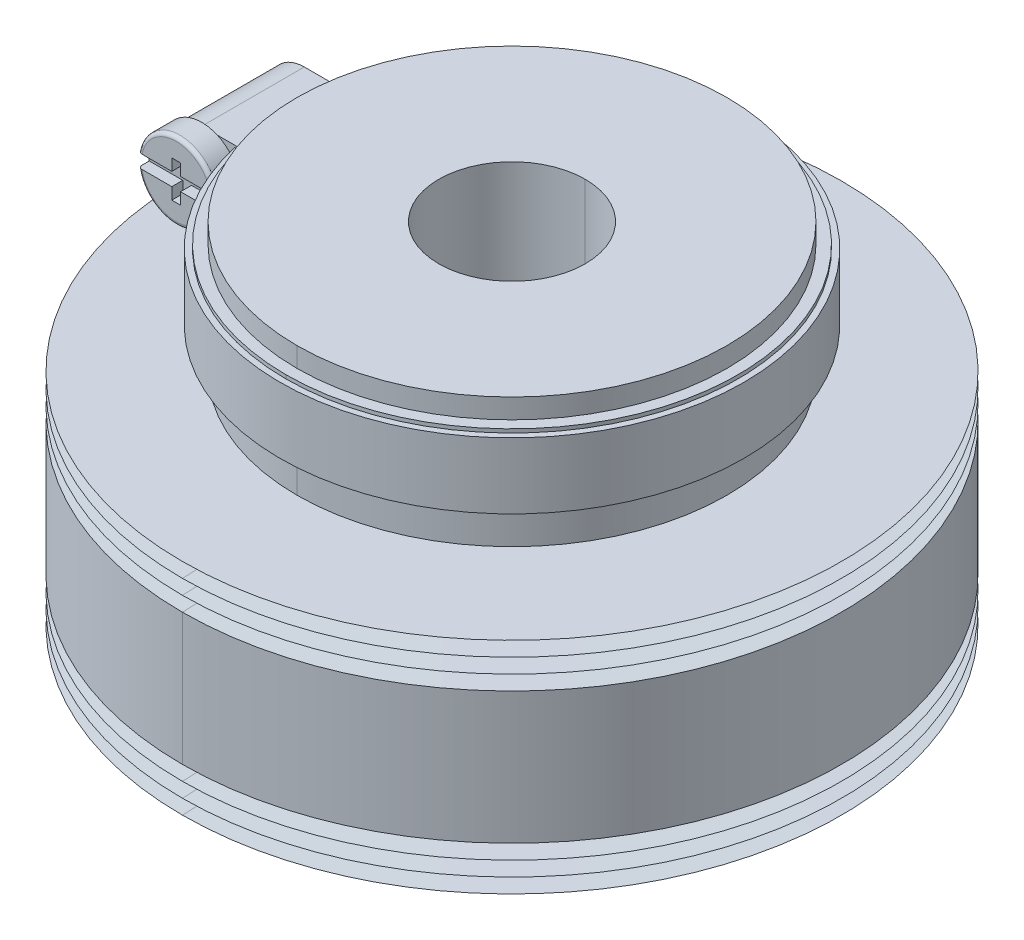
ISO-10303-21;
HEADER;
FILE_DESCRIPTION(('STEP AP214'),'2;1');
FILE_NAME('part.step','',(''),(''),'','','');
FILE_SCHEMA(('AUTOMOTIVE_DESIGN { 1 0 10303 214 1 1 1 1 }'));
ENDSEC;
DATA;
#1=APPLICATION_CONTEXT('core data for automotive mechanical design processes');
#2=APPLICATION_PROTOCOL_DEFINITION('international standard','automotive_design',2000,#1);
#3=PRODUCT_CONTEXT('',#1,'mechanical');
#4=PRODUCT('Part','Part','',(#3));
#5=PRODUCT_RELATED_PRODUCT_CATEGORY('part','',(#4));
#6=PRODUCT_DEFINITION_FORMATION('','',#4);
#7=PRODUCT_DEFINITION_CONTEXT('part definition',#1,'design');
#8=PRODUCT_DEFINITION('design','',#6,#7);
#9=PRODUCT_DEFINITION_SHAPE('','',#8);
#10=(LENGTH_UNIT() NAMED_UNIT(*) SI_UNIT(.MILLI.,.METRE.));
#11=(NAMED_UNIT(*) PLANE_ANGLE_UNIT() SI_UNIT($,.RADIAN.));
#12=(NAMED_UNIT(*) SI_UNIT($,.STERADIAN.) SOLID_ANGLE_UNIT());
#13=UNCERTAINTY_MEASURE_WITH_UNIT(LENGTH_MEASURE(1.E-05),#10,'distance_accuracy_value','');
#14=(GEOMETRIC_REPRESENTATION_CONTEXT(3) GLOBAL_UNCERTAINTY_ASSIGNED_CONTEXT((#13)) GLOBAL_UNIT_ASSIGNED_CONTEXT((#10,
#11,#12)) REPRESENTATION_CONTEXT('',''));
#15=CARTESIAN_POINT('',(0.,0.,0.));
#16=DIRECTION('',(0.,0.,1.));
#17=DIRECTION('',(1.,0.,0.));
#18=AXIS2_PLACEMENT_3D('',#15,#16,#17);
#19=CARTESIAN_POINT('',(-35.357,52.,10.5));
#20=DIRECTION('',(0.,0.,-1.));
#21=DIRECTION('',(0.,-1.,0.));
#22=AXIS2_PLACEMENT_3D('',#19,#20,#21);
#23=PLANE('',#22);
#24=DIRECTION('',(-1.,0.,0.));
#25=VECTOR('',#24,1.);
#26=CARTESIAN_POINT('',(-35.957,51.1,10.5));
#27=LINE('',#26,#25);
#28=CARTESIAN_POINT('',(-35.957,51.1,10.5));
#29=VERTEX_POINT('',#28);
#30=CARTESIAN_POINT('',(-40.02095754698,51.1,10.5));
#31=VERTEX_POINT('',#30);
#32=EDGE_CURVE('E10',#29,#31,#27,.T.);
#33=ORIENTED_EDGE('',*,*,#32,.T.);
#34=CARTESIAN_POINT('',(-35.357,52.,10.5));
#35=DIRECTION('',(0.,0.,1.));
#36=DIRECTION('',(-0.9818857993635,-0.1894736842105,0.));
#37=AXIS2_PLACEMENT_3D('',#34,#35,#36);
#38=CIRCLE('',#37,4.75);
#39=CARTESIAN_POINT('',(-30.69304245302,51.1,10.5));
#40=VERTEX_POINT('',#39);
#41=EDGE_CURVE('E28',#31,#40,#38,.T.);
#42=ORIENTED_EDGE('',*,*,#41,.T.);
#43=DIRECTION('',(-1.,0.,0.));
#44=VECTOR('',#43,1.);
#45=CARTESIAN_POINT('',(-30.69304245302,51.1,10.5));
#46=LINE('',#45,#44);
#47=CARTESIAN_POINT('',(-34.757,51.1,10.5));
#48=VERTEX_POINT('',#47);
#49=EDGE_CURVE('E1410',#40,#48,#46,.T.);
#50=ORIENTED_EDGE('',*,*,#49,.T.);
#51=DIRECTION('',(0.,-1.,0.));
#52=VECTOR('',#51,1.);
#53=CARTESIAN_POINT('',(-34.757,51.1,10.5));
#54=LINE('',#53,#52);
#55=CARTESIAN_POINT('',(-34.757,49.5,10.5));
#56=VERTEX_POINT('',#55);
#57=EDGE_CURVE('E1414',#48,#56,#54,.T.);
#58=ORIENTED_EDGE('',*,*,#57,.T.);
#59=DIRECTION('',(-1.,0.,0.));
#60=VECTOR('',#59,1.);
#61=CARTESIAN_POINT('',(-34.757,49.5,10.5));
#62=LINE('',#61,#60);
#63=CARTESIAN_POINT('',(-35.957,49.5,10.5));
#64=VERTEX_POINT('',#63);
#65=EDGE_CURVE('E1543',#56,#64,#62,.T.);
#66=ORIENTED_EDGE('',*,*,#65,.T.);
#67=DIRECTION('',(0.,1.,0.));
#68=VECTOR('',#67,1.);
#69=CARTESIAN_POINT('',(-35.957,49.5,10.5));
#70=LINE('',#69,#68);
#71=EDGE_CURVE('E1427',#64,#29,#70,.T.);
#72=ORIENTED_EDGE('',*,*,#71,.T.);
#73=EDGE_LOOP('',(#33,#42,#50,#58,#66,#72));
#74=FACE_BOUND('',#73,.T.);
#75=ADVANCED_FACE('F15',(#74),#23,.F.);
#76=CARTESIAN_POINT('',(-35.957,51.1,9.));
#77=DIRECTION('',(-1.,0.,0.));
#78=DIRECTION('',(0.,0.,1.));
#79=AXIS2_PLACEMENT_3D('',#76,#77,#78);
#80=PLANE('',#79);
#81=DIRECTION('',(0.,0.,-1.));
#82=VECTOR('',#81,1.);
#83=CARTESIAN_POINT('',(-35.957,49.5,10.5));
#84=LINE('',#83,#82);
#85=CARTESIAN_POINT('',(-35.957,49.5,9.));
#86=VERTEX_POINT('',#85);
#87=EDGE_CURVE('E1536',#64,#86,#84,.T.);
#88=ORIENTED_EDGE('',*,*,#87,.T.);
#89=DIRECTION('',(0.,1.,0.));
#90=VECTOR('',#89,1.);
#91=CARTESIAN_POINT('',(-35.957,49.5,9.));
#92=LINE('',#91,#90);
#93=CARTESIAN_POINT('',(-35.957,51.1,9.));
#94=VERTEX_POINT('',#93);
#95=EDGE_CURVE('E851',#86,#94,#92,.T.);
#96=ORIENTED_EDGE('',*,*,#95,.T.);
#97=DIRECTION('',(0.,0.,-1.));
#98=VECTOR('',#97,1.);
#99=CARTESIAN_POINT('',(-35.957,51.1,10.5));
#100=LINE('',#99,#98);
#101=EDGE_CURVE('E848',#29,#94,#100,.T.);
#102=ORIENTED_EDGE('',*,*,#101,.F.);
#103=ORIENTED_EDGE('',*,*,#71,.F.);
#104=EDGE_LOOP('',(#88,#96,#102,#103));
#105=FACE_BOUND('',#104,.T.);
#106=ADVANCED_FACE('F1245',(#105),#80,.F.);
#107=CARTESIAN_POINT('',(-40.52928189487,51.1,9.));
#108=DIRECTION('',(0.,-1.,0.));
#109=DIRECTION('',(0.,0.,-1.));
#110=AXIS2_PLACEMENT_3D('',#107,#108,#109);
#111=PLANE('',#110);
#112=ORIENTED_EDGE('',*,*,#32,.F.);
#113=ORIENTED_EDGE('',*,*,#101,.T.);
#114=DIRECTION('',(-1.,0.,0.));
#115=VECTOR('',#114,1.);
#116=CARTESIAN_POINT('',(-35.957,51.1,9.));
#117=LINE('',#116,#115);
#118=CARTESIAN_POINT('',(-40.52928189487,51.1,9.));
#119=VERTEX_POINT('',#118);
#120=EDGE_CURVE('E852',#94,#119,#117,.T.);
#121=ORIENTED_EDGE('',*,*,#120,.T.);
#122=DIRECTION('',(0.,0.,-1.));
#123=VECTOR('',#122,1.);
#124=CARTESIAN_POINT('',(-40.52928189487,51.1,10.));
#125=LINE('',#124,#123);
#126=CARTESIAN_POINT('',(-40.52928189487,51.1,10.));
#127=VERTEX_POINT('',#126);
#128=EDGE_CURVE('E1407',#127,#119,#125,.T.);
#129=ORIENTED_EDGE('',*,*,#128,.F.);
#130=CARTESIAN_POINT('',(-40.02095754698,51.1,10.5));
#131=CARTESIAN_POINT('',(-40.03059952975,51.1,10.5));
#132=CARTESIAN_POINT('',(-40.04984429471,51.1,10.49946330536));
#133=CARTESIAN_POINT('',(-40.07864267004,51.1,10.49705038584));
#134=CARTESIAN_POINT('',(-40.10722578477,51.1,10.4930399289));
#135=CARTESIAN_POINT('',(-40.13550127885,51.1,10.48744976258));
#136=CARTESIAN_POINT('',(-40.16335560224,51.1,10.48030890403));
#137=CARTESIAN_POINT('',(-40.19072030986,51.1,10.47164188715));
#138=CARTESIAN_POINT('',(-40.21748463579,51.1,10.46149164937));
#139=CARTESIAN_POINT('',(-40.24359241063,51.1,10.44988831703));
#140=CARTESIAN_POINT('',(-40.26897301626,51.1,10.43686747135));
#141=CARTESIAN_POINT('',(-40.29354827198,51.1,10.42247305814));
#142=CARTESIAN_POINT('',(-40.3172423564,51.1,10.40675354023));
#143=CARTESIAN_POINT('',(-40.3399843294,51.1,10.38976004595));
#144=CARTESIAN_POINT('',(-40.36170599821,51.1,10.37154730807));
#145=CARTESIAN_POINT('',(-40.38234080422,51.1,10.35217498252));
#146=CARTESIAN_POINT('',(-40.40182589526,51.1,10.33170624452));
#147=CARTESIAN_POINT('',(-40.42010166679,51.1,10.31020833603));
#148=CARTESIAN_POINT('',(-40.43711267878,51.1,10.28775170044));
#149=CARTESIAN_POINT('',(-40.45280617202,51.1,10.2644123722));
#150=CARTESIAN_POINT('',(-40.46713478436,51.1,10.24026914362));
#151=CARTESIAN_POINT('',(-40.48005826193,51.1,10.2153996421));
#152=CARTESIAN_POINT('',(-40.49154067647,51.1,10.18988324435));
#153=CARTESIAN_POINT('',(-40.50154661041,51.1,10.1638124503));
#154=CARTESIAN_POINT('',(-40.5100489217,51.1,10.1372801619));
#155=CARTESIAN_POINT('',(-40.51703473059,51.1,10.11035145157));
#156=CARTESIAN_POINT('',(-40.52249296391,51.1,10.08307248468));
#157=CARTESIAN_POINT('',(-40.52640318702,51.1,10.05554929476));
#158=CARTESIAN_POINT('',(-40.52875748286,51.1,10.02782438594));
#159=CARTESIAN_POINT('',(-40.52928189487,51.1,10.00928815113));
#160=CARTESIAN_POINT('',(-40.52928189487,51.1,10.));
#161=(BOUNDED_CURVE() B_SPLINE_CURVE(3,(#130,#131,#132,#133,#134,#135,#136,#137,#138,#139,#140,
#141,#142,#143,#144,#145,#146,#147,#148,#149,#150,#151,#152,#153,#154,#155,#156,#157,#158,#159,
#160),.UNSPECIFIED.,.F.,.F.) B_SPLINE_CURVE_WITH_KNOTS((4,1,1,1,1,1,1,1,1,1,1,1,1,1,1,1,1,1,1,1,
1,1,1,1,1,1,1,1,4),(0.,0.03571428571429,0.07142857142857,0.1071428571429,0.1428571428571,
0.1785714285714,0.2142857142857,0.25,0.2857142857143,0.3214285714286,0.3571428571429,
0.3928571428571,0.4285714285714,0.4642857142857,0.5,0.5357142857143,0.5714285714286,
0.6071428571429,0.6428571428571,0.6785714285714,0.7142857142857,0.75,0.7857142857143,
0.8214285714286,0.8571428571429,0.8928571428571,0.9285714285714,0.9642857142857,1.),
.UNSPECIFIED.) CURVE() GEOMETRIC_REPRESENTATION_ITEM() RATIONAL_B_SPLINE_CURVE((1.,1.,1.,1.,1.,
1.,1.,1.,1.,1.,1.,1.,1.,1.,1.,1.,1.,1.,1.,1.,1.,1.,1.,1.,1.,1.,1.,1.,1.,1.,1.)) REPRESENTATION_ITEM(''));
#162=EDGE_CURVE('E1429',#31,#127,#161,.T.);
#163=ORIENTED_EDGE('',*,*,#162,.F.);
#164=EDGE_LOOP('',(#112,#113,#121,#129,#163));
#165=FACE_BOUND('',#164,.T.);
#166=ADVANCED_FACE('F897',(#165),#111,.F.);
#167=CARTESIAN_POINT('',(-35.357,52.,10.));
#168=DIRECTION('',(0.,0.,-1.));
#169=DIRECTION('',(-1.,0.,0.));
#170=AXIS2_PLACEMENT_3D('',#167,#168,#169);
#171=TOROIDAL_SURFACE('',#170,4.75,0.5);
#172=CARTESIAN_POINT('',(-35.357,52.,10.));
#173=DIRECTION('',(0.,0.,1.));
#174=DIRECTION('',(-0.985196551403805,-0.171428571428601,0.));
#175=AXIS2_PLACEMENT_3D('',#172,#173,#174);
#176=CIRCLE('',#175,5.25);
#177=CARTESIAN_POINT('',(-30.18471810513,51.1,10.));
#178=VERTEX_POINT('',#177);
#179=EDGE_CURVE('E1393',#127,#178,#176,.T.);
#180=ORIENTED_EDGE('',*,*,#179,.T.);
#181=CARTESIAN_POINT('',(-30.18471810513,51.1,10.));
#182=CARTESIAN_POINT('',(-30.1847179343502,51.0999999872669,10.0079204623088));
#183=CARTESIAN_POINT('',(-30.1849093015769,51.0999989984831,10.0158409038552));
#184=CARTESIAN_POINT('',(-30.1856750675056,51.0999956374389,10.0316901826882));
#185=CARTESIAN_POINT('',(-30.1862507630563,51.0999932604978,10.0396189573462));
#186=CARTESIAN_POINT('',(-30.187787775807,51.0999876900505,10.0554666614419));
#187=CARTESIAN_POINT('',(-30.1887504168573,51.0999844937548,10.0633854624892));
#188=CARTESIAN_POINT('',(-30.1910627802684,51.0999777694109,10.0791947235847));
#189=CARTESIAN_POINT('',(-30.1924138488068,51.0999742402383,10.0870849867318));
#190=CARTESIAN_POINT('',(-30.1955036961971,51.0999672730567,10.102818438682));
#191=CARTESIAN_POINT('',(-30.1972438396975,51.0999638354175,10.1106613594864));
#192=CARTESIAN_POINT('',(-30.2011115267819,51.0999574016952,10.1262812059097));
#193=CARTESIAN_POINT('',(-30.2032404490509,51.0999544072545,10.1340577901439));
#194=CARTESIAN_POINT('',(-30.2078844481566,51.0999491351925,10.1495258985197));
#195=CARTESIAN_POINT('',(-30.2104009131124,51.0999468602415,10.1572170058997));
#196=CARTESIAN_POINT('',(-30.2158177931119,51.0999432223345,10.1724949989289));
#197=CARTESIAN_POINT('',(-30.2187196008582,51.0999418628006,10.18008139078));
#198=CARTESIAN_POINT('',(-30.2249039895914,51.0999401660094,10.1951307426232));
#199=CARTESIAN_POINT('',(-30.2281879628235,51.0999398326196,10.2025931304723));
#200=CARTESIAN_POINT('',(-30.2351325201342,51.0999402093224,10.2173752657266));
#201=CARTESIAN_POINT('',(-30.2387944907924,51.0999409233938,10.2246943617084));
#202=CARTESIAN_POINT('',(-30.2464898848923,51.0999433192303,10.2391707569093));
#203=CARTESIAN_POINT('',(-30.2505246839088,51.0999450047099,10.2463273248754));
#204=CARTESIAN_POINT('',(-30.2589595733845,51.0999491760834,10.2604596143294));
#205=CARTESIAN_POINT('',(-30.2633610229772,51.0999516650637,10.2674345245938));
#206=CARTESIAN_POINT('',(-30.2725220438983,51.0999571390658,10.2811846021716));
#207=CARTESIAN_POINT('',(-30.2772829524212,51.0999601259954,10.2879588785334));
#208=CARTESIAN_POINT('',(-30.2871547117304,51.099966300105,10.3012890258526));
#209=CARTESIAN_POINT('',(-30.292266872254,51.0999694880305,10.3078439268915));
#210=CARTESIAN_POINT('',(-30.3028319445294,51.0999752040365,10.3207168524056));
#211=CARTESIAN_POINT('',(-30.3082861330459,51.0999777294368,10.3270338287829));
#212=CARTESIAN_POINT('',(-30.3195250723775,51.0999828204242,10.3394130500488));
#213=CARTESIAN_POINT('',(-30.32531106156,51.0999853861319,10.3454741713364));
#214=CARTESIAN_POINT('',(-30.3362413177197,51.0999848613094,10.3563654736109));
#215=CARTESIAN_POINT('',(-30.3413426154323,51.0999826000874,10.3612388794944));
#216=CARTESIAN_POINT('',(-30.3518738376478,51.0999723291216,10.3708844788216));
#217=CARTESIAN_POINT('',(-30.3573087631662,51.0999641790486,10.3756512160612));
#218=CARTESIAN_POINT('',(-30.3685114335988,51.099945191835,10.3850589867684));
#219=CARTESIAN_POINT('',(-30.3742840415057,51.0999342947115,10.3896942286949));
#220=CARTESIAN_POINT('',(-30.3861650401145,51.0999112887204,10.3988133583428));
#221=CARTESIAN_POINT('',(-30.3922781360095,51.0998991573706,10.4032911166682));
#222=CARTESIAN_POINT('',(-30.4048414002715,51.0998753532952,10.4120685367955));
#223=CARTESIAN_POINT('',(-30.4112960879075,51.0998636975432,10.4163617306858));
#224=CARTESIAN_POINT('',(-30.4245420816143,51.0998421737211,10.4247422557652));
#225=CARTESIAN_POINT('',(-30.4313376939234,51.099832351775,10.4288227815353));
#226=CARTESIAN_POINT('',(-30.4452631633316,51.0998155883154,10.4367492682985));
#227=CARTESIAN_POINT('',(-30.4523970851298,51.0998087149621,10.4405880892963));
#228=CARTESIAN_POINT('',(-30.4669947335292,51.0997986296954,10.4480016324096));
#229=CARTESIAN_POINT('',(-30.474462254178,51.0997954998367,10.4515688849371));
#230=CARTESIAN_POINT('',(-30.4897204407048,51.0997933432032,10.4584090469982));
#231=CARTESIAN_POINT('',(-30.4975146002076,51.099794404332,10.4616741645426));
#232=CARTESIAN_POINT('',(-30.5134170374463,51.0998006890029,10.4678792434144));
#233=CARTESIAN_POINT('',(-30.5215284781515,51.0998059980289,10.4708110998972));
#234=CARTESIAN_POINT('',(-30.5380539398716,51.0998204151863,10.4763184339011));
#235=CARTESIAN_POINT('',(-30.5464707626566,51.0998295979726,10.4788855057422));
#236=CARTESIAN_POINT('',(-30.5635928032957,51.0998509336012,10.4836318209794));
#237=CARTESIAN_POINT('',(-30.5723004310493,51.0998631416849,10.4858023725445));
#238=CARTESIAN_POINT('',(-30.5899871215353,51.0998891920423,10.4897241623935));
#239=CARTESIAN_POINT('',(-30.5989681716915,51.0999030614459,10.4914664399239));
#240=CARTESIAN_POINT('',(-30.6171818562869,51.0999305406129,10.4945004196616));
#241=CARTESIAN_POINT('',(-30.6264160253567,51.0999441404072,10.4957829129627));
#242=CARTESIAN_POINT('',(-30.6451131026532,51.0999686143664,10.497866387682));
#243=CARTESIAN_POINT('',(-30.6545770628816,51.0999794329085,10.4986579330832));
#244=CARTESIAN_POINT('',(-30.6737078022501,51.0999951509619,10.499729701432));
#245=CARTESIAN_POINT('',(-30.6833751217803,51.0999999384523,10.5000002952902));
#246=CARTESIAN_POINT('',(-30.69304245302,51.1,10.5));
#247=B_SPLINE_CURVE_WITH_KNOTS('',3,(#181,#182,#183,#184,#185,#186,#187,#188,#189,#190,#191,
#192,#193,#194,#195,#196,#197,#198,#199,#200,#201,#202,#203,#204,#205,#206,#207,#208,#209,#210,
#211,#212,#213,#214,#215,#216,#217,#218,#219,#220,#221,#222,#223,#224,#225,#226,#227,#228,#229,
#230,#231,#232,#233,#234,#235,#236,#237,#238,#239,#240,#241,#242,#243,#244,#245,#246),
.UNSPECIFIED.,.F.,.F.,(4,2,2,2,2,2,2,2,2,2,2,2,2,2,2,2,2,2,2,2,2,2,2,2,2,2,2,2,2,2,2,2,4),(0.,
0.0237590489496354,0.0475986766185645,0.0715205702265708,0.0955263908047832,0.119617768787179,
0.143796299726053,0.168063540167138,0.192421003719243,0.216870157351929,0.241412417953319,
0.266049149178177,0.29078165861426,0.315611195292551,0.340538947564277,0.365566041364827,
0.390693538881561,0.411852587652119,0.433533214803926,0.455735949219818,0.478461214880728,
0.501709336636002,0.5254805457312,0.549774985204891,0.574592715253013,0.599933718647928,
0.625797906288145,0.652185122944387,0.679095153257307,0.706527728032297,0.734482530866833,
0.762959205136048,0.791957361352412),.UNSPECIFIED.);
#248=EDGE_CURVE('E880',#178,#40,#247,.T.);
#249=ORIENTED_EDGE('',*,*,#248,.T.);
#250=ORIENTED_EDGE('',*,*,#41,.F.);
#251=ORIENTED_EDGE('',*,*,#162,.T.);
#252=EDGE_LOOP('',(#180,#249,#250,#251));
#253=FACE_BOUND('',#252,.T.);
#254=ADVANCED_FACE('F886',(#253),#171,.T.);
#255=CARTESIAN_POINT('',(-34.757,51.1,9.));
#256=DIRECTION('',(0.,-1.,0.));
#257=DIRECTION('',(0.,0.,-1.));
#258=AXIS2_PLACEMENT_3D('',#255,#256,#257);
#259=PLANE('',#258);
#260=DIRECTION('',(0.,0.,1.));
#261=VECTOR('',#260,1.);
#262=CARTESIAN_POINT('',(-30.18471810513,51.1,9.518681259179));
#263=LINE('',#262,#261);
#264=CARTESIAN_POINT('',(-30.18471810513,51.1,9.518681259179));
#265=VERTEX_POINT('',#264);
#266=EDGE_CURVE('E1403',#265,#178,#263,.T.);
#267=ORIENTED_EDGE('',*,*,#266,.F.);
#268=DIRECTION('',(0.,0.,1.));
#269=VECTOR('',#268,1.);
#270=CARTESIAN_POINT('',(-30.18471810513,51.1,9.));
#271=LINE('',#270,#269);
#272=CARTESIAN_POINT('',(-30.18471810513,51.1,9.));
#273=VERTEX_POINT('',#272);
#274=EDGE_CURVE('E1013',#273,#265,#271,.T.);
#275=ORIENTED_EDGE('',*,*,#274,.F.);
#276=DIRECTION('',(-1.,0.,0.));
#277=VECTOR('',#276,1.);
#278=CARTESIAN_POINT('',(-30.18471810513,51.1,9.));
#279=LINE('',#278,#277);
#280=CARTESIAN_POINT('',(-34.757,51.1,9.));
#281=VERTEX_POINT('',#280);
#282=EDGE_CURVE('E1433',#273,#281,#279,.T.);
#283=ORIENTED_EDGE('',*,*,#282,.T.);
#284=DIRECTION('',(0.,0.,-1.));
#285=VECTOR('',#284,1.);
#286=CARTESIAN_POINT('',(-34.757,51.1,10.5));
#287=LINE('',#286,#285);
#288=EDGE_CURVE('E1441',#48,#281,#287,.T.);
#289=ORIENTED_EDGE('',*,*,#288,.F.);
#290=ORIENTED_EDGE('',*,*,#49,.F.);
#291=ORIENTED_EDGE('',*,*,#248,.F.);
#292=EDGE_LOOP('',(#267,#275,#283,#289,#290,#291));
#293=FACE_BOUND('',#292,.T.);
#294=ADVANCED_FACE('F896',(#293),#259,.F.);
#295=CARTESIAN_POINT('',(-34.757,49.5,9.));
#296=DIRECTION('',(1.,0.,0.));
#297=DIRECTION('',(0.,1.,0.));
#298=AXIS2_PLACEMENT_3D('',#295,#296,#297);
#299=PLANE('',#298);
#300=ORIENTED_EDGE('',*,*,#288,.T.);
#301=DIRECTION('',(0.,-1.,0.));
#302=VECTOR('',#301,1.);
#303=CARTESIAN_POINT('',(-34.757,51.1,9.));
#304=LINE('',#303,#302);
#305=CARTESIAN_POINT('',(-34.757,49.5,9.));
#306=VERTEX_POINT('',#305);
#307=EDGE_CURVE('E1572',#281,#306,#304,.T.);
#308=ORIENTED_EDGE('',*,*,#307,.T.);
#309=DIRECTION('',(0.,0.,-1.));
#310=VECTOR('',#309,1.);
#311=CARTESIAN_POINT('',(-34.757,49.5,10.5));
#312=LINE('',#311,#310);
#313=EDGE_CURVE('E1575',#56,#306,#312,.T.);
#314=ORIENTED_EDGE('',*,*,#313,.F.);
#315=ORIENTED_EDGE('',*,*,#57,.F.);
#316=EDGE_LOOP('',(#300,#308,#314,#315));
#317=FACE_BOUND('',#316,.T.);
#318=ADVANCED_FACE('F1267',(#317),#299,.F.);
#319=CARTESIAN_POINT('',(-35.957,49.5,9.));
#320=DIRECTION('',(0.,-1.,0.));
#321=DIRECTION('',(0.,0.,-1.));
#322=AXIS2_PLACEMENT_3D('',#319,#320,#321);
#323=PLANE('',#322);
#324=ORIENTED_EDGE('',*,*,#313,.T.);
#325=DIRECTION('',(-1.,0.,0.));
#326=VECTOR('',#325,1.);
#327=CARTESIAN_POINT('',(-34.757,49.5,9.));
#328=LINE('',#327,#326);
#329=EDGE_CURVE('E1924',#306,#86,#328,.T.);
#330=ORIENTED_EDGE('',*,*,#329,.T.);
#331=ORIENTED_EDGE('',*,*,#87,.F.);
#332=ORIENTED_EDGE('',*,*,#65,.F.);
#333=EDGE_LOOP('',(#324,#330,#331,#332));
#334=FACE_BOUND('',#333,.T.);
#335=ADVANCED_FACE('F1264',(#334),#323,.F.);
#336=CARTESIAN_POINT('',(-35.357,52.,9.));
#337=DIRECTION('',(0.,0.,1.));
#338=DIRECTION('',(1.,0.,0.));
#339=AXIS2_PLACEMENT_3D('',#336,#337,#338);
#340=PLANE('',#339);
#341=CARTESIAN_POINT('',(-35.357,52.,9.));
#342=DIRECTION('',(0.,0.,1.));
#343=DIRECTION('',(-0.985196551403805,0.171428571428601,0.));
#344=AXIS2_PLACEMENT_3D('',#341,#342,#343);
#345=CIRCLE('',#344,5.25);
#346=CARTESIAN_POINT('',(-40.52928189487,52.9,9.));
#347=VERTEX_POINT('',#346);
#348=CARTESIAN_POINT('',(-40.607,52.,9.));
#349=VERTEX_POINT('',#348);
#350=EDGE_CURVE('E1661',#347,#349,#345,.T.);
#351=ORIENTED_EDGE('',*,*,#350,.T.);
#352=CARTESIAN_POINT('',(-35.357,52.,9.));
#353=DIRECTION('',(0.,0.,1.));
#354=DIRECTION('',(-1.,0.,0.));
#355=AXIS2_PLACEMENT_3D('',#352,#353,#354);
#356=CIRCLE('',#355,5.25);
#357=EDGE_CURVE('E1505',#349,#119,#356,.T.);
#358=ORIENTED_EDGE('',*,*,#357,.T.);
#359=ORIENTED_EDGE('',*,*,#120,.F.);
#360=ORIENTED_EDGE('',*,*,#95,.F.);
#361=ORIENTED_EDGE('',*,*,#329,.F.);
#362=ORIENTED_EDGE('',*,*,#307,.F.);
#363=ORIENTED_EDGE('',*,*,#282,.F.);
#364=CARTESIAN_POINT('',(-35.357,52.,9.));
#365=DIRECTION('',(0.,0.,1.));
#366=DIRECTION('',(0.985196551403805,-0.171428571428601,0.));
#367=AXIS2_PLACEMENT_3D('',#364,#365,#366);
#368=CIRCLE('',#367,5.25);
#369=CARTESIAN_POINT('',(-30.18471810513,52.9,9.));
#370=VERTEX_POINT('',#369);
#371=EDGE_CURVE('E1501',#273,#370,#368,.T.);
#372=ORIENTED_EDGE('',*,*,#371,.T.);
#373=DIRECTION('',(1.,0.,0.));
#374=VECTOR('',#373,1.);
#375=CARTESIAN_POINT('',(-34.757,52.9,9.));
#376=LINE('',#375,#374);
#377=CARTESIAN_POINT('',(-34.757,52.9,9.));
#378=VERTEX_POINT('',#377);
#379=EDGE_CURVE('E761',#378,#370,#376,.T.);
#380=ORIENTED_EDGE('',*,*,#379,.F.);
#381=DIRECTION('',(0.,-1.,0.));
#382=VECTOR('',#381,1.);
#383=CARTESIAN_POINT('',(-34.757,54.5,9.));
#384=LINE('',#383,#382);
#385=CARTESIAN_POINT('',(-34.757,54.5,9.));
#386=VERTEX_POINT('',#385);
#387=EDGE_CURVE('E1727',#386,#378,#384,.T.);
#388=ORIENTED_EDGE('',*,*,#387,.F.);
#389=DIRECTION('',(1.,0.,0.));
#390=VECTOR('',#389,1.);
#391=CARTESIAN_POINT('',(-35.957,54.5,9.));
#392=LINE('',#391,#390);
#393=CARTESIAN_POINT('',(-35.957,54.5,9.));
#394=VERTEX_POINT('',#393);
#395=EDGE_CURVE('E828',#394,#386,#392,.T.);
#396=ORIENTED_EDGE('',*,*,#395,.F.);
#397=DIRECTION('',(0.,1.,0.));
#398=VECTOR('',#397,1.);
#399=CARTESIAN_POINT('',(-35.957,52.9,9.));
#400=LINE('',#399,#398);
#401=CARTESIAN_POINT('',(-35.957,52.9,9.));
#402=VERTEX_POINT('',#401);
#403=EDGE_CURVE('E779',#402,#394,#400,.T.);
#404=ORIENTED_EDGE('',*,*,#403,.F.);
#405=DIRECTION('',(1.,0.,0.));
#406=VECTOR('',#405,1.);
#407=CARTESIAN_POINT('',(-40.52928189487,52.9,9.));
#408=LINE('',#407,#406);
#409=EDGE_CURVE('E1506',#347,#402,#408,.T.);
#410=ORIENTED_EDGE('',*,*,#409,.F.);
#411=EDGE_LOOP('',(#351,#358,#359,#360,#361,#362,#363,#372,#380,#388,#396,#404,#410));
#412=FACE_BOUND('',#411,.T.);
#413=ADVANCED_FACE('F942',(#412),#340,.T.);
#414=CARTESIAN_POINT('',(-35.957,52.9,9.));
#415=DIRECTION('',(0.,1.,0.));
#416=DIRECTION('',(1.,0.,0.));
#417=AXIS2_PLACEMENT_3D('',#414,#415,#416);
#418=PLANE('',#417);
#419=DIRECTION('',(0.,0.,1.));
#420=VECTOR('',#419,1.);
#421=CARTESIAN_POINT('',(-40.52928189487,52.9,9.));
#422=LINE('',#421,#420);
#423=CARTESIAN_POINT('',(-40.52928189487,52.9,10.));
#424=VERTEX_POINT('',#423);
#425=EDGE_CURVE('E931',#347,#424,#422,.T.);
#426=ORIENTED_EDGE('',*,*,#425,.F.);
#427=ORIENTED_EDGE('',*,*,#409,.T.);
#428=DIRECTION('',(0.,0.,-1.));
#429=VECTOR('',#428,1.);
#430=CARTESIAN_POINT('',(-35.957,52.9,10.5));
#431=LINE('',#430,#429);
#432=CARTESIAN_POINT('',(-35.957,52.9,10.5));
#433=VERTEX_POINT('',#432);
#434=EDGE_CURVE('E782',#433,#402,#431,.T.);
#435=ORIENTED_EDGE('',*,*,#434,.F.);
#436=DIRECTION('',(1.,0.,0.));
#437=VECTOR('',#436,1.);
#438=CARTESIAN_POINT('',(-40.02095754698,52.9,10.5));
#439=LINE('',#438,#437);
#440=CARTESIAN_POINT('',(-40.02095754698,52.9,10.5));
#441=VERTEX_POINT('',#440);
#442=EDGE_CURVE('E1859',#441,#433,#439,.T.);
#443=ORIENTED_EDGE('',*,*,#442,.F.);
#444=CARTESIAN_POINT('',(-40.52928189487,52.9,10.));
#445=CARTESIAN_POINT('',(-40.5292820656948,52.9000000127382,10.0079209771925));
#446=CARTESIAN_POINT('',(-40.529090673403,52.9000010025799,10.0158419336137));
#447=CARTESIAN_POINT('',(-40.5283248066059,52.9000043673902,10.031692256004));
#448=CARTESIAN_POINT('',(-40.5277490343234,52.9000067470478,10.0396215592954));
#449=CARTESIAN_POINT('',(-40.5262118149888,52.9000123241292,10.0554703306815));
#450=CARTESIAN_POINT('',(-40.525249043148,52.9000155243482,10.0633896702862));
#451=CARTESIAN_POINT('',(-40.5229363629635,52.9000222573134,10.0792000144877));
#452=CARTESIAN_POINT('',(-40.5215851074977,52.9000257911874,10.0870908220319));
#453=CARTESIAN_POINT('',(-40.5184948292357,52.9000327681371,10.1028253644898));
#454=CARTESIAN_POINT('',(-40.516754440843,52.900036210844,10.1106688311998));
#455=CARTESIAN_POINT('',(-40.5128862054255,52.9000426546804,10.1262897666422));
#456=CARTESIAN_POINT('',(-40.5107569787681,52.9000456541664,10.1340668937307));
#457=CARTESIAN_POINT('',(-40.5061123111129,52.9000509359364,10.1495360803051));
#458=CARTESIAN_POINT('',(-40.5035954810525,52.9000532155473,10.1572277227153));
#459=CARTESIAN_POINT('',(-40.4981778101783,52.9000568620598,10.1725067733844));
#460=CARTESIAN_POINT('',(-40.4952755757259,52.9000582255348,10.1800936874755));
#461=CARTESIAN_POINT('',(-40.4890902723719,52.9000599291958,10.1951440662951));
#462=CARTESIAN_POINT('',(-40.4858058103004,52.9000602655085,10.2026069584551));
#463=CARTESIAN_POINT('',(-40.4788602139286,52.9000598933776,10.2173900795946));
#464=CARTESIAN_POINT('',(-40.4751976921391,52.9000591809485,10.2247096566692));
#465=CARTESIAN_POINT('',(-40.4675011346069,52.9000567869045,10.2391869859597));
#466=CARTESIAN_POINT('',(-40.463465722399,52.9000551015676,10.2463440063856));
#467=CARTESIAN_POINT('',(-40.4550295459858,52.9000509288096,10.2604771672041));
#468=CARTESIAN_POINT('',(-40.4506274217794,52.9000484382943,10.2674524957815));
#469=CARTESIAN_POINT('',(-40.4414649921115,52.900042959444,10.2812033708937));
#470=CARTESIAN_POINT('',(-40.4367033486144,52.9000399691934,10.2879780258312));
#471=CARTESIAN_POINT('',(-40.4268300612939,52.9000337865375,10.3013088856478));
#472=CARTESIAN_POINT('',(-40.421717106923,52.9000305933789,10.3078641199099));
#473=CARTESIAN_POINT('',(-40.4111503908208,52.9000248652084,10.3207376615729));
#474=CARTESIAN_POINT('',(-40.4056953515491,52.9000223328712,10.3270549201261));
#475=CARTESIAN_POINT('',(-40.3944546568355,52.9000172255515,10.3394346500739));
#476=CARTESIAN_POINT('',(-40.3886677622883,52.9000146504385,10.3454959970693));
#477=CARTESIAN_POINT('',(-40.3777367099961,52.9000151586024,10.3563867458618));
#478=CARTESIAN_POINT('',(-40.3726355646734,52.9000174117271,10.3612594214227));
#479=CARTESIAN_POINT('',(-40.3621046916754,52.9000276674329,10.3709035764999));
#480=CARTESIAN_POINT('',(-40.3566699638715,52.9000358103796,10.3756696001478));
#481=CARTESIAN_POINT('',(-40.3454677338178,52.900054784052,10.3850759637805));
#482=CARTESIAN_POINT('',(-40.339695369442,52.900065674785,10.389710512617));
#483=CARTESIAN_POINT('',(-40.3278149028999,52.9000886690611,10.3988282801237));
#484=CARTESIAN_POINT('',(-40.3217020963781,52.9001007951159,10.4033053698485));
#485=CARTESIAN_POINT('',(-40.3091394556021,52.9001245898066,10.4120814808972));
#486=CARTESIAN_POINT('',(-40.3026851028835,52.900136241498,10.4163740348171));
#487=CARTESIAN_POINT('',(-40.2894398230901,52.9001577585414,10.4247533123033));
#488=CARTESIAN_POINT('',(-40.282644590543,52.9001675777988,10.4288332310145));
#489=CARTESIAN_POINT('',(-40.2687199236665,52.9001843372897,10.4367585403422));
#490=CARTESIAN_POINT('',(-40.2615864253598,52.9001912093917,10.4405967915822));
#491=CARTESIAN_POINT('',(-40.246989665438,52.9002012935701,10.4480092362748));
#492=CARTESIAN_POINT('',(-40.2395226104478,52.9002044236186,10.4515759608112));
#493=CARTESIAN_POINT('',(-40.2242653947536,52.9002065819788,10.458415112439));
#494=CARTESIAN_POINT('',(-40.2164717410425,52.9002055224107,10.4616797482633));
#495=CARTESIAN_POINT('',(-40.2005703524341,52.9001992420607,10.4678839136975));
#496=CARTESIAN_POINT('',(-40.1924594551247,52.9001939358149,10.4708153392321));
#497=CARTESIAN_POINT('',(-40.1759351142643,52.9001795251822,10.4763218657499));
#498=CARTESIAN_POINT('',(-40.1675188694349,52.9001703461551,10.4788885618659));
#499=CARTESIAN_POINT('',(-40.1503980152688,52.9001490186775,10.4836341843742));
#500=CARTESIAN_POINT('',(-40.1416909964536,52.9001368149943,10.4858044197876));
#501=CARTESIAN_POINT('',(-40.1240055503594,52.9001107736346,10.4897256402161));
#502=CARTESIAN_POINT('',(-40.115025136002,52.9000969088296,10.4914676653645));
#503=CARTESIAN_POINT('',(-40.0968127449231,52.9000694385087,10.4945012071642));
#504=CARTESIAN_POINT('',(-40.0875792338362,52.9000558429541,10.4957835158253));
#505=CARTESIAN_POINT('',(-40.0688834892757,52.9000313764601,10.4978666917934));
#506=CARTESIAN_POINT('',(-40.059420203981,52.9000205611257,10.4986581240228));
#507=CARTESIAN_POINT('',(-40.0402908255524,52.9000048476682,10.499729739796));
#508=CARTESIAN_POINT('',(-40.0306241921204,52.9000000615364,10.5000002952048));
#509=CARTESIAN_POINT('',(-40.02095754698,52.9,10.5));
#510=B_SPLINE_CURVE_WITH_KNOTS('',3,(#444,#445,#446,#447,#448,#449,#450,#451,#452,#453,#454,
#455,#456,#457,#458,#459,#460,#461,#462,#463,#464,#465,#466,#467,#468,#469,#470,#471,#472,#473,
#474,#475,#476,#477,#478,#479,#480,#481,#482,#483,#484,#485,#486,#487,#488,#489,#490,#491,#492,
#493,#494,#495,#496,#497,#498,#499,#500,#501,#502,#503,#504,#505,#506,#507,#508,#509),
.UNSPECIFIED.,.F.,.F.,(4,2,2,2,2,2,2,2,2,2,2,2,2,2,2,2,2,2,2,2,2,2,2,2,2,2,2,2,2,2,2,2,4),(0.,
0.0237605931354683,0.0476018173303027,0.0715253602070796,0.0955328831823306,0.119626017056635,
0.143806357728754,0.168075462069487,0.192434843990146,0.216885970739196,0.241430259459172,
0.266069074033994,0.290803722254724,0.315635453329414,0.340565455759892,0.365594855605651,
0.390724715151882,0.411881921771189,0.433560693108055,0.455761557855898,0.478484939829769,
0.501731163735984,0.525500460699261,0.549792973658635,0.574608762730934,0.59994781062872,
0.625810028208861,0.652195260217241,0.67910329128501,0.706533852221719,0.73448662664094,
0.762961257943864,0.791957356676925),.UNSPECIFIED.);
#511=EDGE_CURVE('E925',#424,#441,#510,.T.);
#512=ORIENTED_EDGE('',*,*,#511,.F.);
#513=EDGE_LOOP('',(#426,#427,#435,#443,#512));
#514=FACE_BOUND('',#513,.T.);
#515=ADVANCED_FACE('F905',(#514),#418,.F.);
#516=CARTESIAN_POINT('',(-35.357,52.,10.));
#517=DIRECTION('',(0.,0.,-1.));
#518=DIRECTION('',(-1.,0.,0.));
#519=AXIS2_PLACEMENT_3D('',#516,#517,#518);
#520=TOROIDAL_SURFACE('',#519,4.75,0.5);
#521=CARTESIAN_POINT('',(-35.357,52.,10.));
#522=DIRECTION('',(0.,0.,1.));
#523=DIRECTION('',(0.985196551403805,0.171428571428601,0.));
#524=AXIS2_PLACEMENT_3D('',#521,#522,#523);
#525=CIRCLE('',#524,5.25);
#526=CARTESIAN_POINT('',(-30.18471810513,52.9,10.));
#527=VERTEX_POINT('',#526);
#528=EDGE_CURVE('E1828',#527,#424,#525,.T.);
#529=ORIENTED_EDGE('',*,*,#528,.T.);
#530=ORIENTED_EDGE('',*,*,#511,.T.);
#531=CARTESIAN_POINT('',(-35.357,52.,10.5));
#532=DIRECTION('',(0.,0.,1.));
#533=DIRECTION('',(0.9818857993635,0.1894736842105,0.));
#534=AXIS2_PLACEMENT_3D('',#531,#532,#533);
#535=CIRCLE('',#534,4.75);
#536=CARTESIAN_POINT('',(-30.69304245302,52.9,10.5));
#537=VERTEX_POINT('',#536);
#538=EDGE_CURVE('E827',#537,#441,#535,.T.);
#539=ORIENTED_EDGE('',*,*,#538,.F.);
#540=CARTESIAN_POINT('',(-30.69304245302,52.9,10.5));
#541=CARTESIAN_POINT('',(-30.68340077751,52.9,10.5));
#542=CARTESIAN_POINT('',(-30.66415653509,52.9,10.49946334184));
#543=CARTESIAN_POINT('',(-30.63535850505,52.9,10.49705051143));
#544=CARTESIAN_POINT('',(-30.60677578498,52.9,10.4930401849));
#545=CARTESIAN_POINT('',(-30.57850092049,52.9,10.48745024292));
#546=CARTESIAN_POINT('',(-30.55064784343,52.9,10.48030985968));
#547=CARTESIAN_POINT('',(-30.52328479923,52.9,10.47164362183));
#548=CARTESIAN_POINT('',(-30.49652252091,52.9,10.46149454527));
#549=CARTESIAN_POINT('',(-30.47041661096,52.9,10.44989259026));
#550=CARTESIAN_POINT('',(-30.44503718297,52.9,10.43687304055));
#551=CARTESIAN_POINT('',(-30.42046244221,52.9,10.42247972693));
#552=CARTESIAN_POINT('',(-30.39676827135,52.9,10.40676102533));
#553=CARTESIAN_POINT('',(-30.37402566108,52.9,10.38976796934));
#554=CARTESIAN_POINT('',(-30.3523028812,52.9,10.37155521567));
#555=CARTESIAN_POINT('',(-30.33166659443,52.9,10.35218237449));
#556=CARTESIAN_POINT('',(-30.31217976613,52.9,10.33171259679));
#557=CARTESIAN_POINT('',(-30.29390217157,52.9,10.31021319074));
#558=CARTESIAN_POINT('',(-30.27688940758,52.9,10.28775470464));
#559=CARTESIAN_POINT('',(-30.26119439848,52.9,10.26441336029));
#560=CARTESIAN_POINT('',(-30.24686460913,52.9,10.24026813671));
#561=CARTESIAN_POINT('',(-30.23394033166,52.9,10.21539681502));
#562=CARTESIAN_POINT('',(-30.22245752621,52.9,10.18987898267));
#563=CARTESIAN_POINT('',(-30.21245166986,52.9,10.16380755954));
#564=CARTESIAN_POINT('',(-30.20394982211,52.9,10.13727575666));
#565=CARTESIAN_POINT('',(-30.19696453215,52.9,10.11034813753));
#566=CARTESIAN_POINT('',(-30.191506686,52.9,10.08307030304));
#567=CARTESIAN_POINT('',(-30.18759671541,52.9,10.05554825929));
#568=CARTESIAN_POINT('',(-30.18524251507,52.9,10.02782416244));
#569=CARTESIAN_POINT('',(-30.18471810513,52.9,10.009288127));
#570=CARTESIAN_POINT('',(-30.18471810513,52.9,10.));
#571=(BOUNDED_CURVE() B_SPLINE_CURVE(3,(#540,#541,#542,#543,#544,#545,#546,#547,#548,#549,#550,
#551,#552,#553,#554,#555,#556,#557,#558,#559,#560,#561,#562,#563,#564,#565,#566,#567,#568,#569,
#570),.UNSPECIFIED.,.F.,.F.) B_SPLINE_CURVE_WITH_KNOTS((4,1,1,1,1,1,1,1,1,1,1,1,1,1,1,1,1,1,1,1,
1,1,1,1,1,1,1,1,4),(0.,0.03571428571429,0.07142857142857,0.1071428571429,0.1428571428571,
0.1785714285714,0.2142857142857,0.25,0.2857142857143,0.3214285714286,0.3571428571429,
0.3928571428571,0.4285714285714,0.4642857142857,0.5,0.5357142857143,0.5714285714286,
0.6071428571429,0.6428571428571,0.6785714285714,0.7142857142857,0.75,0.7857142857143,
0.8214285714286,0.8571428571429,0.8928571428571,0.9285714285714,0.9642857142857,1.),
.UNSPECIFIED.) CURVE() GEOMETRIC_REPRESENTATION_ITEM() RATIONAL_B_SPLINE_CURVE((1.,1.,1.,1.,1.,
1.,1.,1.,1.,1.,1.,1.,1.,1.,1.,1.,1.,1.,1.,1.,1.,1.,1.,1.,1.,1.,1.,1.,1.,1.,1.)) REPRESENTATION_ITEM(''));
#572=EDGE_CURVE('E760',#537,#527,#571,.T.);
#573=ORIENTED_EDGE('',*,*,#572,.T.);
#574=EDGE_LOOP('',(#529,#530,#539,#573));
#575=FACE_BOUND('',#574,.T.);
#576=ADVANCED_FACE('F900',(#575),#520,.T.);
#577=CARTESIAN_POINT('',(-30.18471810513,52.9,9.));
#578=DIRECTION('',(0.,1.,0.));
#579=DIRECTION('',(1.,0.,0.));
#580=AXIS2_PLACEMENT_3D('',#577,#578,#579);
#581=PLANE('',#580);
#582=DIRECTION('',(1.,0.,0.));
#583=VECTOR('',#582,1.);
#584=CARTESIAN_POINT('',(-34.757,52.9,10.5));
#585=LINE('',#584,#583);
#586=CARTESIAN_POINT('',(-34.757,52.9,10.5));
#587=VERTEX_POINT('',#586);
#588=EDGE_CURVE('E835',#587,#537,#585,.T.);
#589=ORIENTED_EDGE('',*,*,#588,.F.);
#590=DIRECTION('',(0.,0.,-1.));
#591=VECTOR('',#590,1.);
#592=CARTESIAN_POINT('',(-34.757,52.9,10.5));
#593=LINE('',#592,#591);
#594=EDGE_CURVE('E756',#587,#378,#593,.T.);
#595=ORIENTED_EDGE('',*,*,#594,.T.);
#596=ORIENTED_EDGE('',*,*,#379,.T.);
#597=DIRECTION('',(0.,0.,-1.));
#598=VECTOR('',#597,1.);
#599=CARTESIAN_POINT('',(-30.18471810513,52.9,9.518681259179));
#600=LINE('',#599,#598);
#601=CARTESIAN_POINT('',(-30.18471810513,52.9,9.518681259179));
#602=VERTEX_POINT('',#601);
#603=EDGE_CURVE('E1003',#602,#370,#600,.T.);
#604=ORIENTED_EDGE('',*,*,#603,.F.);
#605=DIRECTION('',(0.,0.,-1.));
#606=VECTOR('',#605,1.);
#607=CARTESIAN_POINT('',(-30.18471810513,52.9,10.));
#608=LINE('',#607,#606);
#609=EDGE_CURVE('E1020',#527,#602,#608,.T.);
#610=ORIENTED_EDGE('',*,*,#609,.F.);
#611=ORIENTED_EDGE('',*,*,#572,.F.);
#612=EDGE_LOOP('',(#589,#595,#596,#604,#610,#611));
#613=FACE_BOUND('',#612,.T.);
#614=ADVANCED_FACE('F904',(#613),#581,.F.);
#615=CARTESIAN_POINT('',(-35.357,52.,-7.));
#616=DIRECTION('',(0.,0.,-1.));
#617=DIRECTION('',(-1.,0.,0.));
#618=AXIS2_PLACEMENT_3D('',#615,#616,#617);
#619=CYLINDRICAL_SURFACE('',#618,5.25);
#620=ORIENTED_EDGE('',*,*,#609,.T.);
#621=CARTESIAN_POINT('',(-30.18471810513,52.9,9.518681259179));
#622=CARTESIAN_POINT('',(-30.18913650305,52.92539244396,9.504670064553));
#623=CARTESIAN_POINT('',(-30.19842421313,52.97655299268,9.475150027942));
#624=CARTESIAN_POINT('',(-30.21373817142,53.05426790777,9.426212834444));
#625=CARTESIAN_POINT('',(-30.23048229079,53.1329183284,9.372384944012));
#626=CARTESIAN_POINT('',(-30.24870094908,53.2124476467,9.313429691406));
#627=CARTESIAN_POINT('',(-30.26842715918,53.29276488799,9.249132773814));
#628=CARTESIAN_POINT('',(-30.28976210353,53.37404288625,9.17903897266));
#629=CARTESIAN_POINT('',(-30.31280634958,53.45639788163,9.102668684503));
#630=CARTESIAN_POINT('',(-30.33768217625,53.53997872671,9.019438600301));
#631=CARTESIAN_POINT('',(-30.36452966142,53.6249480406,8.928667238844));
#632=CARTESIAN_POINT('',(-30.39362423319,53.71180612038,8.829157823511));
#633=CARTESIAN_POINT('',(-30.42512537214,53.80059567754,8.720030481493));
#634=CARTESIAN_POINT('',(-30.4590090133,53.89085870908,8.600977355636));
#635=CARTESIAN_POINT('',(-30.49523775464,53.98217874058,8.471685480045));
#636=CARTESIAN_POINT('',(-30.53369508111,54.07402362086,8.332075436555));
#637=CARTESIAN_POINT('',(-30.57434029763,54.16611897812,8.181740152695));
#638=CARTESIAN_POINT('',(-30.61708376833,54.258130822,8.020388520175));
#639=CARTESIAN_POINT('',(-30.6620086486,54.35012372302,7.846986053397));
#640=CARTESIAN_POINT('',(-30.70918581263,54.44211582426,7.660397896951));
#641=CARTESIAN_POINT('',(-30.75880401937,54.53432321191,7.458817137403));
#642=CARTESIAN_POINT('',(-30.81095785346,54.62675058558,7.240551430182));
#643=CARTESIAN_POINT('',(-30.8475451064,54.68860819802,7.082272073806));
#644=CARTESIAN_POINT('',(-30.86620320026,54.71941981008,7.));
#645=(BOUNDED_CURVE() B_SPLINE_CURVE(3,(#621,#622,#623,#624,#625,#626,#627,#628,#629,#630,#631,
#632,#633,#634,#635,#636,#637,#638,#639,#640,#641,#642,#643,#644),.UNSPECIFIED.,.F.,
.F.) B_SPLINE_CURVE_WITH_KNOTS((4,1,1,1,1,1,1,1,1,1,1,1,1,1,1,1,1,1,1,1,1,4),(0.,
0.04761904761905,0.0952380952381,0.1428571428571,0.1904761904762,0.2380952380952,
0.2857142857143,0.3333333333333,0.3809523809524,0.4285714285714,0.4761904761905,0.5238095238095,
0.5714285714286,0.6190476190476,0.6666666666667,0.7142857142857,0.7619047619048,0.8095238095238,
0.8571428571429,0.9047619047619,0.952380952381,1.),
.UNSPECIFIED.) CURVE() GEOMETRIC_REPRESENTATION_ITEM() RATIONAL_B_SPLINE_CURVE((1.,1.,1.,1.,1.,
1.,1.,1.,1.,1.,1.,1.,1.,1.,1.,1.,1.,1.,1.,1.,1.,1.,1.,1.)) REPRESENTATION_ITEM(''));
#646=CARTESIAN_POINT('',(-30.86620320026,54.71941981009,7.));
#647=VERTEX_POINT('',#646);
#648=EDGE_CURVE('E1016',#602,#647,#645,.T.);
#649=ORIENTED_EDGE('',*,*,#648,.T.);
#650=CARTESIAN_POINT('',(-35.357,52.,7.));
#651=DIRECTION('',(0.,0.,-1.));
#652=DIRECTION('',(0.405069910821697,0.914285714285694,0.));
#653=AXIS2_PLACEMENT_3D('',#650,#651,#652);
#654=CIRCLE('',#653,5.25);
#655=CARTESIAN_POINT('',(-33.23038296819,56.8,7.));
#656=VERTEX_POINT('',#655);
#657=EDGE_CURVE('E2015',#656,#647,#654,.T.);
#658=ORIENTED_EDGE('',*,*,#657,.F.);
#659=CARTESIAN_POINT('',(-35.357,52.,7.));
#660=DIRECTION('',(0.,0.,-1.));
#661=DIRECTION('',(0.405069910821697,-0.914285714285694,0.));
#662=AXIS2_PLACEMENT_3D('',#659,#660,#661);
#663=CIRCLE('',#662,5.25);
#664=CARTESIAN_POINT('',(-33.23038296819,47.2,7.));
#665=VERTEX_POINT('',#664);
#666=EDGE_CURVE('E777',#665,#656,#663,.T.);
#667=ORIENTED_EDGE('',*,*,#666,.F.);
#668=CARTESIAN_POINT('',(-35.357,52.,7.));
#669=DIRECTION('',(0.,0.,-1.));
#670=DIRECTION('',(0.85538986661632,-0.517984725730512,0.));
#671=AXIS2_PLACEMENT_3D('',#668,#669,#670);
#672=CIRCLE('',#671,5.25);
#673=CARTESIAN_POINT('',(-30.86620320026,49.28058018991,7.));
#674=VERTEX_POINT('',#673);
#675=EDGE_CURVE('E1855',#674,#665,#672,.T.);
#676=ORIENTED_EDGE('',*,*,#675,.F.);
#677=CARTESIAN_POINT('',(-30.8662032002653,49.2805801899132,7.));
#678=CARTESIAN_POINT('',(-30.845895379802,49.3141276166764,7.08890108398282));
#679=CARTESIAN_POINT('',(-30.8253446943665,49.3489018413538,7.17729589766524));
#680=CARTESIAN_POINT('',(-30.7845319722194,49.4199473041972,7.34982237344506));
#681=CARTESIAN_POINT('',(-30.7642844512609,49.4561254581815,7.43399588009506));
#682=CARTESIAN_POINT('',(-30.7241539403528,49.5299922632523,7.59808446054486));
#683=CARTESIAN_POINT('',(-30.7042828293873,49.5675843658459,7.67804572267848));
#684=CARTESIAN_POINT('',(-30.6649894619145,49.6442984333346,7.83370288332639));
#685=CARTESIAN_POINT('',(-30.6455758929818,49.6833205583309,7.90945003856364));
#686=CARTESIAN_POINT('',(-30.6072837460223,49.7629089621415,8.05667399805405));
#687=CARTESIAN_POINT('',(-30.5884103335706,49.803372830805,8.12820733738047));
#688=CARTESIAN_POINT('',(-30.5512889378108,49.8858536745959,8.26699990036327));
#689=CARTESIAN_POINT('',(-30.5330422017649,49.9277666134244,8.33432107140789));
#690=CARTESIAN_POINT('',(-30.4972651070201,50.0131573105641,8.46467766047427));
#691=CARTESIAN_POINT('',(-30.479731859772,50.0565303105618,8.52778073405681));
#692=CARTESIAN_POINT('',(-30.4454848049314,50.1448221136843,8.64971743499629));
#693=CARTESIAN_POINT('',(-30.428763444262,50.1896377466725,8.70862327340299));
#694=CARTESIAN_POINT('',(-30.400495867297,50.2688782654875,8.80715698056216));
#695=CARTESIAN_POINT('',(-30.3888639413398,50.3025171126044,8.84739244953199));
#696=CARTESIAN_POINT('',(-30.3661478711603,50.370539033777,8.92528576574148));
#697=CARTESIAN_POINT('',(-30.3550575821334,50.4048731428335,8.96298443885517));
#698=CARTESIAN_POINT('',(-30.3334643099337,50.4742632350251,9.03581488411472));
#699=CARTESIAN_POINT('',(-30.3229535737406,50.5092723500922,9.07098892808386));
#700=CARTESIAN_POINT('',(-30.3025524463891,50.5800077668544,9.13876513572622));
#701=CARTESIAN_POINT('',(-30.2926529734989,50.6156894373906,9.17141103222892));
#702=CARTESIAN_POINT('',(-30.2735094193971,50.6877585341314,9.23413055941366));
#703=CARTESIAN_POINT('',(-30.2642550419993,50.724104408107,9.2642486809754));
#704=CARTESIAN_POINT('',(-30.2464365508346,50.7974891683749,9.3219118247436));
#705=CARTESIAN_POINT('',(-30.2378611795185,50.8344902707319,9.34950135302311));
#706=CARTESIAN_POINT('',(-30.221435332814,50.9091726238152,9.40210771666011));
#707=CARTESIAN_POINT('',(-30.2135729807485,50.9468204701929,9.4271681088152));
#708=CARTESIAN_POINT('',(-30.1986091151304,51.0227735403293,9.47471705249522));
#709=CARTESIAN_POINT('',(-30.1914955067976,51.0610504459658,9.49724709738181));
#710=CARTESIAN_POINT('',(-30.18471810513,51.1,9.518681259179));
#711=B_SPLINE_CURVE_WITH_KNOTS('',3,(#677,#678,#679,#680,#681,#682,#683,#684,#685,#686,#687,
#688,#689,#690,#691,#692,#693,#694,#695,#696,#697,#698,#699,#700,#701,#702,#703,#704,#705,#706,
#707,#708,#709,#710),.UNSPECIFIED.,.F.,.F.,(4,2,2,2,2,2,2,2,2,2,2,2,2,2,2,2,4),(0.,
0.291504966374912,0.572949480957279,0.844587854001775,1.10670293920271,1.35960954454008,
1.60365811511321,1.83923862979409,2.06678460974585,2.22790191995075,2.3844013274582,
2.53653429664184,2.68457454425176,2.82881908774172,2.96958897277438,3.10722956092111,
3.24211025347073),.UNSPECIFIED.);
#712=EDGE_CURVE('E1021',#674,#265,#711,.T.);
#713=ORIENTED_EDGE('',*,*,#712,.T.);
#714=ORIENTED_EDGE('',*,*,#266,.T.);
#715=ORIENTED_EDGE('',*,*,#179,.F.);
#716=ORIENTED_EDGE('',*,*,#128,.T.);
#717=ORIENTED_EDGE('',*,*,#357,.F.);
#718=ORIENTED_EDGE('',*,*,#350,.F.);
#719=ORIENTED_EDGE('',*,*,#425,.T.);
#720=ORIENTED_EDGE('',*,*,#528,.F.);
#721=EDGE_LOOP('',(#620,#649,#658,#667,#676,#713,#714,#715,#716,#717,#718,#719,#720));
#722=FACE_BOUND('',#721,.T.);
#723=ADVANCED_FACE('F985',(#722),#619,.T.);
#724=CARTESIAN_POINT('',(0.,0.,0.));
#725=DIRECTION('',(0.,-1.,0.));
#726=DIRECTION('',(0.,0.,-1.));
#727=AXIS2_PLACEMENT_3D('',#724,#725,#726);
#728=CYLINDRICAL_SURFACE('',#727,31.65);
#729=DIRECTION('',(0.,1.,0.));
#730=VECTOR('',#729,1.);
#731=CARTESIAN_POINT('',(-30.86620320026,47.5,-7.));
#732=LINE('',#731,#730);
#733=CARTESIAN_POINT('',(-30.86620320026,47.5,-7.));
#734=VERTEX_POINT('',#733);
#735=CARTESIAN_POINT('',(-30.86620320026,56.5,-7.));
#736=VERTEX_POINT('',#735);
#737=EDGE_CURVE('E1528',#734,#736,#732,.T.);
#738=ORIENTED_EDGE('',*,*,#737,.T.);
#739=CARTESIAN_POINT('',(0.,56.5,0.));
#740=DIRECTION('',(0.,-1.,0.));
#741=DIRECTION('',(-0.975235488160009,0.,-0.221169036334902));
#742=AXIS2_PLACEMENT_3D('',#739,#740,#741);
#743=CIRCLE('',#742,31.65);
#744=CARTESIAN_POINT('',(-30.86620320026,56.5,7.));
#745=VERTEX_POINT('',#744);
#746=EDGE_CURVE('E1532',#736,#745,#743,.T.);
#747=ORIENTED_EDGE('',*,*,#746,.T.);
#748=DIRECTION('',(0.,-1.,0.));
#749=VECTOR('',#748,1.);
#750=CARTESIAN_POINT('',(-30.86620320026,56.5,7.));
#751=LINE('',#750,#749);
#752=EDGE_CURVE('E1680',#745,#647,#751,.T.);
#753=ORIENTED_EDGE('',*,*,#752,.T.);
#754=ORIENTED_EDGE('',*,*,#648,.F.);
#755=CARTESIAN_POINT('',(-30.107,52.,9.761713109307));
#756=CARTESIAN_POINT('',(-30.106999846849,52.0181946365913,9.76171012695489));
#757=CARTESIAN_POINT('',(-30.1070945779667,52.0363887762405,9.76139497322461));
#758=CARTESIAN_POINT('',(-30.1074738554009,52.0728668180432,9.76014914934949));
#759=CARTESIAN_POINT('',(-30.1077595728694,52.0911505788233,9.75921468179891));
#760=CARTESIAN_POINT('',(-30.1085236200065,52.1278057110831,9.75673038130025));
#761=CARTESIAN_POINT('',(-30.1090033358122,52.1461767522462,9.75517612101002));
#762=CARTESIAN_POINT('',(-30.1101579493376,52.1830046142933,9.7514529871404));
#763=CARTESIAN_POINT('',(-30.1108344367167,52.2014608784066,9.7492791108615));
#764=CARTESIAN_POINT('',(-30.1123852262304,52.2384572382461,9.74431724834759));
#765=CARTESIAN_POINT('',(-30.1132613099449,52.2569965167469,9.74152373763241));
#766=CARTESIAN_POINT('',(-30.1152139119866,52.2941569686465,9.73532318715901));
#767=CARTESIAN_POINT('',(-30.1162923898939,52.3127770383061,9.73191016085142));
#768=CARTESIAN_POINT('',(-30.1186524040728,52.3500970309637,9.72447075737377));
#769=CARTESIAN_POINT('',(-30.1199360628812,52.3687955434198,9.7204379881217));
#770=CARTESIAN_POINT('',(-30.1227090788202,52.4062705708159,9.71176047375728));
#771=CARTESIAN_POINT('',(-30.1242007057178,52.4250453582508,9.70710900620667));
#772=CARTESIAN_POINT('',(-30.1274504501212,52.4633563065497,9.69700976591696));
#773=CARTESIAN_POINT('',(-30.1292180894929,52.4828842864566,9.69153401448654));
#774=CARTESIAN_POINT('',(-30.1329583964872,52.5217973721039,9.67996277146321));
#775=CARTESIAN_POINT('',(-30.1349316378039,52.5411819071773,9.67386554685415));
#776=CARTESIAN_POINT('',(-30.1390786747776,52.5798066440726,9.66105294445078));
#777=CARTESIAN_POINT('',(-30.1412532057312,52.5990460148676,9.65433530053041));
#778=CARTESIAN_POINT('',(-30.1457983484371,52.6373787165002,9.64028211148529));
#779=CARTESIAN_POINT('',(-30.1481698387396,52.656470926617,9.63294379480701));
#780=CARTESIAN_POINT('',(-30.1531044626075,52.6945078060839,9.61764982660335));
#781=CARTESIAN_POINT('',(-30.1556685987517,52.7134510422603,9.60969093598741));
#782=CARTESIAN_POINT('',(-30.1609841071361,52.7511885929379,9.59315626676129));
#783=CARTESIAN_POINT('',(-30.1637365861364,52.7699811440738,9.58457682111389));
#784=CARTESIAN_POINT('',(-30.1694244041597,52.8074159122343,9.56680142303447));
#785=CARTESIAN_POINT('',(-30.1723609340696,52.8260560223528,9.55760141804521));
#786=CARTESIAN_POINT('',(-30.178412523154,52.8631851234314,9.53858542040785));
#787=CARTESIAN_POINT('',(-30.181528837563,52.8816716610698,9.52876503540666));
#788=CARTESIAN_POINT('',(-30.18471810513,52.9,9.518681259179));
#789=B_SPLINE_CURVE_WITH_KNOTS('',3,(#755,#756,#757,#758,#759,#760,#761,#762,#763,#764,#765,
#766,#767,#768,#769,#770,#771,#772,#773,#774,#775,#776,#777,#778,#779,#780,#781,#782,#783,#784,
#785,#786,#787,#788),.UNSPECIFIED.,.F.,.F.,(4,2,2,2,2,2,2,2,2,2,2,2,2,2,2,2,4),(0.,
0.0545803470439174,0.109498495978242,0.164816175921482,0.220593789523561,0.276890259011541,
0.333762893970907,0.391267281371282,0.449457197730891,0.510520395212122,0.57175878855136,
0.633230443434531,0.694992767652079,0.757102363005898,0.81961488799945,0.882584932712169,
0.946065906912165),.UNSPECIFIED.);
#790=CARTESIAN_POINT('',(-30.10700006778,51.99999999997,9.761713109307));
#791=VERTEX_POINT('',#790);
#792=EDGE_CURVE('E1012',#791,#602,#789,.T.);
#793=ORIENTED_EDGE('',*,*,#792,.F.);
#794=CARTESIAN_POINT('',(-30.18471810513,51.1,9.518681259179));
#795=CARTESIAN_POINT('',(-30.1815133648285,51.1184172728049,9.52884396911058));
#796=CARTESIAN_POINT('',(-30.1783822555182,51.1369944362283,9.53874128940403));
#797=CARTESIAN_POINT('',(-30.1723041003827,51.1742988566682,9.55790096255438));
#798=CARTESIAN_POINT('',(-30.1693557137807,51.193023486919,9.56716800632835));
#799=CARTESIAN_POINT('',(-30.163647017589,51.2306213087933,9.58506729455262));
#800=CARTESIAN_POINT('',(-30.160885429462,51.2494922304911,9.59370389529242));
#801=CARTESIAN_POINT('',(-30.1555543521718,51.2873804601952,9.61034269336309));
#802=CARTESIAN_POINT('',(-30.1529836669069,51.3063958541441,9.61834886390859));
#803=CARTESIAN_POINT('',(-30.1480384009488,51.3445709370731,9.63372715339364));
#804=CARTESIAN_POINT('',(-30.145662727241,51.3637290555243,9.64110281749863));
#805=CARTESIAN_POINT('',(-30.1411114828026,51.4021873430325,9.65522067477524));
#806=CARTESIAN_POINT('',(-30.1389349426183,51.4214862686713,9.6619659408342));
#807=CARTESIAN_POINT('',(-30.1347859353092,51.4602240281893,9.67482298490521));
#808=CARTESIAN_POINT('',(-30.1328126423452,51.4796619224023,9.68093732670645));
#809=CARTESIAN_POINT('',(-30.1290741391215,51.5186748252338,9.69253490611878));
#810=CARTESIAN_POINT('',(-30.1273082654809,51.5382491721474,9.69802015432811));
#811=CARTESIAN_POINT('',(-30.1240876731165,51.5763595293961,9.70804419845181));
#812=CARTESIAN_POINT('',(-30.1226204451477,51.5948845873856,9.71262060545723));
#813=CARTESIAN_POINT('',(-30.1198870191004,51.6319116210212,9.72115694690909));
#814=CARTESIAN_POINT('',(-30.1186191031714,51.6504122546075,9.7251221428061));
#815=CARTESIAN_POINT('',(-30.116283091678,51.6873874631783,9.73243817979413));
#816=CARTESIAN_POINT('',(-30.1152134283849,51.7058609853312,9.73579383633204));
#817=CARTESIAN_POINT('',(-30.1132726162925,51.7427796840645,9.74189079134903));
#818=CARTESIAN_POINT('',(-30.112400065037,51.7612240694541,9.74463642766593));
#819=CARTESIAN_POINT('',(-30.1108521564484,51.7980820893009,9.74951395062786));
#820=CARTESIAN_POINT('',(-30.1101755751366,51.816495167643,9.75164964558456));
#821=CARTESIAN_POINT('',(-30.1090182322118,51.8532882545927,9.75530783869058));
#822=CARTESIAN_POINT('',(-30.1085364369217,51.8716679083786,9.75683357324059));
#823=CARTESIAN_POINT('',(-30.1077673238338,51.9083919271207,9.75927229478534));
#824=CARTESIAN_POINT('',(-30.1074791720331,51.9267360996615,9.76018790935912));
#825=CARTESIAN_POINT('',(-30.1070957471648,51.9633868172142,9.76140755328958));
#826=CARTESIAN_POINT('',(-30.1069998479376,51.9816932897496,9.76171356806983));
#827=CARTESIAN_POINT('',(-30.107,52.,9.761713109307));
#828=B_SPLINE_CURVE_WITH_KNOTS('',3,(#794,#795,#796,#797,#798,#799,#800,#801,#802,#803,#804,
#805,#806,#807,#808,#809,#810,#811,#812,#813,#814,#815,#816,#817,#818,#819,#820,#821,#822,#823,
#824,#825,#826,#827),.UNSPECIFIED.,.F.,.F.,(4,2,2,2,2,2,2,2,2,2,2,2,2,2,2,2,4),(0.,
0.0638319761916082,0.12712017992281,0.18991877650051,0.252283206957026,0.314270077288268,
0.375937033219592,0.437342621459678,0.498546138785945,0.555951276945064,0.612830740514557,
0.669239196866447,0.725232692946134,0.780868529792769,0.836205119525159,0.891301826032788,
0.946218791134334),.UNSPECIFIED.);
#829=EDGE_CURVE('E1039',#265,#791,#828,.T.);
#830=ORIENTED_EDGE('',*,*,#829,.F.);
#831=ORIENTED_EDGE('',*,*,#712,.F.);
#832=DIRECTION('',(0.,-1.,0.));
#833=VECTOR('',#832,1.);
#834=CARTESIAN_POINT('',(-30.86620320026,49.28058018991,7.));
#835=LINE('',#834,#833);
#836=CARTESIAN_POINT('',(-30.86620320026,47.5,7.));
#837=VERTEX_POINT('',#836);
#838=EDGE_CURVE('E1684',#674,#837,#835,.T.);
#839=ORIENTED_EDGE('',*,*,#838,.T.);
#840=CARTESIAN_POINT('',(0.,47.5,0.));
#841=DIRECTION('',(0.,1.,0.));
#842=DIRECTION('',(-0.975235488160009,0.,0.221169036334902));
#843=AXIS2_PLACEMENT_3D('',#840,#841,#842);
#844=CIRCLE('',#843,31.65);
#845=EDGE_CURVE('E1810',#837,#734,#844,.T.);
#846=ORIENTED_EDGE('',*,*,#845,.T.);
#847=EDGE_LOOP('',(#738,#747,#753,#754,#793,#830,#831,#839,#846));
#848=FACE_BOUND('',#847,.T.);
#849=ADVANCED_FACE('F980',(#848),#728,.T.);
#850=CARTESIAN_POINT('',(30.85,47.5,0.));
#851=DIRECTION('',(0.,-1.,0.));
#852=DIRECTION('',(0.,0.,-1.));
#853=AXIS2_PLACEMENT_3D('',#850,#851,#852);
#854=PLANE('',#853);
#855=DIRECTION('',(1.,0.,0.));
#856=VECTOR('',#855,1.);
#857=CARTESIAN_POINT('',(-30.86620320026,47.5,-7.));
#858=LINE('',#857,#856);
#859=CARTESIAN_POINT('',(-30.04534073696,47.5,-7.));
#860=VERTEX_POINT('',#859);
#861=EDGE_CURVE('E1598',#734,#860,#858,.T.);
#862=ORIENTED_EDGE('',*,*,#861,.F.);
#863=ORIENTED_EDGE('',*,*,#845,.F.);
#864=DIRECTION('',(-1.,0.,0.));
#865=VECTOR('',#864,1.);
#866=CARTESIAN_POINT('',(-30.04534073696,47.5,7.));
#867=LINE('',#866,#865);
#868=CARTESIAN_POINT('',(-30.04534073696,47.5,7.));
#869=VERTEX_POINT('',#868);
#870=EDGE_CURVE('E1923',#869,#837,#867,.T.);
#871=ORIENTED_EDGE('',*,*,#870,.F.);
#872=CARTESIAN_POINT('',(0.,47.5,0.));
#873=DIRECTION('',(0.,1.,0.));
#874=DIRECTION('',(-0.973917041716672,0.,0.226904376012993));
#875=AXIS2_PLACEMENT_3D('',#872,#873,#874);
#876=CIRCLE('',#875,30.85);
#877=CARTESIAN_POINT('',(0.,47.5,30.85));
#878=VERTEX_POINT('',#877);
#879=EDGE_CURVE('E1559',#869,#878,#876,.T.);
#880=ORIENTED_EDGE('',*,*,#879,.T.);
#881=CARTESIAN_POINT('',(0.,47.5,0.));
#882=DIRECTION('',(0.,1.,0.));
#883=DIRECTION('',(0.,0.,1.));
#884=AXIS2_PLACEMENT_3D('',#881,#882,#883);
#885=CIRCLE('',#884,30.85);
#886=CARTESIAN_POINT('',(4.540217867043E-12,47.5,-30.84999865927));
#887=VERTEX_POINT('',#886);
#888=EDGE_CURVE('E1555',#878,#887,#885,.T.);
#889=ORIENTED_EDGE('',*,*,#888,.T.);
#890=CARTESIAN_POINT('',(0.,47.5,0.));
#891=DIRECTION('',(0.,1.,0.));
#892=DIRECTION('',(4.417572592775E-13,0.,-1.));
#893=AXIS2_PLACEMENT_3D('',#890,#891,#892);
#894=CIRCLE('',#893,30.85);
#895=EDGE_CURVE('E1560',#887,#860,#894,.T.);
#896=ORIENTED_EDGE('',*,*,#895,.T.);
#897=EDGE_LOOP('',(#862,#863,#871,#880,#889,#896));
#898=FACE_BOUND('',#897,.T.);
#899=ADVANCED_FACE('F984',(#898),#854,.T.);
#900=CARTESIAN_POINT('',(0.,0.,0.));
#901=DIRECTION('',(0.,-1.,0.));
#902=DIRECTION('',(0.,0.,-1.));
#903=AXIS2_PLACEMENT_3D('',#900,#901,#902);
#904=CYLINDRICAL_SURFACE('',#903,30.85);
#905=ORIENTED_EDGE('',*,*,#895,.F.);
#906=DIRECTION('',(-9.08784159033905E-12,-0.999999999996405,-2.68146050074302E-06));
#907=VECTOR('',#906,1.);
#908=CARTESIAN_POINT('',(4.540217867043E-12,47.5,-30.84999865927));
#909=LINE('',#908,#907);
#910=CARTESIAN_POINT('',(0.,47.,-30.85));
#911=VERTEX_POINT('',#910);
#912=EDGE_CURVE('E1994',#887,#911,#909,.T.);
#913=ORIENTED_EDGE('',*,*,#912,.T.);
#914=CARTESIAN_POINT('',(0.,47.,0.));
#915=DIRECTION('',(0.,-1.,0.));
#916=DIRECTION('',(0.,0.,1.));
#917=AXIS2_PLACEMENT_3D('',#914,#915,#916);
#918=CIRCLE('',#917,30.85);
#919=CARTESIAN_POINT('',(0.,47.,30.85));
#920=VERTEX_POINT('',#919);
#921=EDGE_CURVE('E789',#920,#911,#918,.T.);
#922=ORIENTED_EDGE('',*,*,#921,.F.);
#923=DIRECTION('',(-1.184237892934E-13,-1.,0.));
#924=VECTOR('',#923,1.);
#925=CARTESIAN_POINT('',(0.,47.5,30.85));
#926=LINE('',#925,#924);
#927=EDGE_CURVE('E1718',#878,#920,#926,.T.);
#928=ORIENTED_EDGE('',*,*,#927,.F.);
#929=ORIENTED_EDGE('',*,*,#879,.F.);
#930=DIRECTION('',(0.,-1.,0.));
#931=VECTOR('',#930,1.);
#932=CARTESIAN_POINT('',(-30.04534073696,47.5,7.));
#933=LINE('',#932,#931);
#934=CARTESIAN_POINT('',(-30.04534073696,47.2,7.));
#935=VERTEX_POINT('',#934);
#936=EDGE_CURVE('E1966',#869,#935,#933,.T.);
#937=ORIENTED_EDGE('',*,*,#936,.T.);
#938=CARTESIAN_POINT('',(0.,47.2,0.));
#939=DIRECTION('',(0.,1.,0.));
#940=DIRECTION('',(-0.973917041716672,0.,-0.226904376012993));
#941=AXIS2_PLACEMENT_3D('',#938,#939,#940);
#942=CIRCLE('',#941,30.85);
#943=CARTESIAN_POINT('',(-30.04534073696,47.2,-7.));
#944=VERTEX_POINT('',#943);
#945=EDGE_CURVE('E778',#944,#935,#942,.T.);
#946=ORIENTED_EDGE('',*,*,#945,.F.);
#947=DIRECTION('',(0.,1.,0.));
#948=VECTOR('',#947,1.);
#949=CARTESIAN_POINT('',(-30.04534073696,47.2,-7.));
#950=LINE('',#949,#948);
#951=EDGE_CURVE('E1962',#944,#860,#950,.T.);
#952=ORIENTED_EDGE('',*,*,#951,.T.);
#953=EDGE_LOOP('',(#905,#913,#922,#928,#929,#937,#946,#952));
#954=FACE_BOUND('',#953,.T.);
#955=ADVANCED_FACE('F1144',(#954),#904,.T.);
#956=CARTESIAN_POINT('',(-35.357,56.8,-7.));
#957=DIRECTION('',(0.,0.,1.));
#958=DIRECTION('',(1.,0.,0.));
#959=AXIS2_PLACEMENT_3D('',#956,#957,#958);
#960=PLANE('',#959);
#961=ORIENTED_EDGE('',*,*,#861,.T.);
#962=ORIENTED_EDGE('',*,*,#951,.F.);
#963=DIRECTION('',(1.,0.,0.));
#964=VECTOR('',#963,1.);
#965=CARTESIAN_POINT('',(-35.357,47.2,-7.));
#966=LINE('',#965,#964);
#967=CARTESIAN_POINT('',(-35.357,47.2,-7.));
#968=VERTEX_POINT('',#967);
#969=EDGE_CURVE('E773',#968,#944,#966,.T.);
#970=ORIENTED_EDGE('',*,*,#969,.F.);
#971=CARTESIAN_POINT('',(-35.357,52.,-7.));
#972=DIRECTION('',(0.,0.,-1.));
#973=DIRECTION('',(0.,-1.,0.));
#974=AXIS2_PLACEMENT_3D('',#971,#972,#973);
#975=CIRCLE('',#974,4.8);
#976=CARTESIAN_POINT('',(-35.357,56.8,-7.));
#977=VERTEX_POINT('',#976);
#978=EDGE_CURVE('E1594',#968,#977,#975,.T.);
#979=ORIENTED_EDGE('',*,*,#978,.T.);
#980=DIRECTION('',(1.,0.,0.));
#981=VECTOR('',#980,1.);
#982=CARTESIAN_POINT('',(-35.357,56.8,-7.));
#983=LINE('',#982,#981);
#984=CARTESIAN_POINT('',(-30.04534073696,56.8,-7.));
#985=VERTEX_POINT('',#984);
#986=EDGE_CURVE('E798',#977,#985,#983,.T.);
#987=ORIENTED_EDGE('',*,*,#986,.T.);
#988=DIRECTION('',(0.,1.,0.));
#989=VECTOR('',#988,1.);
#990=CARTESIAN_POINT('',(-30.04534073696,56.5,-7.));
#991=LINE('',#990,#989);
#992=CARTESIAN_POINT('',(-30.04534073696,56.5,-7.));
#993=VERTEX_POINT('',#992);
#994=EDGE_CURVE('E1987',#993,#985,#991,.T.);
#995=ORIENTED_EDGE('',*,*,#994,.F.);
#996=DIRECTION('',(-1.,0.,0.));
#997=VECTOR('',#996,1.);
#998=CARTESIAN_POINT('',(-30.04534073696,56.5,-7.));
#999=LINE('',#998,#997);
#1000=EDGE_CURVE('E794',#993,#736,#999,.T.);
#1001=ORIENTED_EDGE('',*,*,#1000,.T.);
#1002=ORIENTED_EDGE('',*,*,#737,.F.);
#1003=EDGE_LOOP('',(#961,#962,#970,#979,#987,#995,#1001,#1002));
#1004=FACE_BOUND('',#1003,.T.);
#1005=ADVANCED_FACE('F1140',(#1004),#960,.F.);
#1006=CARTESIAN_POINT('',(31.65,56.5,0.));
#1007=DIRECTION('',(0.,1.,0.));
#1008=DIRECTION('',(1.,0.,0.));
#1009=AXIS2_PLACEMENT_3D('',#1006,#1007,#1008);
#1010=PLANE('',#1009);
#1011=CARTESIAN_POINT('',(0.,56.5,0.));
#1012=DIRECTION('',(0.,-1.,0.));
#1013=DIRECTION('',(0.,0.,1.));
#1014=AXIS2_PLACEMENT_3D('',#1011,#1012,#1013);
#1015=CIRCLE('',#1014,30.85);
#1016=CARTESIAN_POINT('',(0.,56.5,30.85));
#1017=VERTEX_POINT('',#1016);
#1018=CARTESIAN_POINT('',(-30.04534073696,56.5,7.));
#1019=VERTEX_POINT('',#1018);
#1020=EDGE_CURVE('E799',#1017,#1019,#1015,.T.);
#1021=ORIENTED_EDGE('',*,*,#1020,.T.);
#1022=DIRECTION('',(1.,0.,0.));
#1023=VECTOR('',#1022,1.);
#1024=CARTESIAN_POINT('',(-30.86620320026,56.5,7.));
#1025=LINE('',#1024,#1023);
#1026=EDGE_CURVE('E1473',#745,#1019,#1025,.T.);
#1027=ORIENTED_EDGE('',*,*,#1026,.F.);
#1028=ORIENTED_EDGE('',*,*,#746,.F.);
#1029=ORIENTED_EDGE('',*,*,#1000,.F.);
#1030=CARTESIAN_POINT('',(0.,56.5,0.));
#1031=DIRECTION('',(0.,-1.,0.));
#1032=DIRECTION('',(-0.973917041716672,0.,-0.226904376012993));
#1033=AXIS2_PLACEMENT_3D('',#1030,#1031,#1032);
#1034=CIRCLE('',#1033,30.85);
#1035=CARTESIAN_POINT('',(4.549691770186E-12,56.5,-30.84999864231));
#1036=VERTEX_POINT('',#1035);
#1037=EDGE_CURVE('E1474',#993,#1036,#1034,.T.);
#1038=ORIENTED_EDGE('',*,*,#1037,.T.);
#1039=CARTESIAN_POINT('',(0.,56.5,0.));
#1040=DIRECTION('',(0.,-1.,0.));
#1041=DIRECTION('',(4.426785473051E-13,0.,-1.));
#1042=AXIS2_PLACEMENT_3D('',#1039,#1040,#1041);
#1043=CIRCLE('',#1042,30.85);
#1044=EDGE_CURVE('E1478',#1036,#1017,#1043,.T.);
#1045=ORIENTED_EDGE('',*,*,#1044,.T.);
#1046=EDGE_LOOP('',(#1021,#1027,#1028,#1029,#1038,#1045));
#1047=FACE_BOUND('',#1046,.T.);
#1048=ADVANCED_FACE('F1143',(#1047),#1010,.T.);
#1049=CARTESIAN_POINT('',(0.,0.,0.));
#1050=DIRECTION('',(0.,-1.,0.));
#1051=DIRECTION('',(0.,0.,-1.));
#1052=AXIS2_PLACEMENT_3D('',#1049,#1050,#1051);
#1053=CYLINDRICAL_SURFACE('',#1052,30.85);
#1054=DIRECTION('',(0.,-1.,0.));
#1055=VECTOR('',#1054,1.);
#1056=CARTESIAN_POINT('',(0.,57.,30.85));
#1057=LINE('',#1056,#1055);
#1058=CARTESIAN_POINT('',(0.,57.,30.85));
#1059=VERTEX_POINT('',#1058);
#1060=EDGE_CURVE('E1850',#1059,#1017,#1057,.T.);
#1061=ORIENTED_EDGE('',*,*,#1060,.T.);
#1062=ORIENTED_EDGE('',*,*,#1044,.F.);
#1063=DIRECTION('',(9.10678939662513E-12,-0.999999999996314,2.71537093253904E-06));
#1064=VECTOR('',#1063,1.);
#1065=CARTESIAN_POINT('',(0.,57.,-30.85));
#1066=LINE('',#1065,#1064);
#1067=CARTESIAN_POINT('',(0.,57.,-30.85));
#1068=VERTEX_POINT('',#1067);
#1069=EDGE_CURVE('E1950',#1068,#1036,#1066,.T.);
#1070=ORIENTED_EDGE('',*,*,#1069,.F.);
#1071=CARTESIAN_POINT('',(0.,57.,0.));
#1072=DIRECTION('',(0.,1.,0.));
#1073=DIRECTION('',(0.,0.,1.));
#1074=AXIS2_PLACEMENT_3D('',#1071,#1072,#1073);
#1075=CIRCLE('',#1074,30.85);
#1076=EDGE_CURVE('E1648',#1059,#1068,#1075,.T.);
#1077=ORIENTED_EDGE('',*,*,#1076,.F.);
#1078=EDGE_LOOP('',(#1061,#1062,#1070,#1077));
#1079=FACE_BOUND('',#1078,.T.);
#1080=ADVANCED_FACE('F1223',(#1079),#1053,.T.);
#1081=CARTESIAN_POINT('',(30.85,57.,0.));
#1082=DIRECTION('',(0.,1.,0.));
#1083=DIRECTION('',(1.,0.,0.));
#1084=AXIS2_PLACEMENT_3D('',#1081,#1082,#1083);
#1085=PLANE('',#1084);
#1086=ORIENTED_EDGE('',*,*,#1076,.T.);
#1087=CARTESIAN_POINT('',(0.,57.,0.));
#1088=DIRECTION('',(0.,1.,0.));
#1089=DIRECTION('',(0.,0.,-1.));
#1090=AXIS2_PLACEMENT_3D('',#1087,#1088,#1089);
#1091=CIRCLE('',#1090,30.85);
#1092=EDGE_CURVE('E1633',#1068,#1059,#1091,.T.);
#1093=ORIENTED_EDGE('',*,*,#1092,.T.);
#1094=EDGE_LOOP('',(#1086,#1093));
#1095=FACE_BOUND('',#1094,.T.);
#1096=CARTESIAN_POINT('',(0.,57.,0.));
#1097=DIRECTION('',(0.,-1.,0.));
#1098=DIRECTION('',(0.,0.,1.));
#1099=AXIS2_PLACEMENT_3D('',#1096,#1097,#1098);
#1100=CIRCLE('',#1099,29.35);
#1101=CARTESIAN_POINT('',(0.,57.,29.35));
#1102=VERTEX_POINT('',#1101);
#1103=CARTESIAN_POINT('',(0.,57.,-29.35));
#1104=VERTEX_POINT('',#1103);
#1105=EDGE_CURVE('E1515',#1102,#1104,#1100,.T.);
#1106=ORIENTED_EDGE('',*,*,#1105,.T.);
#1107=CARTESIAN_POINT('',(0.,57.,0.));
#1108=DIRECTION('',(0.,-1.,0.));
#1109=DIRECTION('',(0.,0.,-1.));
#1110=AXIS2_PLACEMENT_3D('',#1107,#1108,#1109);
#1111=CIRCLE('',#1110,29.35);
#1112=EDGE_CURVE('E1512',#1104,#1102,#1111,.T.);
#1113=ORIENTED_EDGE('',*,*,#1112,.T.);
#1114=EDGE_LOOP('',(#1106,#1113));
#1115=FACE_BOUND('',#1114,.T.);
#1116=ADVANCED_FACE('F1226',(#1095,#1115),#1085,.T.);
#1117=CARTESIAN_POINT('',(0.,0.,0.));
#1118=DIRECTION('',(0.,-1.,0.));
#1119=DIRECTION('',(0.,0.,-1.));
#1120=AXIS2_PLACEMENT_3D('',#1117,#1118,#1119);
#1121=CYLINDRICAL_SURFACE('',#1120,29.35);
#1122=DIRECTION('',(0.,-1.,0.));
#1123=VECTOR('',#1122,1.);
#1124=CARTESIAN_POINT('',(0.,59.7,29.35));
#1125=LINE('',#1124,#1123);
#1126=CARTESIAN_POINT('',(0.,59.7,29.35));
#1127=VERTEX_POINT('',#1126);
#1128=EDGE_CURVE('E1516',#1127,#1102,#1125,.T.);
#1129=ORIENTED_EDGE('',*,*,#1128,.T.);
#1130=ORIENTED_EDGE('',*,*,#1112,.F.);
#1131=DIRECTION('',(0.,-1.,0.));
#1132=VECTOR('',#1131,1.);
#1133=CARTESIAN_POINT('',(0.,59.7,-29.35));
#1134=LINE('',#1133,#1132);
#1135=CARTESIAN_POINT('',(0.,59.7,-29.35));
#1136=VERTEX_POINT('',#1135);
#1137=EDGE_CURVE('E1769',#1136,#1104,#1134,.T.);
#1138=ORIENTED_EDGE('',*,*,#1137,.F.);
#1139=CARTESIAN_POINT('',(0.,59.7,0.));
#1140=DIRECTION('',(0.,1.,0.));
#1141=DIRECTION('',(0.,0.,1.));
#1142=AXIS2_PLACEMENT_3D('',#1139,#1140,#1141);
#1143=CIRCLE('',#1142,29.35);
#1144=EDGE_CURVE('E754',#1127,#1136,#1143,.T.);
#1145=ORIENTED_EDGE('',*,*,#1144,.F.);
#1146=EDGE_LOOP('',(#1129,#1130,#1138,#1145));
#1147=FACE_BOUND('',#1146,.T.);
#1148=ADVANCED_FACE('F1221',(#1147),#1121,.T.);
#1149=CARTESIAN_POINT('',(29.35,59.7,0.));
#1150=DIRECTION('',(0.,1.,0.));
#1151=DIRECTION('',(1.,0.,0.));
#1152=AXIS2_PLACEMENT_3D('',#1149,#1150,#1151);
#1153=PLANE('',#1152);
#1154=ORIENTED_EDGE('',*,*,#1144,.T.);
#1155=CARTESIAN_POINT('',(0.,59.7,0.));
#1156=DIRECTION('',(0.,1.,0.));
#1157=DIRECTION('',(0.,0.,-1.));
#1158=AXIS2_PLACEMENT_3D('',#1155,#1156,#1157);
#1159=CIRCLE('',#1158,29.35);
#1160=EDGE_CURVE('E750',#1136,#1127,#1159,.T.);
#1161=ORIENTED_EDGE('',*,*,#1160,.T.);
#1162=EDGE_LOOP('',(#1154,#1161));
#1163=FACE_BOUND('',#1162,.T.);
#1164=CARTESIAN_POINT('',(0.,59.7,0.));
#1165=DIRECTION('',(0.,-1.,0.));
#1166=DIRECTION('',(0.,0.,1.));
#1167=AXIS2_PLACEMENT_3D('',#1164,#1165,#1166);
#1168=CIRCLE('',#1167,10.);
#1169=CARTESIAN_POINT('',(0.,59.7,10.));
#1170=VERTEX_POINT('',#1169);
#1171=CARTESIAN_POINT('',(0.,59.7,-10.));
#1172=VERTEX_POINT('',#1171);
#1173=EDGE_CURVE('E755',#1170,#1172,#1168,.T.);
#1174=ORIENTED_EDGE('',*,*,#1173,.T.);
#1175=CARTESIAN_POINT('',(0.,59.7,0.));
#1176=DIRECTION('',(0.,-1.,0.));
#1177=DIRECTION('',(0.,0.,-1.));
#1178=AXIS2_PLACEMENT_3D('',#1175,#1176,#1177);
#1179=CIRCLE('',#1178,10.);
#1180=EDGE_CURVE('E1522',#1172,#1170,#1179,.T.);
#1181=ORIENTED_EDGE('',*,*,#1180,.T.);
#1182=EDGE_LOOP('',(#1174,#1181));
#1183=FACE_BOUND('',#1182,.T.);
#1184=ADVANCED_FACE('F1218',(#1163,#1183),#1153,.T.);
#1185=CARTESIAN_POINT('',(0.,0.,0.));
#1186=DIRECTION('',(0.,-1.,0.));
#1187=DIRECTION('',(0.,0.,-1.));
#1188=AXIS2_PLACEMENT_3D('',#1185,#1186,#1187);
#1189=CYLINDRICAL_SURFACE('',#1188,10.);
#1190=DIRECTION('',(0.,-1.,0.));
#1191=VECTOR('',#1190,1.);
#1192=CARTESIAN_POINT('',(0.,59.7,10.));
#1193=LINE('',#1192,#1191);
#1194=CARTESIAN_POINT('',(0.,0.,10.));
#1195=VERTEX_POINT('',#1194);
#1196=EDGE_CURVE('E1765',#1170,#1195,#1193,.T.);
#1197=ORIENTED_EDGE('',*,*,#1196,.F.);
#1198=ORIENTED_EDGE('',*,*,#1180,.F.);
#1199=DIRECTION('',(0.,-1.,0.));
#1200=VECTOR('',#1199,1.);
#1201=CARTESIAN_POINT('',(0.,59.7,-10.));
#1202=LINE('',#1201,#1200);
#1203=CARTESIAN_POINT('',(0.,0.,-10.));
#1204=VERTEX_POINT('',#1203);
#1205=EDGE_CURVE('E748',#1172,#1204,#1202,.T.);
#1206=ORIENTED_EDGE('',*,*,#1205,.T.);
#1207=CARTESIAN_POINT('',(0.,0.,0.));
#1208=DIRECTION('',(0.,1.,0.));
#1209=DIRECTION('',(0.,0.,1.));
#1210=AXIS2_PLACEMENT_3D('',#1207,#1208,#1209);
#1211=CIRCLE('',#1210,10.);
#1212=EDGE_CURVE('E1605',#1195,#1204,#1211,.T.);
#1213=ORIENTED_EDGE('',*,*,#1212,.F.);
#1214=EDGE_LOOP('',(#1197,#1198,#1206,#1213));
#1215=FACE_BOUND('',#1214,.T.);
#1216=ADVANCED_FACE('F964',(#1215),#1189,.F.);
#1217=CARTESIAN_POINT('',(10.,0.,0.));
#1218=DIRECTION('',(0.,-1.,0.));
#1219=DIRECTION('',(0.,0.,-1.));
#1220=AXIS2_PLACEMENT_3D('',#1217,#1218,#1219);
#1221=PLANE('',#1220);
#1222=CARTESIAN_POINT('',(0.,0.,0.));
#1223=DIRECTION('',(0.,-1.,0.));
#1224=DIRECTION('',(0.,0.,1.));
#1225=AXIS2_PLACEMENT_3D('',#1222,#1223,#1224);
#1226=CIRCLE('',#1225,21.35);
#1227=CARTESIAN_POINT('',(0.,0.,21.35));
#1228=VERTEX_POINT('',#1227);
#1229=CARTESIAN_POINT('',(0.,0.,-21.35));
#1230=VERTEX_POINT('',#1229);
#1231=EDGE_CURVE('E745',#1228,#1230,#1226,.T.);
#1232=ORIENTED_EDGE('',*,*,#1231,.T.);
#1233=CARTESIAN_POINT('',(0.,0.,0.));
#1234=DIRECTION('',(0.,-1.,0.));
#1235=DIRECTION('',(0.,0.,-1.));
#1236=AXIS2_PLACEMENT_3D('',#1233,#1234,#1235);
#1237=CIRCLE('',#1236,21.35);
#1238=EDGE_CURVE('E749',#1230,#1228,#1237,.T.);
#1239=ORIENTED_EDGE('',*,*,#1238,.T.);
#1240=EDGE_LOOP('',(#1232,#1239));
#1241=FACE_BOUND('',#1240,.T.);
#1242=ORIENTED_EDGE('',*,*,#1212,.T.);
#1243=CARTESIAN_POINT('',(0.,0.,0.));
#1244=DIRECTION('',(0.,1.,0.));
#1245=DIRECTION('',(0.,0.,-1.));
#1246=AXIS2_PLACEMENT_3D('',#1243,#1244,#1245);
#1247=CIRCLE('',#1246,10.);
#1248=EDGE_CURVE('E1817',#1204,#1195,#1247,.T.);
#1249=ORIENTED_EDGE('',*,*,#1248,.T.);
#1250=EDGE_LOOP('',(#1242,#1249));
#1251=FACE_BOUND('',#1250,.T.);
#1252=ADVANCED_FACE('F960',(#1241,#1251),#1221,.T.);
#1253=CARTESIAN_POINT('',(0.,0.,0.));
#1254=DIRECTION('',(0.,-1.,0.));
#1255=DIRECTION('',(0.,0.,-1.));
#1256=AXIS2_PLACEMENT_3D('',#1253,#1254,#1255);
#1257=CYLINDRICAL_SURFACE('',#1256,21.35);
#1258=DIRECTION('',(0.,-1.,0.));
#1259=VECTOR('',#1258,1.);
#1260=CARTESIAN_POINT('',(0.,0.2,21.35));
#1261=LINE('',#1260,#1259);
#1262=CARTESIAN_POINT('',(0.,0.2,21.35));
#1263=VERTEX_POINT('',#1262);
#1264=EDGE_CURVE('E1839',#1263,#1228,#1261,.T.);
#1265=ORIENTED_EDGE('',*,*,#1264,.T.);
#1266=ORIENTED_EDGE('',*,*,#1238,.F.);
#1267=DIRECTION('',(0.,-1.,0.));
#1268=VECTOR('',#1267,1.);
#1269=CARTESIAN_POINT('',(0.,0.2,-21.35));
#1270=LINE('',#1269,#1268);
#1271=CARTESIAN_POINT('',(0.,0.2,-21.35));
#1272=VERTEX_POINT('',#1271);
#1273=EDGE_CURVE('E1768',#1272,#1230,#1270,.T.);
#1274=ORIENTED_EDGE('',*,*,#1273,.F.);
#1275=CARTESIAN_POINT('',(0.,0.2,0.));
#1276=DIRECTION('',(0.,1.,0.));
#1277=DIRECTION('',(0.,0.,1.));
#1278=AXIS2_PLACEMENT_3D('',#1275,#1276,#1277);
#1279=CIRCLE('',#1278,21.35);
#1280=EDGE_CURVE('E762',#1263,#1272,#1279,.T.);
#1281=ORIENTED_EDGE('',*,*,#1280,.F.);
#1282=EDGE_LOOP('',(#1265,#1266,#1274,#1281));
#1283=FACE_BOUND('',#1282,.T.);
#1284=ADVANCED_FACE('F963',(#1283),#1257,.T.);
#1285=CARTESIAN_POINT('',(21.35,0.2,0.));
#1286=DIRECTION('',(0.,-1.,0.));
#1287=DIRECTION('',(0.,0.,-1.));
#1288=AXIS2_PLACEMENT_3D('',#1285,#1286,#1287);
#1289=PLANE('',#1288);
#1290=CARTESIAN_POINT('',(0.,0.2,0.));
#1291=DIRECTION('',(0.,1.,0.));
#1292=DIRECTION('',(-0.951920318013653,0.,0.306345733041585));
#1293=AXIS2_PLACEMENT_3D('',#1290,#1291,#1292);
#1294=CIRCLE('',#1293,22.85);
#1295=CARTESIAN_POINT('',(-21.75137926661,0.2,7.));
#1296=VERTEX_POINT('',#1295);
#1297=CARTESIAN_POINT('',(-21.75137926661,0.2,-7.));
#1298=VERTEX_POINT('',#1297);
#1299=EDGE_CURVE('E1792',#1296,#1298,#1294,.T.);
#1300=ORIENTED_EDGE('',*,*,#1299,.F.);
#1301=DIRECTION('',(1.,0.,0.));
#1302=VECTOR('',#1301,1.);
#1303=CARTESIAN_POINT('',(-25.22338296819,0.2,7.));
#1304=LINE('',#1303,#1302);
#1305=CARTESIAN_POINT('',(-25.22338296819,0.2,7.));
#1306=VERTEX_POINT('',#1305);
#1307=EDGE_CURVE('E1623',#1306,#1296,#1304,.T.);
#1308=ORIENTED_EDGE('',*,*,#1307,.F.);
#1309=DIRECTION('',(1.,0.,0.));
#1310=VECTOR('',#1309,1.);
#1311=CARTESIAN_POINT('',(-27.35,0.2,7.));
#1312=LINE('',#1311,#1310);
#1313=CARTESIAN_POINT('',(-27.35,0.2,7.));
#1314=VERTEX_POINT('',#1313);
#1315=EDGE_CURVE('E1886',#1314,#1306,#1312,.T.);
#1316=ORIENTED_EDGE('',*,*,#1315,.F.);
#1317=DIRECTION('',(0.,0.,1.));
#1318=VECTOR('',#1317,1.);
#1319=CARTESIAN_POINT('',(-27.35,0.2,-7.));
#1320=LINE('',#1319,#1318);
#1321=CARTESIAN_POINT('',(-27.35,0.2,-7.));
#1322=VERTEX_POINT('',#1321);
#1323=EDGE_CURVE('E863',#1322,#1314,#1320,.T.);
#1324=ORIENTED_EDGE('',*,*,#1323,.F.);
#1325=DIRECTION('',(1.,0.,0.));
#1326=VECTOR('',#1325,1.);
#1327=CARTESIAN_POINT('',(-27.35,0.2,-7.));
#1328=LINE('',#1327,#1326);
#1329=EDGE_CURVE('E743',#1322,#1298,#1328,.T.);
#1330=ORIENTED_EDGE('',*,*,#1329,.T.);
#1331=EDGE_LOOP('',(#1300,#1308,#1316,#1324,#1330));
#1332=FACE_BOUND('',#1331,.T.);
#1333=ORIENTED_EDGE('',*,*,#1280,.T.);
#1334=CARTESIAN_POINT('',(0.,0.2,0.));
#1335=DIRECTION('',(0.,1.,0.));
#1336=DIRECTION('',(0.,0.,-1.));
#1337=AXIS2_PLACEMENT_3D('',#1334,#1335,#1336);
#1338=CIRCLE('',#1337,21.35);
#1339=EDGE_CURVE('E766',#1272,#1263,#1338,.T.);
#1340=ORIENTED_EDGE('',*,*,#1339,.T.);
#1341=EDGE_LOOP('',(#1333,#1340));
#1342=FACE_BOUND('',#1341,.T.);
#1343=ADVANCED_FACE('F1375',(#1332,#1342),#1289,.T.);
#1344=CARTESIAN_POINT('',(-27.35,9.8,-7.));
#1345=DIRECTION('',(0.,0.,1.));
#1346=DIRECTION('',(1.,0.,0.));
#1347=AXIS2_PLACEMENT_3D('',#1344,#1345,#1346);
#1348=PLANE('',#1347);
#1349=DIRECTION('',(1.,0.,0.));
#1350=VECTOR('',#1349,1.);
#1351=CARTESIAN_POINT('',(-22.59031872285,0.5,-7.));
#1352=LINE('',#1351,#1350);
#1353=CARTESIAN_POINT('',(-22.59031872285,0.5,-7.));
#1354=VERTEX_POINT('',#1353);
#1355=CARTESIAN_POINT('',(-21.75137926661,0.5,-7.));
#1356=VERTEX_POINT('',#1355);
#1357=EDGE_CURVE('E1553',#1354,#1356,#1352,.T.);
#1358=ORIENTED_EDGE('',*,*,#1357,.T.);
#1359=DIRECTION('',(0.,1.,0.));
#1360=VECTOR('',#1359,1.);
#1361=CARTESIAN_POINT('',(-21.75137926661,0.2,-7.));
#1362=LINE('',#1361,#1360);
#1363=EDGE_CURVE('E1942',#1298,#1356,#1362,.T.);
#1364=ORIENTED_EDGE('',*,*,#1363,.F.);
#1365=ORIENTED_EDGE('',*,*,#1329,.F.);
#1366=CARTESIAN_POINT('',(-27.35,5.,-7.));
#1367=DIRECTION('',(0.,0.,-1.));
#1368=DIRECTION('',(0.,-1.,0.));
#1369=AXIS2_PLACEMENT_3D('',#1366,#1367,#1368);
#1370=CIRCLE('',#1369,4.8);
#1371=CARTESIAN_POINT('',(-27.35,9.8,-7.));
#1372=VERTEX_POINT('',#1371);
#1373=EDGE_CURVE('E1549',#1322,#1372,#1370,.T.);
#1374=ORIENTED_EDGE('',*,*,#1373,.T.);
#1375=DIRECTION('',(1.,0.,0.));
#1376=VECTOR('',#1375,1.);
#1377=CARTESIAN_POINT('',(-27.35,9.8,-7.));
#1378=LINE('',#1377,#1376);
#1379=CARTESIAN_POINT('',(-21.75137926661,9.8,-7.));
#1380=VERTEX_POINT('',#1379);
#1381=EDGE_CURVE('E1554',#1372,#1380,#1378,.T.);
#1382=ORIENTED_EDGE('',*,*,#1381,.T.);
#1383=DIRECTION('',(0.,1.,0.));
#1384=VECTOR('',#1383,1.);
#1385=CARTESIAN_POINT('',(-21.75137926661,9.5,-7.));
#1386=LINE('',#1385,#1384);
#1387=CARTESIAN_POINT('',(-21.75137926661,9.5,-7.));
#1388=VERTEX_POINT('',#1387);
#1389=EDGE_CURVE('E619',#1388,#1380,#1386,.T.);
#1390=ORIENTED_EDGE('',*,*,#1389,.F.);
#1391=DIRECTION('',(-1.,0.,0.));
#1392=VECTOR('',#1391,1.);
#1393=CARTESIAN_POINT('',(-21.75137926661,9.5,-7.));
#1394=LINE('',#1393,#1392);
#1395=CARTESIAN_POINT('',(-22.59031872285,9.5,-7.));
#1396=VERTEX_POINT('',#1395);
#1397=EDGE_CURVE('E787',#1388,#1396,#1394,.T.);
#1398=ORIENTED_EDGE('',*,*,#1397,.T.);
#1399=DIRECTION('',(0.,1.,0.));
#1400=VECTOR('',#1399,1.);
#1401=CARTESIAN_POINT('',(-22.59031872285,0.5,-7.));
#1402=LINE('',#1401,#1400);
#1403=EDGE_CURVE('E632',#1354,#1396,#1402,.T.);
#1404=ORIENTED_EDGE('',*,*,#1403,.F.);
#1405=EDGE_LOOP('',(#1358,#1364,#1365,#1374,#1382,#1390,#1398,#1404));
#1406=FACE_BOUND('',#1405,.T.);
#1407=ADVANCED_FACE('F1179',(#1406),#1348,.F.);
#1408=CARTESIAN_POINT('',(0.,0.,0.));
#1409=DIRECTION('',(0.,-1.,0.));
#1410=DIRECTION('',(0.,0.,-1.));
#1411=AXIS2_PLACEMENT_3D('',#1408,#1409,#1410);
#1412=CYLINDRICAL_SURFACE('',#1411,23.65);
#1413=DIRECTION('',(0.,-1.,0.));
#1414=VECTOR('',#1413,1.);
#1415=CARTESIAN_POINT('',(-22.59031872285,2.78461422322,7.));
#1416=LINE('',#1415,#1414);
#1417=CARTESIAN_POINT('',(-22.59031872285,2.78461422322,7.));
#1418=VERTEX_POINT('',#1417);
#1419=CARTESIAN_POINT('',(-22.59031872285,0.5,7.));
#1420=VERTEX_POINT('',#1419);
#1421=EDGE_CURVE('E783',#1418,#1420,#1416,.T.);
#1422=ORIENTED_EDGE('',*,*,#1421,.T.);
#1423=CARTESIAN_POINT('',(0.,0.5,0.));
#1424=DIRECTION('',(0.,1.,0.));
#1425=DIRECTION('',(-0.955193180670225,0.,0.295983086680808));
#1426=AXIS2_PLACEMENT_3D('',#1423,#1424,#1425);
#1427=CIRCLE('',#1426,23.65);
#1428=EDGE_CURVE('E788',#1420,#1354,#1427,.T.);
#1429=ORIENTED_EDGE('',*,*,#1428,.T.);
#1430=ORIENTED_EDGE('',*,*,#1403,.T.);
#1431=CARTESIAN_POINT('',(0.,9.5,0.));
#1432=DIRECTION('',(0.,-1.,0.));
#1433=DIRECTION('',(-0.955193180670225,0.,-0.295983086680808));
#1434=AXIS2_PLACEMENT_3D('',#1431,#1432,#1433);
#1435=CIRCLE('',#1434,23.65);
#1436=CARTESIAN_POINT('',(-22.59031872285,9.5,7.));
#1437=VERTEX_POINT('',#1436);
#1438=EDGE_CURVE('E853',#1396,#1437,#1435,.T.);
#1439=ORIENTED_EDGE('',*,*,#1438,.T.);
#1440=DIRECTION('',(0.,-1.,0.));
#1441=VECTOR('',#1440,1.);
#1442=CARTESIAN_POINT('',(-22.59031872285,9.5,7.));
#1443=LINE('',#1442,#1441);
#1444=CARTESIAN_POINT('',(-22.59031872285,7.21538577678,7.));
#1445=VERTEX_POINT('',#1444);
#1446=EDGE_CURVE('E856',#1437,#1445,#1443,.T.);
#1447=ORIENTED_EDGE('',*,*,#1446,.T.);
#1448=CARTESIAN_POINT('',(-22.59031872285,7.21538577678,7.));
#1449=CARTESIAN_POINT('',(-22.57627440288,7.18521203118,7.045323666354));
#1450=CARTESIAN_POINT('',(-22.54888842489,7.124874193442,7.132740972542));
#1451=CARTESIAN_POINT('',(-22.50995363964,7.034605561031,7.254621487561));
#1452=CARTESIAN_POINT('',(-22.47341825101,6.945372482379,7.366969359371));
#1453=CARTESIAN_POINT('',(-22.43945749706,6.857930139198,7.469725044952));
#1454=CARTESIAN_POINT('',(-22.40813272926,6.772881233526,7.563137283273));
#1455=CARTESIAN_POINT('',(-22.37898049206,6.689386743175,7.648938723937));
#1456=CARTESIAN_POINT('',(-22.35166966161,6.606759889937,7.728359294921));
#1457=CARTESIAN_POINT('',(-22.32614061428,6.525038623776,7.801782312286));
#1458=CARTESIAN_POINT('',(-22.30225934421,6.4440125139,7.869773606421));
#1459=CARTESIAN_POINT('',(-22.2798190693,6.36312490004,7.933067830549));
#1460=CARTESIAN_POINT('',(-22.25866728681,6.281870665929,7.992212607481));
#1461=CARTESIAN_POINT('',(-22.23868646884,6.199741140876,8.047633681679));
#1462=CARTESIAN_POINT('',(-22.21987093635,6.116562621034,8.09943048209));
#1463=CARTESIAN_POINT('',(-22.20235906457,6.032827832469,8.147303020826));
#1464=CARTESIAN_POINT('',(-22.18621654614,5.948828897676,8.191151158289));
#1465=CARTESIAN_POINT('',(-22.17147346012,5.864744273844,8.230966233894));
#1466=CARTESIAN_POINT('',(-22.15817075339,5.780890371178,8.266704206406));
#1467=CARTESIAN_POINT('',(-22.14634718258,5.697724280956,8.298321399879));
#1468=CARTESIAN_POINT('',(-22.13598880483,5.615502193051,8.325908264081));
#1469=CARTESIAN_POINT('',(-22.12705700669,5.534370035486,8.349612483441));
#1470=CARTESIAN_POINT('',(-22.11949964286,5.454405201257,8.369609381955));
#1471=CARTESIAN_POINT('',(-22.1132538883,5.375553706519,8.386094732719));
#1472=CARTESIAN_POINT('',(-22.10829134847,5.298215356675,8.399166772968));
#1473=CARTESIAN_POINT('',(-22.10456634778,5.223091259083,8.408963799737));
#1474=CARTESIAN_POINT('',(-22.10194924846,5.149219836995,8.415839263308));
#1475=CARTESIAN_POINT('',(-22.1003661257,5.075459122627,8.419995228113));
#1476=CARTESIAN_POINT('',(-22.1000008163,5.025262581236,8.420953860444));
#1477=CARTESIAN_POINT('',(-22.1000008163,4.999999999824,8.420953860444));
#1478=(BOUNDED_CURVE() B_SPLINE_CURVE(3,(#1448,#1449,#1450,#1451,#1452,#1453,#1454,#1455,#1456,
#1457,#1458,#1459,#1460,#1461,#1462,#1463,#1464,#1465,#1466,#1467,#1468,#1469,#1470,#1471,#1472,
#1473,#1474,#1475,#1476,#1477),.UNSPECIFIED.,.F.,.F.) B_SPLINE_CURVE_WITH_KNOTS((4,1,1,1,1,1,1,
1,1,1,1,1,1,1,1,1,1,1,1,1,1,1,1,1,1,1,1,4),(0.,0.03703703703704,0.07407407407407,
0.1111111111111,0.1481481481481,0.1851851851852,0.2222222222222,0.2592592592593,0.2962962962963,
0.3333333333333,0.3703703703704,0.4074074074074,0.4444444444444,0.4814814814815,0.5185185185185,
0.5555555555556,0.5925925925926,0.6296296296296,0.6666666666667,0.7037037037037,0.7407407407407,
0.7777777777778,0.8148148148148,0.8518518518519,0.8888888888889,0.9259259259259,0.962962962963,
1.),.UNSPECIFIED.) CURVE() GEOMETRIC_REPRESENTATION_ITEM() RATIONAL_B_SPLINE_CURVE((1.,1.,1.,1.,
1.,1.,1.,1.,1.,1.,1.,1.,1.,1.,1.,1.,1.,1.,1.,1.,1.,1.,1.,1.,1.,1.,1.,1.,1.,1.)) REPRESENTATION_ITEM(''));
#1479=CARTESIAN_POINT('',(-22.1000008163,4.999999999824,8.420953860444));
#1480=VERTEX_POINT('',#1479);
#1481=EDGE_CURVE('E1745',#1445,#1480,#1478,.T.);
#1482=ORIENTED_EDGE('',*,*,#1481,.T.);
#1483=CARTESIAN_POINT('',(-22.1000008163,4.999999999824,8.420953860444));
#1484=CARTESIAN_POINT('',(-22.1000008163,4.974729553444,8.420953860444));
#1485=CARTESIAN_POINT('',(-22.10036645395,4.924548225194,8.419994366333));
#1486=CARTESIAN_POINT('',(-22.10194568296,4.850934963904,8.415848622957));
#1487=CARTESIAN_POINT('',(-22.10455305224,4.777240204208,8.408998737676));
#1488=CARTESIAN_POINT('',(-22.10826513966,4.702254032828,8.399235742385));
#1489=CARTESIAN_POINT('',(-22.11321626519,4.624973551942,8.386193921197));
#1490=CARTESIAN_POINT('',(-22.11945274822,4.546134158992,8.369733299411));
#1491=CARTESIAN_POINT('',(-22.1270052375,4.466133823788,8.349749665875));
#1492=CARTESIAN_POINT('',(-22.13593440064,4.384957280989,8.326052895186));
#1493=CARTESIAN_POINT('',(-22.14629169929,4.302686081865,8.298469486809));
#1494=CARTESIAN_POINT('',(-22.15813067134,4.21936860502,8.266811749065));
#1495=CARTESIAN_POINT('',(-22.17146985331,4.135268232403,8.230976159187));
#1496=CARTESIAN_POINT('',(-22.18626548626,4.050895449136,8.1910189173));
#1497=CARTESIAN_POINT('',(-22.20247672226,3.966576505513,8.146982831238));
#1498=CARTESIAN_POINT('',(-22.22007061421,3.882512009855,8.098883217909));
#1499=CARTESIAN_POINT('',(-22.23896817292,3.799053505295,8.046855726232));
#1500=CARTESIAN_POINT('',(-22.25901947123,3.716727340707,7.991232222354));
#1501=CARTESIAN_POINT('',(-22.2802303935,3.635344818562,7.93191290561));
#1502=CARTESIAN_POINT('',(-22.30268701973,3.554495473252,7.868561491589));
#1503=CARTESIAN_POINT('',(-22.32654535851,3.473632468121,7.80062364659));
#1504=CARTESIAN_POINT('',(-22.35202371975,3.392143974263,7.727334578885));
#1505=CARTESIAN_POINT('',(-22.37925180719,3.309821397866,7.648143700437));
#1506=CARTESIAN_POINT('',(-22.40828475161,3.226701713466,7.562685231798));
#1507=CARTESIAN_POINT('',(-22.43949181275,3.141983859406,7.469620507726));
#1508=CARTESIAN_POINT('',(-22.47337820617,3.054730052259,7.367090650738));
#1509=CARTESIAN_POINT('',(-22.50988380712,2.965560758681,7.254837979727));
#1510=CARTESIAN_POINT('',(-22.54883109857,2.875254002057,7.132922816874));
#1511=CARTESIAN_POINT('',(-22.57625089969,2.814838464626,7.045399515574));
#1512=CARTESIAN_POINT('',(-22.59031872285,2.78461422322,7.));
#1513=(BOUNDED_CURVE() B_SPLINE_CURVE(3,(#1483,#1484,#1485,#1486,#1487,#1488,#1489,#1490,#1491,
#1492,#1493,#1494,#1495,#1496,#1497,#1498,#1499,#1500,#1501,#1502,#1503,#1504,#1505,#1506,#1507,
#1508,#1509,#1510,#1511,#1512),.UNSPECIFIED.,.F.,.F.) B_SPLINE_CURVE_WITH_KNOTS((4,1,1,1,1,1,1,
1,1,1,1,1,1,1,1,1,1,1,1,1,1,1,1,1,1,1,1,4),(0.,0.03703703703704,0.07407407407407,
0.1111111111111,0.1481481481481,0.1851851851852,0.2222222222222,0.2592592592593,0.2962962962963,
0.3333333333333,0.3703703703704,0.4074074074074,0.4444444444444,0.4814814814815,0.5185185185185,
0.5555555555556,0.5925925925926,0.6296296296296,0.6666666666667,0.7037037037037,0.7407407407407,
0.7777777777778,0.8148148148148,0.8518518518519,0.8888888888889,0.9259259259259,0.962962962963,
1.),.UNSPECIFIED.) CURVE() GEOMETRIC_REPRESENTATION_ITEM() RATIONAL_B_SPLINE_CURVE((1.,1.,1.,1.,
1.,1.,1.,1.,1.,1.,1.,1.,1.,1.,1.,1.,1.,1.,1.,1.,1.,1.,1.,1.,1.,1.,1.,1.,1.,1.)) REPRESENTATION_ITEM(''));
#1514=EDGE_CURVE('E1074',#1480,#1418,#1513,.T.);
#1515=ORIENTED_EDGE('',*,*,#1514,.T.);
#1516=EDGE_LOOP('',(#1422,#1429,#1430,#1439,#1447,#1482,#1515));
#1517=FACE_BOUND('',#1516,.T.);
#1518=ADVANCED_FACE('F1175',(#1517),#1412,.T.);
#1519=CARTESIAN_POINT('',(-27.35,5.,-7.));
#1520=DIRECTION('',(0.,0.,-1.));
#1521=DIRECTION('',(-1.,0.,0.));
#1522=AXIS2_PLACEMENT_3D('',#1519,#1520,#1521);
#1523=CYLINDRICAL_SURFACE('',#1522,5.25);
#1524=CARTESIAN_POINT('',(-27.35,5.,7.));
#1525=DIRECTION('',(0.,0.,-1.));
#1526=DIRECTION('',(0.906605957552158,-0.42197824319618,0.));
#1527=AXIS2_PLACEMENT_3D('',#1524,#1525,#1526);
#1528=CIRCLE('',#1527,5.25);
#1529=EDGE_CURVE('E1618',#1418,#1306,#1528,.T.);
#1530=ORIENTED_EDGE('',*,*,#1529,.F.);
#1531=ORIENTED_EDGE('',*,*,#1514,.F.);
#1532=DIRECTION('',(-5.16954852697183E-07,-1.11683907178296E-10,-0.999999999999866));
#1533=VECTOR('',#1532,1.);
#1534=CARTESIAN_POINT('',(-22.1,5.,10.));
#1535=LINE('',#1534,#1533);
#1536=CARTESIAN_POINT('',(-22.1,5.,10.));
#1537=VERTEX_POINT('',#1536);
#1538=EDGE_CURVE('E804',#1537,#1480,#1535,.T.);
#1539=ORIENTED_EDGE('',*,*,#1538,.F.);
#1540=CARTESIAN_POINT('',(-27.35,5.,10.));
#1541=DIRECTION('',(0.,0.,1.));
#1542=DIRECTION('',(-0.985196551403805,-0.171428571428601,0.));
#1543=AXIS2_PLACEMENT_3D('',#1540,#1541,#1542);
#1544=CIRCLE('',#1543,5.25);
#1545=CARTESIAN_POINT('',(-32.52228189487,4.1,10.));
#1546=VERTEX_POINT('',#1545);
#1547=EDGE_CURVE('E867',#1546,#1537,#1544,.T.);
#1548=ORIENTED_EDGE('',*,*,#1547,.F.);
#1549=DIRECTION('',(0.,0.,-1.));
#1550=VECTOR('',#1549,1.);
#1551=CARTESIAN_POINT('',(-32.52228189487,4.1,10.));
#1552=LINE('',#1551,#1550);
#1553=CARTESIAN_POINT('',(-32.52228189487,4.1,9.));
#1554=VERTEX_POINT('',#1553);
#1555=EDGE_CURVE('E1070',#1546,#1554,#1552,.T.);
#1556=ORIENTED_EDGE('',*,*,#1555,.T.);
#1557=CARTESIAN_POINT('',(-27.35,5.,9.));
#1558=DIRECTION('',(0.,0.,1.));
#1559=DIRECTION('',(-1.,0.,0.));
#1560=AXIS2_PLACEMENT_3D('',#1557,#1558,#1559);
#1561=CIRCLE('',#1560,5.25);
#1562=CARTESIAN_POINT('',(-32.6,5.,9.));
#1563=VERTEX_POINT('',#1562);
#1564=EDGE_CURVE('E871',#1563,#1554,#1561,.T.);
#1565=ORIENTED_EDGE('',*,*,#1564,.F.);
#1566=DIRECTION('',(2.099493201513E-08,0.,-1.));
#1567=VECTOR('',#1566,1.);
#1568=CARTESIAN_POINT('',(-32.6,5.,9.));
#1569=LINE('',#1568,#1567);
#1570=CARTESIAN_POINT('',(-32.59999995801,5.,7.));
#1571=VERTEX_POINT('',#1570);
#1572=EDGE_CURVE('E1075',#1563,#1571,#1569,.T.);
#1573=ORIENTED_EDGE('',*,*,#1572,.T.);
#1574=CARTESIAN_POINT('',(-27.35,5.,7.));
#1575=DIRECTION('',(0.,0.,-1.));
#1576=DIRECTION('',(0.405069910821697,-0.914285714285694,0.));
#1577=AXIS2_PLACEMENT_3D('',#1574,#1575,#1576);
#1578=CIRCLE('',#1577,5.25);
#1579=EDGE_CURVE('E1580',#1306,#1571,#1578,.T.);
#1580=ORIENTED_EDGE('',*,*,#1579,.F.);
#1581=EDGE_LOOP('',(#1530,#1531,#1539,#1548,#1556,#1565,#1573,#1580));
#1582=FACE_BOUND('',#1581,.T.);
#1583=ADVANCED_FACE('F1178',(#1582),#1523,.T.);
#1584=CARTESIAN_POINT('',(-27.35,10.25,7.));
#1585=DIRECTION('',(0.,0.,1.));
#1586=DIRECTION('',(1.,0.,0.));
#1587=AXIS2_PLACEMENT_3D('',#1584,#1585,#1586);
#1588=PLANE('',#1587);
#1589=DIRECTION('',(1.,0.,0.));
#1590=VECTOR('',#1589,1.);
#1591=CARTESIAN_POINT('',(-27.35,9.8,7.));
#1592=LINE('',#1591,#1590);
#1593=CARTESIAN_POINT('',(-27.35,9.8,7.));
#1594=VERTEX_POINT('',#1593);
#1595=CARTESIAN_POINT('',(-25.22338296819,9.8,7.));
#1596=VERTEX_POINT('',#1595);
#1597=EDGE_CURVE('E1732',#1594,#1596,#1592,.T.);
#1598=ORIENTED_EDGE('',*,*,#1597,.F.);
#1599=CARTESIAN_POINT('',(-27.35,5.,7.));
#1600=DIRECTION('',(0.,0.,1.));
#1601=DIRECTION('',(0.,1.,0.));
#1602=AXIS2_PLACEMENT_3D('',#1599,#1600,#1601);
#1603=CIRCLE('',#1602,4.8);
#1604=EDGE_CURVE('E2019',#1594,#1314,#1603,.T.);
#1605=ORIENTED_EDGE('',*,*,#1604,.T.);
#1606=ORIENTED_EDGE('',*,*,#1315,.T.);
#1607=ORIENTED_EDGE('',*,*,#1579,.T.);
#1608=CARTESIAN_POINT('',(-27.35,5.,7.));
#1609=DIRECTION('',(0.,0.,-1.));
#1610=DIRECTION('',(-1.,0.,0.));
#1611=AXIS2_PLACEMENT_3D('',#1608,#1609,#1610);
#1612=CIRCLE('',#1611,5.25);
#1613=EDGE_CURVE('E1576',#1571,#1596,#1612,.T.);
#1614=ORIENTED_EDGE('',*,*,#1613,.T.);
#1615=EDGE_LOOP('',(#1598,#1605,#1606,#1607,#1614));
#1616=FACE_BOUND('',#1615,.T.);
#1617=ADVANCED_FACE('F1108',(#1616),#1588,.F.);
#1618=CARTESIAN_POINT('',(-27.35,5.,-7.));
#1619=DIRECTION('',(0.,0.,-1.));
#1620=DIRECTION('',(-1.,0.,0.));
#1621=AXIS2_PLACEMENT_3D('',#1618,#1619,#1620);
#1622=CYLINDRICAL_SURFACE('',#1621,5.25);
#1623=ORIENTED_EDGE('',*,*,#1572,.F.);
#1624=CARTESIAN_POINT('',(-27.35,5.,9.));
#1625=DIRECTION('',(0.,0.,1.));
#1626=DIRECTION('',(-0.985196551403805,0.171428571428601,0.));
#1627=AXIS2_PLACEMENT_3D('',#1624,#1625,#1626);
#1628=CIRCLE('',#1627,5.25);
#1629=CARTESIAN_POINT('',(-32.52228189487,5.9,9.));
#1630=VERTEX_POINT('',#1629);
#1631=EDGE_CURVE('E1493',#1630,#1563,#1628,.T.);
#1632=ORIENTED_EDGE('',*,*,#1631,.F.);
#1633=DIRECTION('',(0.,0.,1.));
#1634=VECTOR('',#1633,1.);
#1635=CARTESIAN_POINT('',(-32.52228189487,5.9,9.));
#1636=LINE('',#1635,#1634);
#1637=CARTESIAN_POINT('',(-32.52228189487,5.9,10.));
#1638=VERTEX_POINT('',#1637);
#1639=EDGE_CURVE('E1581',#1630,#1638,#1636,.T.);
#1640=ORIENTED_EDGE('',*,*,#1639,.T.);
#1641=CARTESIAN_POINT('',(-27.35,5.,10.));
#1642=DIRECTION('',(0.,0.,1.));
#1643=DIRECTION('',(1.,0.,0.));
#1644=AXIS2_PLACEMENT_3D('',#1641,#1642,#1643);
#1645=CIRCLE('',#1644,5.25);
#1646=EDGE_CURVE('E1080',#1537,#1638,#1645,.T.);
#1647=ORIENTED_EDGE('',*,*,#1646,.F.);
#1648=ORIENTED_EDGE('',*,*,#1538,.T.);
#1649=ORIENTED_EDGE('',*,*,#1481,.F.);
#1650=CARTESIAN_POINT('',(-27.35,5.,7.));
#1651=DIRECTION('',(0.,0.,-1.));
#1652=DIRECTION('',(0.405069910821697,0.914285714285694,0.));
#1653=AXIS2_PLACEMENT_3D('',#1650,#1651,#1652);
#1654=CIRCLE('',#1653,5.25);
#1655=EDGE_CURVE('E800',#1596,#1445,#1654,.T.);
#1656=ORIENTED_EDGE('',*,*,#1655,.F.);
#1657=ORIENTED_EDGE('',*,*,#1613,.F.);
#1658=EDGE_LOOP('',(#1623,#1632,#1640,#1647,#1648,#1649,#1656,#1657));
#1659=FACE_BOUND('',#1658,.T.);
#1660=ADVANCED_FACE('F1295',(#1659),#1622,.T.);
#1661=CARTESIAN_POINT('',(-17.35,9.8,7.));
#1662=DIRECTION('',(0.,0.,-1.));
#1663=DIRECTION('',(0.,-1.,0.));
#1664=AXIS2_PLACEMENT_3D('',#1661,#1662,#1663);
#1665=PLANE('',#1664);
#1666=ORIENTED_EDGE('',*,*,#1655,.T.);
#1667=ORIENTED_EDGE('',*,*,#1446,.F.);
#1668=DIRECTION('',(1.,0.,0.));
#1669=VECTOR('',#1668,1.);
#1670=CARTESIAN_POINT('',(-22.59031872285,9.5,7.));
#1671=LINE('',#1670,#1669);
#1672=CARTESIAN_POINT('',(-21.75137926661,9.5,7.));
#1673=VERTEX_POINT('',#1672);
#1674=EDGE_CURVE('E805',#1437,#1673,#1671,.T.);
#1675=ORIENTED_EDGE('',*,*,#1674,.T.);
#1676=DIRECTION('',(0.,-1.,0.));
#1677=VECTOR('',#1676,1.);
#1678=CARTESIAN_POINT('',(-21.75137926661,9.8,7.));
#1679=LINE('',#1678,#1677);
#1680=CARTESIAN_POINT('',(-21.75137926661,9.8,7.));
#1681=VERTEX_POINT('',#1680);
#1682=EDGE_CURVE('E1561',#1681,#1673,#1679,.T.);
#1683=ORIENTED_EDGE('',*,*,#1682,.F.);
#1684=DIRECTION('',(1.,0.,0.));
#1685=VECTOR('',#1684,1.);
#1686=CARTESIAN_POINT('',(-25.22338296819,9.8,7.));
#1687=LINE('',#1686,#1685);
#1688=EDGE_CURVE('E1728',#1596,#1681,#1687,.T.);
#1689=ORIENTED_EDGE('',*,*,#1688,.F.);
#1690=EDGE_LOOP('',(#1666,#1667,#1675,#1683,#1689));
#1691=FACE_BOUND('',#1690,.T.);
#1692=ADVANCED_FACE('F1112',(#1691),#1665,.F.);
#1693=CARTESIAN_POINT('',(-17.35,9.8,-7.));
#1694=DIRECTION('',(0.,-1.,0.));
#1695=DIRECTION('',(0.,0.,-1.));
#1696=AXIS2_PLACEMENT_3D('',#1693,#1694,#1695);
#1697=PLANE('',#1696);
#1698=ORIENTED_EDGE('',*,*,#1381,.F.);
#1699=DIRECTION('',(0.,0.,-1.));
#1700=VECTOR('',#1699,1.);
#1701=CARTESIAN_POINT('',(-27.35,9.8,7.));
#1702=LINE('',#1701,#1700);
#1703=EDGE_CURVE('E866',#1594,#1372,#1702,.T.);
#1704=ORIENTED_EDGE('',*,*,#1703,.F.);
#1705=ORIENTED_EDGE('',*,*,#1597,.T.);
#1706=ORIENTED_EDGE('',*,*,#1688,.T.);
#1707=CARTESIAN_POINT('',(0.,9.8,0.));
#1708=DIRECTION('',(0.,-1.,0.));
#1709=DIRECTION('',(-0.951920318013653,0.,0.306345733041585));
#1710=AXIS2_PLACEMENT_3D('',#1707,#1708,#1709);
#1711=CIRCLE('',#1710,22.85);
#1712=EDGE_CURVE('E1733',#1681,#1380,#1711,.T.);
#1713=ORIENTED_EDGE('',*,*,#1712,.T.);
#1714=EDGE_LOOP('',(#1698,#1704,#1705,#1706,#1713));
#1715=FACE_BOUND('',#1714,.T.);
#1716=ADVANCED_FACE('F1109',(#1715),#1697,.F.);
#1717=CARTESIAN_POINT('',(0.,0.,0.));
#1718=DIRECTION('',(0.,-1.,0.));
#1719=DIRECTION('',(0.,0.,-1.));
#1720=AXIS2_PLACEMENT_3D('',#1717,#1718,#1719);
#1721=CYLINDRICAL_SURFACE('',#1720,22.85);
#1722=DIRECTION('',(2.72374715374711E-13,-0.999999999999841,-5.63659585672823E-07));
#1723=VECTOR('',#1722,1.);
#1724=CARTESIAN_POINT('',(0.,10.3,-22.85));
#1725=LINE('',#1724,#1723);
#1726=CARTESIAN_POINT('',(0.,10.3,-22.85));
#1727=VERTEX_POINT('',#1726);
#1728=CARTESIAN_POINT('',(2.148499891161E-13,9.5,-22.85000045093));
#1729=VERTEX_POINT('',#1728);
#1730=EDGE_CURVE('E1862',#1727,#1729,#1725,.T.);
#1731=ORIENTED_EDGE('',*,*,#1730,.T.);
#1732=CARTESIAN_POINT('',(0.,9.5,0.));
#1733=DIRECTION('',(0.,-1.,0.));
#1734=DIRECTION('',(-0.951920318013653,0.,-0.306345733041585));
#1735=AXIS2_PLACEMENT_3D('',#1732,#1733,#1734);
#1736=CIRCLE('',#1735,22.85);
#1737=EDGE_CURVE('E1460',#1388,#1729,#1736,.T.);
#1738=ORIENTED_EDGE('',*,*,#1737,.F.);
#1739=ORIENTED_EDGE('',*,*,#1389,.T.);
#1740=ORIENTED_EDGE('',*,*,#1712,.F.);
#1741=ORIENTED_EDGE('',*,*,#1682,.T.);
#1742=CARTESIAN_POINT('',(0.,9.5,0.));
#1743=DIRECTION('',(0.,-1.,0.));
#1744=DIRECTION('',(0.,0.,1.));
#1745=AXIS2_PLACEMENT_3D('',#1742,#1743,#1744);
#1746=CIRCLE('',#1745,22.85);
#1747=CARTESIAN_POINT('',(0.,9.5,22.85));
#1748=VERTEX_POINT('',#1747);
#1749=EDGE_CURVE('E1617',#1748,#1673,#1746,.T.);
#1750=ORIENTED_EDGE('',*,*,#1749,.F.);
#1751=DIRECTION('',(0.,-1.,0.));
#1752=VECTOR('',#1751,1.);
#1753=CARTESIAN_POINT('',(0.,10.3,22.85));
#1754=LINE('',#1753,#1752);
#1755=CARTESIAN_POINT('',(0.,10.3,22.85));
#1756=VERTEX_POINT('',#1755);
#1757=EDGE_CURVE('E1613',#1756,#1748,#1754,.T.);
#1758=ORIENTED_EDGE('',*,*,#1757,.F.);
#1759=CARTESIAN_POINT('',(0.,10.3,0.));
#1760=DIRECTION('',(0.,1.,0.));
#1761=DIRECTION('',(0.,0.,-1.));
#1762=AXIS2_PLACEMENT_3D('',#1759,#1760,#1761);
#1763=CIRCLE('',#1762,22.85);
#1764=EDGE_CURVE('E1640',#1727,#1756,#1763,.T.);
#1765=ORIENTED_EDGE('',*,*,#1764,.F.);
#1766=EDGE_LOOP('',(#1731,#1738,#1739,#1740,#1741,#1750,#1758,#1765));
#1767=FACE_BOUND('',#1766,.T.);
#1768=ADVANCED_FACE('F975',(#1767),#1721,.T.);
#1769=CARTESIAN_POINT('',(22.85,10.3,0.));
#1770=DIRECTION('',(0.,1.,0.));
#1771=DIRECTION('',(1.,0.,0.));
#1772=AXIS2_PLACEMENT_3D('',#1769,#1770,#1771);
#1773=PLANE('',#1772);
#1774=CARTESIAN_POINT('',(0.,10.3,0.));
#1775=DIRECTION('',(0.,1.,0.));
#1776=DIRECTION('',(0.,0.,1.));
#1777=AXIS2_PLACEMENT_3D('',#1774,#1775,#1776);
#1778=CIRCLE('',#1777,22.85);
#1779=EDGE_CURVE('E1564',#1756,#1727,#1778,.T.);
#1780=ORIENTED_EDGE('',*,*,#1779,.T.);
#1781=ORIENTED_EDGE('',*,*,#1764,.T.);
#1782=EDGE_LOOP('',(#1780,#1781));
#1783=FACE_BOUND('',#1782,.T.);
#1784=CARTESIAN_POINT('',(0.,10.3,0.));
#1785=DIRECTION('',(0.,-1.,0.));
#1786=DIRECTION('',(0.,0.,1.));
#1787=AXIS2_PLACEMENT_3D('',#1784,#1785,#1786);
#1788=CIRCLE('',#1787,21.35);
#1789=CARTESIAN_POINT('',(0.,10.3,21.35));
#1790=VERTEX_POINT('',#1789);
#1791=CARTESIAN_POINT('',(0.,10.3,-21.35));
#1792=VERTEX_POINT('',#1791);
#1793=EDGE_CURVE('E1901',#1790,#1792,#1788,.T.);
#1794=ORIENTED_EDGE('',*,*,#1793,.T.);
#1795=CARTESIAN_POINT('',(0.,10.3,0.));
#1796=DIRECTION('',(0.,-1.,0.));
#1797=DIRECTION('',(0.,0.,-1.));
#1798=AXIS2_PLACEMENT_3D('',#1795,#1796,#1797);
#1799=CIRCLE('',#1798,21.35);
#1800=EDGE_CURVE('E1666',#1792,#1790,#1799,.T.);
#1801=ORIENTED_EDGE('',*,*,#1800,.T.);
#1802=EDGE_LOOP('',(#1794,#1801));
#1803=FACE_BOUND('',#1802,.T.);
#1804=ADVANCED_FACE('F971',(#1783,#1803),#1773,.T.);
#1805=CARTESIAN_POINT('',(0.,0.,0.));
#1806=DIRECTION('',(0.,-1.,0.));
#1807=DIRECTION('',(0.,0.,-1.));
#1808=AXIS2_PLACEMENT_3D('',#1805,#1806,#1807);
#1809=CYLINDRICAL_SURFACE('',#1808,21.35);
#1810=DIRECTION('',(0.,-1.,0.));
#1811=VECTOR('',#1810,1.);
#1812=CARTESIAN_POINT('',(0.,12.,21.35));
#1813=LINE('',#1812,#1811);
#1814=CARTESIAN_POINT('',(0.,12.,21.35));
#1815=VERTEX_POINT('',#1814);
#1816=EDGE_CURVE('E1662',#1815,#1790,#1813,.T.);
#1817=ORIENTED_EDGE('',*,*,#1816,.T.);
#1818=ORIENTED_EDGE('',*,*,#1800,.F.);
#1819=DIRECTION('',(0.,-1.,0.));
#1820=VECTOR('',#1819,1.);
#1821=CARTESIAN_POINT('',(0.,12.,-21.35));
#1822=LINE('',#1821,#1820);
#1823=CARTESIAN_POINT('',(0.,12.,-21.35));
#1824=VERTEX_POINT('',#1823);
#1825=EDGE_CURVE('E1488',#1824,#1792,#1822,.T.);
#1826=ORIENTED_EDGE('',*,*,#1825,.F.);
#1827=CARTESIAN_POINT('',(0.,12.,0.));
#1828=DIRECTION('',(0.,1.,0.));
#1829=DIRECTION('',(0.,0.,1.));
#1830=AXIS2_PLACEMENT_3D('',#1827,#1828,#1829);
#1831=CIRCLE('',#1830,21.35);
#1832=EDGE_CURVE('E767',#1815,#1824,#1831,.T.);
#1833=ORIENTED_EDGE('',*,*,#1832,.F.);
#1834=EDGE_LOOP('',(#1817,#1818,#1826,#1833));
#1835=FACE_BOUND('',#1834,.T.);
#1836=ADVANCED_FACE('F974',(#1835),#1809,.T.);
#1837=CARTESIAN_POINT('',(21.35,12.,0.));
#1838=DIRECTION('',(0.,-1.,0.));
#1839=DIRECTION('',(0.,0.,-1.));
#1840=AXIS2_PLACEMENT_3D('',#1837,#1838,#1839);
#1841=PLANE('',#1840);
#1842=CARTESIAN_POINT('',(0.,12.,0.));
#1843=DIRECTION('',(0.,-1.,0.));
#1844=DIRECTION('',(0.,0.,1.));
#1845=AXIS2_PLACEMENT_3D('',#1842,#1843,#1844);
#1846=CIRCLE('',#1845,45.);
#1847=CARTESIAN_POINT('',(0.,12.,45.));
#1848=VERTEX_POINT('',#1847);
#1849=CARTESIAN_POINT('',(0.,12.,-45.));
#1850=VERTEX_POINT('',#1849);
#1851=EDGE_CURVE('E847',#1848,#1850,#1846,.T.);
#1852=ORIENTED_EDGE('',*,*,#1851,.T.);
#1853=CARTESIAN_POINT('',(0.,12.,0.));
#1854=DIRECTION('',(0.,-1.,0.));
#1855=DIRECTION('',(0.,0.,-1.));
#1856=AXIS2_PLACEMENT_3D('',#1853,#1854,#1855);
#1857=CIRCLE('',#1856,45.);
#1858=EDGE_CURVE('E771',#1850,#1848,#1857,.T.);
#1859=ORIENTED_EDGE('',*,*,#1858,.T.);
#1860=EDGE_LOOP('',(#1852,#1859));
#1861=FACE_BOUND('',#1860,.T.);
#1862=ORIENTED_EDGE('',*,*,#1832,.T.);
#1863=CARTESIAN_POINT('',(0.,12.,0.));
#1864=DIRECTION('',(0.,1.,0.));
#1865=DIRECTION('',(0.,0.,-1.));
#1866=AXIS2_PLACEMENT_3D('',#1863,#1864,#1865);
#1867=CIRCLE('',#1866,21.35);
#1868=EDGE_CURVE('E772',#1824,#1815,#1867,.T.);
#1869=ORIENTED_EDGE('',*,*,#1868,.T.);
#1870=EDGE_LOOP('',(#1862,#1869));
#1871=FACE_BOUND('',#1870,.T.);
#1872=ADVANCED_FACE('F1182',(#1861,#1871),#1841,.T.);
#1873=CARTESIAN_POINT('',(0.,12.50003848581,0.));
#1874=DIRECTION('',(0.,-1.,0.));
#1875=DIRECTION('',(0.,0.,-1.));
#1876=AXIS2_PLACEMENT_3D('',#1873,#1874,#1875);
#1877=CONICAL_SURFACE('',#1876,33.75,1.52637769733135);
#1878=DIRECTION('',(0.,-0.0444040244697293,0.999013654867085));
#1879=VECTOR('',#1878,1.);
#1880=CARTESIAN_POINT('',(0.,13.00007697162,22.5));
#1881=LINE('',#1880,#1879);
#1882=CARTESIAN_POINT('',(0.,13.00007697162,22.5));
#1883=VERTEX_POINT('',#1882);
#1884=EDGE_CURVE('E1644',#1883,#1848,#1881,.T.);
#1885=ORIENTED_EDGE('',*,*,#1884,.T.);
#1886=ORIENTED_EDGE('',*,*,#1858,.F.);
#1887=DIRECTION('',(0.,-0.0444040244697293,-0.999013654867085));
#1888=VECTOR('',#1887,1.);
#1889=CARTESIAN_POINT('',(0.,13.00007697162,-22.5));
#1890=LINE('',#1889,#1888);
#1891=CARTESIAN_POINT('',(0.,13.00007697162,-22.5));
#1892=VERTEX_POINT('',#1891);
#1893=EDGE_CURVE('E1483',#1892,#1850,#1890,.T.);
#1894=ORIENTED_EDGE('',*,*,#1893,.F.);
#1895=CARTESIAN_POINT('',(0.,13.00007697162,0.));
#1896=DIRECTION('',(0.,1.,0.));
#1897=DIRECTION('',(0.,0.,1.));
#1898=AXIS2_PLACEMENT_3D('',#1895,#1896,#1897);
#1899=CIRCLE('',#1898,22.5);
#1900=EDGE_CURVE('E1671',#1883,#1892,#1899,.T.);
#1901=ORIENTED_EDGE('',*,*,#1900,.F.);
#1902=EDGE_LOOP('',(#1885,#1886,#1894,#1901));
#1903=FACE_BOUND('',#1902,.T.);
#1904=ADVANCED_FACE('F1285',(#1903),#1877,.T.);
#1905=CARTESIAN_POINT('',(0.,13.50011545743,0.));
#1906=DIRECTION('',(0.,1.,0.));
#1907=DIRECTION('',(0.,0.,1.));
#1908=AXIS2_PLACEMENT_3D('',#1905,#1906,#1907);
#1909=CONICAL_SURFACE('',#1908,33.75,1.52637769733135);
#1910=DIRECTION('',(0.,0.0444040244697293,0.999013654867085));
#1911=VECTOR('',#1910,1.);
#1912=CARTESIAN_POINT('',(0.,13.00007697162,22.5));
#1913=LINE('',#1912,#1911);
#1914=CARTESIAN_POINT('',(0.,14.00015394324,45.));
#1915=VERTEX_POINT('',#1914);
#1916=EDGE_CURVE('E1487',#1883,#1915,#1913,.T.);
#1917=ORIENTED_EDGE('',*,*,#1916,.F.);
#1918=ORIENTED_EDGE('',*,*,#1900,.T.);
#1919=DIRECTION('',(0.,0.0444040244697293,-0.999013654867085));
#1920=VECTOR('',#1919,1.);
#1921=CARTESIAN_POINT('',(0.,13.00007697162,-22.5));
#1922=LINE('',#1921,#1920);
#1923=CARTESIAN_POINT('',(0.,14.00015394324,-45.));
#1924=VERTEX_POINT('',#1923);
#1925=EDGE_CURVE('E1667',#1892,#1924,#1922,.T.);
#1926=ORIENTED_EDGE('',*,*,#1925,.T.);
#1927=CARTESIAN_POINT('',(0.,14.00015394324,0.));
#1928=DIRECTION('',(0.,1.,0.));
#1929=DIRECTION('',(0.,0.,1.));
#1930=AXIS2_PLACEMENT_3D('',#1927,#1928,#1929);
#1931=CIRCLE('',#1930,45.);
#1932=EDGE_CURVE('E806',#1915,#1924,#1931,.T.);
#1933=ORIENTED_EDGE('',*,*,#1932,.F.);
#1934=EDGE_LOOP('',(#1917,#1918,#1926,#1933));
#1935=FACE_BOUND('',#1934,.T.);
#1936=ADVANCED_FACE('F987',(#1935),#1909,.T.);
#1937=CARTESIAN_POINT('',(0.,14.50019242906,0.));
#1938=DIRECTION('',(0.,-1.,0.));
#1939=DIRECTION('',(0.,0.,-1.));
#1940=AXIS2_PLACEMENT_3D('',#1937,#1938,#1939);
#1941=CONICAL_SURFACE('',#1940,33.75,1.52637769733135);
#1942=DIRECTION('',(0.,-0.0444040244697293,0.999013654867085));
#1943=VECTOR('',#1942,1.);
#1944=CARTESIAN_POINT('',(0.,15.00023091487,22.5));
#1945=LINE('',#1944,#1943);
#1946=CARTESIAN_POINT('',(0.,15.00023091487,22.5));
#1947=VERTEX_POINT('',#1946);
#1948=EDGE_CURVE('E810',#1947,#1915,#1945,.T.);
#1949=ORIENTED_EDGE('',*,*,#1948,.T.);
#1950=ORIENTED_EDGE('',*,*,#1932,.T.);
#1951=DIRECTION('',(0.,-0.0444040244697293,-0.999013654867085));
#1952=VECTOR('',#1951,1.);
#1953=CARTESIAN_POINT('',(0.,15.00023091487,-22.5));
#1954=LINE('',#1953,#1952);
#1955=CARTESIAN_POINT('',(0.,15.00023091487,-22.5));
#1956=VERTEX_POINT('',#1955);
#1957=EDGE_CURVE('E1877',#1956,#1924,#1954,.T.);
#1958=ORIENTED_EDGE('',*,*,#1957,.F.);
#1959=CARTESIAN_POINT('',(0.,15.00023091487,0.));
#1960=DIRECTION('',(0.,1.,0.));
#1961=DIRECTION('',(0.,0.,1.));
#1962=AXIS2_PLACEMENT_3D('',#1959,#1960,#1961);
#1963=CIRCLE('',#1962,22.5);
#1964=EDGE_CURVE('E811',#1947,#1956,#1963,.T.);
#1965=ORIENTED_EDGE('',*,*,#1964,.F.);
#1966=EDGE_LOOP('',(#1949,#1950,#1958,#1965));
#1967=FACE_BOUND('',#1966,.T.);
#1968=ADVANCED_FACE('F1170',(#1967),#1941,.T.);
#1969=CARTESIAN_POINT('',(0.,15.50026940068,0.));
#1970=DIRECTION('',(0.,1.,0.));
#1971=DIRECTION('',(0.,0.,1.));
#1972=AXIS2_PLACEMENT_3D('',#1969,#1970,#1971);
#1973=CONICAL_SURFACE('',#1972,33.75,1.52637769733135);
#1974=DIRECTION('',(0.,0.0444040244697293,0.999013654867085));
#1975=VECTOR('',#1974,1.);
#1976=CARTESIAN_POINT('',(0.,15.00023091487,22.5));
#1977=LINE('',#1976,#1975);
#1978=CARTESIAN_POINT('',(0.,16.00030788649,45.));
#1979=VERTEX_POINT('',#1978);
#1980=EDGE_CURVE('E1739',#1947,#1979,#1977,.T.);
#1981=ORIENTED_EDGE('',*,*,#1980,.F.);
#1982=ORIENTED_EDGE('',*,*,#1964,.T.);
#1983=DIRECTION('',(0.,0.0444040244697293,-0.999013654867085));
#1984=VECTOR('',#1983,1.);
#1985=CARTESIAN_POINT('',(0.,15.00023091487,-22.5));
#1986=LINE('',#1985,#1984);
#1987=CARTESIAN_POINT('',(0.,16.00030788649,-45.));
#1988=VERTEX_POINT('',#1987);
#1989=EDGE_CURVE('E1465',#1956,#1988,#1986,.T.);
#1990=ORIENTED_EDGE('',*,*,#1989,.T.);
#1991=CARTESIAN_POINT('',(0.,16.00030788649,0.));
#1992=DIRECTION('',(0.,1.,0.));
#1993=DIRECTION('',(0.,0.,1.));
#1994=AXIS2_PLACEMENT_3D('',#1991,#1992,#1993);
#1995=CIRCLE('',#1994,45.);
#1996=EDGE_CURVE('E1785',#1979,#1988,#1995,.T.);
#1997=ORIENTED_EDGE('',*,*,#1996,.F.);
#1998=EDGE_LOOP('',(#1981,#1982,#1990,#1997));
#1999=FACE_BOUND('',#1998,.T.);
#2000=ADVANCED_FACE('F1173',(#1999),#1973,.T.);
#2001=CARTESIAN_POINT('',(0.,16.5003463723,0.));
#2002=DIRECTION('',(0.,-1.,0.));
#2003=DIRECTION('',(0.,0.,-1.));
#2004=AXIS2_PLACEMENT_3D('',#2001,#2002,#2003);
#2005=CONICAL_SURFACE('',#2004,33.75,1.52637769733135);
#2006=DIRECTION('',(0.,-0.0444040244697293,0.999013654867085));
#2007=VECTOR('',#2006,1.);
#2008=CARTESIAN_POINT('',(0.,17.00038485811,22.5));
#2009=LINE('',#2008,#2007);
#2010=CARTESIAN_POINT('',(0.,17.00038485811,22.5));
#2011=VERTEX_POINT('',#2010);
#2012=EDGE_CURVE('E1469',#2011,#1979,#2009,.T.);
#2013=ORIENTED_EDGE('',*,*,#2012,.T.);
#2014=ORIENTED_EDGE('',*,*,#1996,.T.);
#2015=DIRECTION('',(0.,-0.0444040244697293,-0.999013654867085));
#2016=VECTOR('',#2015,1.);
#2017=CARTESIAN_POINT('',(0.,17.00038485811,-22.5));
#2018=LINE('',#2017,#2016);
#2019=CARTESIAN_POINT('',(0.,17.00038485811,-22.5));
#2020=VERTEX_POINT('',#2019);
#2021=EDGE_CURVE('E1890',#2020,#1988,#2018,.T.);
#2022=ORIENTED_EDGE('',*,*,#2021,.F.);
#2023=CARTESIAN_POINT('',(0.,17.00038485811,0.));
#2024=DIRECTION('',(0.,1.,0.));
#2025=DIRECTION('',(0.,0.,1.));
#2026=AXIS2_PLACEMENT_3D('',#2023,#2024,#2025);
#2027=CIRCLE('',#2026,22.5);
#2028=EDGE_CURVE('E1789',#2011,#2020,#2027,.T.);
#2029=ORIENTED_EDGE('',*,*,#2028,.F.);
#2030=EDGE_LOOP('',(#2013,#2014,#2022,#2029));
#2031=FACE_BOUND('',#2030,.T.);
#2032=ADVANCED_FACE('F1188',(#2031),#2005,.T.);
#2033=CARTESIAN_POINT('',(0.,17.50042334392,0.));
#2034=DIRECTION('',(0.,1.,0.));
#2035=DIRECTION('',(0.,0.,1.));
#2036=AXIS2_PLACEMENT_3D('',#2033,#2034,#2035);
#2037=CONICAL_SURFACE('',#2036,33.75,1.52637769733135);
#2038=DIRECTION('',(0.,0.0444040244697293,0.999013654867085));
#2039=VECTOR('',#2038,1.);
#2040=CARTESIAN_POINT('',(0.,17.00038485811,22.5));
#2041=LINE('',#2040,#2039);
#2042=CARTESIAN_POINT('',(0.,18.00046182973,45.));
#2043=VERTEX_POINT('',#2042);
#2044=EDGE_CURVE('E1590',#2011,#2043,#2041,.T.);
#2045=ORIENTED_EDGE('',*,*,#2044,.F.);
#2046=ORIENTED_EDGE('',*,*,#2028,.T.);
#2047=DIRECTION('',(0.,0.0444040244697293,-0.999013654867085));
#2048=VECTOR('',#2047,1.);
#2049=CARTESIAN_POINT('',(0.,17.00038485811,-22.5));
#2050=LINE('',#2049,#2048);
#2051=CARTESIAN_POINT('',(0.,18.00046182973,-45.));
#2052=VERTEX_POINT('',#2051);
#2053=EDGE_CURVE('E1814',#2020,#2052,#2050,.T.);
#2054=ORIENTED_EDGE('',*,*,#2053,.T.);
#2055=CARTESIAN_POINT('',(0.,18.00046182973,0.));
#2056=DIRECTION('',(0.,-1.,0.));
#2057=DIRECTION('',(0.,0.,-1.));
#2058=AXIS2_PLACEMENT_3D('',#2055,#2056,#2057);
#2059=CIRCLE('',#2058,45.);
#2060=EDGE_CURVE('E876',#2052,#2043,#2059,.T.);
#2061=ORIENTED_EDGE('',*,*,#2060,.T.);
#2062=EDGE_LOOP('',(#2045,#2046,#2054,#2061));
#2063=FACE_BOUND('',#2062,.T.);
#2064=ADVANCED_FACE('F1184',(#2063),#2037,.T.);
#2065=CARTESIAN_POINT('',(0.,0.,0.));
#2066=DIRECTION('',(0.,-1.,0.));
#2067=DIRECTION('',(0.,0.,-1.));
#2068=AXIS2_PLACEMENT_3D('',#2065,#2066,#2067);
#2069=CYLINDRICAL_SURFACE('',#2068,45.);
#2070=DIRECTION('',(0.,-1.,0.));
#2071=VECTOR('',#2070,1.);
#2072=CARTESIAN_POINT('',(0.,35.99953817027,45.));
#2073=LINE('',#2072,#2071);
#2074=CARTESIAN_POINT('',(0.,35.99953817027,45.));
#2075=VERTEX_POINT('',#2074);
#2076=EDGE_CURVE('E872',#2075,#2043,#2073,.T.);
#2077=ORIENTED_EDGE('',*,*,#2076,.T.);
#2078=ORIENTED_EDGE('',*,*,#2060,.F.);
#2079=DIRECTION('',(0.,-1.,0.));
#2080=VECTOR('',#2079,1.);
#2081=CARTESIAN_POINT('',(0.,35.99953817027,-45.));
#2082=LINE('',#2081,#2080);
#2083=CARTESIAN_POINT('',(0.,35.99953817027,-45.));
#2084=VERTEX_POINT('',#2083);
#2085=EDGE_CURVE('E1521',#2084,#2052,#2082,.T.);
#2086=ORIENTED_EDGE('',*,*,#2085,.F.);
#2087=CARTESIAN_POINT('',(0.,35.99953817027,0.));
#2088=DIRECTION('',(0.,1.,0.));
#2089=DIRECTION('',(0.,0.,1.));
#2090=AXIS2_PLACEMENT_3D('',#2087,#2088,#2089);
#2091=CIRCLE('',#2090,45.);
#2092=EDGE_CURVE('E1824',#2075,#2084,#2091,.T.);
#2093=ORIENTED_EDGE('',*,*,#2092,.F.);
#2094=EDGE_LOOP('',(#2077,#2078,#2086,#2093));
#2095=FACE_BOUND('',#2094,.T.);
#2096=ADVANCED_FACE('F1187',(#2095),#2069,.T.);
#2097=CARTESIAN_POINT('',(0.,36.49957665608,0.));
#2098=DIRECTION('',(0.,-1.,0.));
#2099=DIRECTION('',(0.,0.,-1.));
#2100=AXIS2_PLACEMENT_3D('',#2097,#2098,#2099);
#2101=CONICAL_SURFACE('',#2100,33.75,1.52637769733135);
#2102=DIRECTION('',(0.,-0.0444040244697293,0.999013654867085));
#2103=VECTOR('',#2102,1.);
#2104=CARTESIAN_POINT('',(0.,36.99961514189,22.5));
#2105=LINE('',#2104,#2103);
#2106=CARTESIAN_POINT('',(0.,36.99961514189,22.5));
#2107=VERTEX_POINT('',#2106);
#2108=EDGE_CURVE('E877',#2107,#2075,#2105,.T.);
#2109=ORIENTED_EDGE('',*,*,#2108,.T.);
#2110=ORIENTED_EDGE('',*,*,#2092,.T.);
#2111=DIRECTION('',(0.,-0.0444040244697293,-0.999013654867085));
#2112=VECTOR('',#2111,1.);
#2113=CARTESIAN_POINT('',(0.,36.99961514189,-22.5));
#2114=LINE('',#2113,#2112);
#2115=CARTESIAN_POINT('',(0.,36.99961514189,-22.5));
#2116=VERTEX_POINT('',#2115);
#2117=EDGE_CURVE('E1447',#2116,#2084,#2114,.T.);
#2118=ORIENTED_EDGE('',*,*,#2117,.F.);
#2119=CARTESIAN_POINT('',(0.,36.99961514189,0.));
#2120=DIRECTION('',(0.,1.,0.));
#2121=DIRECTION('',(0.,0.,1.));
#2122=AXIS2_PLACEMENT_3D('',#2119,#2120,#2121);
#2123=CIRCLE('',#2122,22.5);
#2124=EDGE_CURVE('E1820',#2107,#2116,#2123,.T.);
#2125=ORIENTED_EDGE('',*,*,#2124,.F.);
#2126=EDGE_LOOP('',(#2109,#2110,#2118,#2125));
#2127=FACE_BOUND('',#2126,.T.);
#2128=ADVANCED_FACE('F1201',(#2127),#2101,.T.);
#2129=CARTESIAN_POINT('',(0.,37.4996536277,0.));
#2130=DIRECTION('',(0.,1.,0.));
#2131=DIRECTION('',(0.,0.,1.));
#2132=AXIS2_PLACEMENT_3D('',#2129,#2130,#2131);
#2133=CONICAL_SURFACE('',#2132,33.75,1.52637769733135);
#2134=DIRECTION('',(0.,0.0444040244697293,0.999013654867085));
#2135=VECTOR('',#2134,1.);
#2136=CARTESIAN_POINT('',(0.,36.99961514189,22.5));
#2137=LINE('',#2136,#2135);
#2138=CARTESIAN_POINT('',(0.,37.99969211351,45.));
#2139=VERTEX_POINT('',#2138);
#2140=EDGE_CURVE('E1627',#2107,#2139,#2137,.T.);
#2141=ORIENTED_EDGE('',*,*,#2140,.F.);
#2142=ORIENTED_EDGE('',*,*,#2124,.T.);
#2143=DIRECTION('',(0.,0.0444040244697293,-0.999013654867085));
#2144=VECTOR('',#2143,1.);
#2145=CARTESIAN_POINT('',(0.,36.99961514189,-22.5));
#2146=LINE('',#2145,#2144);
#2147=CARTESIAN_POINT('',(0.,37.99969211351,-45.));
#2148=VERTEX_POINT('',#2147);
#2149=EDGE_CURVE('E728',#2116,#2148,#2146,.T.);
#2150=ORIENTED_EDGE('',*,*,#2149,.T.);
#2151=CARTESIAN_POINT('',(0.,37.99969211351,0.));
#2152=DIRECTION('',(0.,1.,0.));
#2153=DIRECTION('',(0.,0.,1.));
#2154=AXIS2_PLACEMENT_3D('',#2151,#2152,#2153);
#2155=CIRCLE('',#2154,45.);
#2156=EDGE_CURVE('E720',#2139,#2148,#2155,.T.);
#2157=ORIENTED_EDGE('',*,*,#2156,.F.);
#2158=EDGE_LOOP('',(#2141,#2142,#2150,#2157));
#2159=FACE_BOUND('',#2158,.T.);
#2160=ADVANCED_FACE('F1169',(#2159),#2133,.T.);
#2161=CARTESIAN_POINT('',(0.,38.49973059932,0.));
#2162=DIRECTION('',(0.,-1.,0.));
#2163=DIRECTION('',(0.,0.,-1.));
#2164=AXIS2_PLACEMENT_3D('',#2161,#2162,#2163);
#2165=CONICAL_SURFACE('',#2164,33.75,1.52637769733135);
#2166=DIRECTION('',(0.,-0.0444040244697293,0.999013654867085));
#2167=VECTOR('',#2166,1.);
#2168=CARTESIAN_POINT('',(0.,38.99976908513,22.5));
#2169=LINE('',#2168,#2167);
#2170=CARTESIAN_POINT('',(0.,38.99976908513,22.5));
#2171=VERTEX_POINT('',#2170);
#2172=EDGE_CURVE('E716',#2171,#2139,#2169,.T.);
#2173=ORIENTED_EDGE('',*,*,#2172,.T.);
#2174=ORIENTED_EDGE('',*,*,#2156,.T.);
#2175=DIRECTION('',(0.,-0.0444040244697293,-0.999013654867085));
#2176=VECTOR('',#2175,1.);
#2177=CARTESIAN_POINT('',(0.,38.99976908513,-22.5));
#2178=LINE('',#2177,#2176);
#2179=CARTESIAN_POINT('',(0.,38.99976908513,-22.5));
#2180=VERTEX_POINT('',#2179);
#2181=EDGE_CURVE('E709',#2180,#2148,#2178,.T.);
#2182=ORIENTED_EDGE('',*,*,#2181,.F.);
#2183=CARTESIAN_POINT('',(0.,38.99976908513,0.));
#2184=DIRECTION('',(0.,1.,0.));
#2185=DIRECTION('',(0.,0.,1.));
#2186=AXIS2_PLACEMENT_3D('',#2183,#2184,#2185);
#2187=CIRCLE('',#2186,22.5);
#2188=EDGE_CURVE('E699',#2171,#2180,#2187,.T.);
#2189=ORIENTED_EDGE('',*,*,#2188,.F.);
#2190=EDGE_LOOP('',(#2173,#2174,#2182,#2189));
#2191=FACE_BOUND('',#2190,.T.);
#2192=ADVANCED_FACE('F714',(#2191),#2165,.T.);
#2193=CARTESIAN_POINT('',(0.,39.49980757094,0.));
#2194=DIRECTION('',(0.,1.,0.));
#2195=DIRECTION('',(0.,0.,1.));
#2196=AXIS2_PLACEMENT_3D('',#2193,#2194,#2195);
#2197=CONICAL_SURFACE('',#2196,33.75,1.52637769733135);
#2198=DIRECTION('',(0.,0.0444040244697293,0.999013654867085));
#2199=VECTOR('',#2198,1.);
#2200=CARTESIAN_POINT('',(0.,38.99976908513,22.5));
#2201=LINE('',#2200,#2199);
#2202=CARTESIAN_POINT('',(0.,39.99984605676,45.));
#2203=VERTEX_POINT('',#2202);
#2204=EDGE_CURVE('E695',#2171,#2203,#2201,.T.);
#2205=ORIENTED_EDGE('',*,*,#2204,.F.);
#2206=ORIENTED_EDGE('',*,*,#2188,.T.);
#2207=DIRECTION('',(0.,0.0444040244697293,-0.999013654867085));
#2208=VECTOR('',#2207,1.);
#2209=CARTESIAN_POINT('',(0.,38.99976908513,-22.5));
#2210=LINE('',#2209,#2208);
#2211=CARTESIAN_POINT('',(0.,39.99984605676,-45.));
#2212=VERTEX_POINT('',#2211);
#2213=EDGE_CURVE('E721',#2180,#2212,#2210,.T.);
#2214=ORIENTED_EDGE('',*,*,#2213,.T.);
#2215=CARTESIAN_POINT('',(0.,39.99984605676,0.));
#2216=DIRECTION('',(0.,1.,0.));
#2217=DIRECTION('',(0.,0.,1.));
#2218=AXIS2_PLACEMENT_3D('',#2215,#2216,#2217);
#2219=CIRCLE('',#2218,45.);
#2220=EDGE_CURVE('E702',#2203,#2212,#2219,.T.);
#2221=ORIENTED_EDGE('',*,*,#2220,.F.);
#2222=EDGE_LOOP('',(#2205,#2206,#2214,#2221));
#2223=FACE_BOUND('',#2222,.T.);
#2224=ADVANCED_FACE('F697',(#2223),#2197,.T.);
#2225=CARTESIAN_POINT('',(0.,40.49988454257,0.));
#2226=DIRECTION('',(0.,-1.,0.));
#2227=DIRECTION('',(0.,0.,-1.));
#2228=AXIS2_PLACEMENT_3D('',#2225,#2226,#2227);
#2229=CONICAL_SURFACE('',#2228,33.75,1.52637769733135);
#2230=DIRECTION('',(0.,-0.0444040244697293,0.999013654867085));
#2231=VECTOR('',#2230,1.);
#2232=CARTESIAN_POINT('',(0.,40.99992302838,22.5));
#2233=LINE('',#2232,#2231);
#2234=CARTESIAN_POINT('',(0.,40.99992302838,22.5));
#2235=VERTEX_POINT('',#2234);
#2236=EDGE_CURVE('E1539',#2235,#2203,#2233,.T.);
#2237=ORIENTED_EDGE('',*,*,#2236,.T.);
#2238=ORIENTED_EDGE('',*,*,#2220,.T.);
#2239=DIRECTION('',(0.,-0.0444040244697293,-0.999013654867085));
#2240=VECTOR('',#2239,1.);
#2241=CARTESIAN_POINT('',(0.,40.99992302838,-22.5));
#2242=LINE('',#2241,#2240);
#2243=CARTESIAN_POINT('',(0.,40.99992302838,-22.5));
#2244=VERTEX_POINT('',#2243);
#2245=EDGE_CURVE('E739',#2244,#2212,#2242,.T.);
#2246=ORIENTED_EDGE('',*,*,#2245,.F.);
#2247=CARTESIAN_POINT('',(0.,40.99992302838,0.));
#2248=DIRECTION('',(0.,1.,0.));
#2249=DIRECTION('',(0.,0.,1.));
#2250=AXIS2_PLACEMENT_3D('',#2247,#2248,#2249);
#2251=CIRCLE('',#2250,22.5);
#2252=EDGE_CURVE('E1540',#2235,#2244,#2251,.T.);
#2253=ORIENTED_EDGE('',*,*,#2252,.F.);
#2254=EDGE_LOOP('',(#2237,#2238,#2246,#2253));
#2255=FACE_BOUND('',#2254,.T.);
#2256=ADVANCED_FACE('F966',(#2255),#2229,.T.);
#2257=CARTESIAN_POINT('',(0.,41.49996151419,0.));
#2258=DIRECTION('',(0.,1.,0.));
#2259=DIRECTION('',(0.,0.,1.));
#2260=AXIS2_PLACEMENT_3D('',#2257,#2258,#2259);
#2261=CONICAL_SURFACE('',#2260,33.75,1.52637769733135);
#2262=DIRECTION('',(0.,0.0444040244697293,0.999013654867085));
#2263=VECTOR('',#2262,1.);
#2264=CARTESIAN_POINT('',(0.,40.99992302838,22.5));
#2265=LINE('',#2264,#2263);
#2266=CARTESIAN_POINT('',(0.,42.,45.));
#2267=VERTEX_POINT('',#2266);
#2268=EDGE_CURVE('E1690',#2235,#2267,#2265,.T.);
#2269=ORIENTED_EDGE('',*,*,#2268,.F.);
#2270=ORIENTED_EDGE('',*,*,#2252,.T.);
#2271=DIRECTION('',(0.,0.0444040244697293,-0.999013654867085));
#2272=VECTOR('',#2271,1.);
#2273=CARTESIAN_POINT('',(0.,40.99992302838,-22.5));
#2274=LINE('',#2273,#2272);
#2275=CARTESIAN_POINT('',(0.,42.,-45.));
#2276=VERTEX_POINT('',#2275);
#2277=EDGE_CURVE('E1570',#2244,#2276,#2274,.T.);
#2278=ORIENTED_EDGE('',*,*,#2277,.T.);
#2279=CARTESIAN_POINT('',(0.,42.,0.));
#2280=DIRECTION('',(0.,1.,0.));
#2281=DIRECTION('',(0.,0.,1.));
#2282=AXIS2_PLACEMENT_3D('',#2279,#2280,#2281);
#2283=CIRCLE('',#2282,45.);
#2284=EDGE_CURVE('E1568',#2267,#2276,#2283,.T.);
#2285=ORIENTED_EDGE('',*,*,#2284,.F.);
#2286=EDGE_LOOP('',(#2269,#2270,#2278,#2285));
#2287=FACE_BOUND('',#2286,.T.);
#2288=ADVANCED_FACE('F969',(#2287),#2261,.T.);
#2289=CARTESIAN_POINT('',(45.,42.,0.));
#2290=DIRECTION('',(0.,1.,0.));
#2291=DIRECTION('',(1.,0.,0.));
#2292=AXIS2_PLACEMENT_3D('',#2289,#2290,#2291);
#2293=PLANE('',#2292);
#2294=ORIENTED_EDGE('',*,*,#2284,.T.);
#2295=CARTESIAN_POINT('',(0.,42.,0.));
#2296=DIRECTION('',(0.,1.,0.));
#2297=DIRECTION('',(0.,0.,-1.));
#2298=AXIS2_PLACEMENT_3D('',#2295,#2296,#2297);
#2299=CIRCLE('',#2298,45.);
#2300=EDGE_CURVE('E1571',#2276,#2267,#2299,.T.);
#2301=ORIENTED_EDGE('',*,*,#2300,.T.);
#2302=EDGE_LOOP('',(#2294,#2301));
#2303=FACE_BOUND('',#2302,.T.);
#2304=CARTESIAN_POINT('',(0.,42.,0.));
#2305=DIRECTION('',(0.,-1.,0.));
#2306=DIRECTION('',(0.,0.,1.));
#2307=AXIS2_PLACEMENT_3D('',#2304,#2305,#2306);
#2308=CIRCLE('',#2307,29.35);
#2309=CARTESIAN_POINT('',(0.,42.,29.35));
#2310=VERTEX_POINT('',#2309);
#2311=CARTESIAN_POINT('',(0.,42.,-29.35));
#2312=VERTEX_POINT('',#2311);
#2313=EDGE_CURVE('E1586',#2310,#2312,#2308,.T.);
#2314=ORIENTED_EDGE('',*,*,#2313,.T.);
#2315=CARTESIAN_POINT('',(0.,42.,0.));
#2316=DIRECTION('',(0.,-1.,0.));
#2317=DIRECTION('',(0.,0.,-1.));
#2318=AXIS2_PLACEMENT_3D('',#2315,#2316,#2317);
#2319=CIRCLE('',#2318,29.35);
#2320=EDGE_CURVE('E1582',#2312,#2310,#2319,.T.);
#2321=ORIENTED_EDGE('',*,*,#2320,.T.);
#2322=EDGE_LOOP('',(#2314,#2321));
#2323=FACE_BOUND('',#2322,.T.);
#2324=ADVANCED_FACE('F1156',(#2303,#2323),#2293,.T.);
#2325=CARTESIAN_POINT('',(0.,0.,0.));
#2326=DIRECTION('',(0.,-1.,0.));
#2327=DIRECTION('',(0.,0.,-1.));
#2328=AXIS2_PLACEMENT_3D('',#2325,#2326,#2327);
#2329=CYLINDRICAL_SURFACE('',#2328,29.35);
#2330=DIRECTION('',(0.,-1.,0.));
#2331=VECTOR('',#2330,1.);
#2332=CARTESIAN_POINT('',(0.,47.,29.35));
#2333=LINE('',#2332,#2331);
#2334=CARTESIAN_POINT('',(0.,47.,29.35));
#2335=VERTEX_POINT('',#2334);
#2336=EDGE_CURVE('E792',#2335,#2310,#2333,.T.);
#2337=ORIENTED_EDGE('',*,*,#2336,.T.);
#2338=ORIENTED_EDGE('',*,*,#2320,.F.);
#2339=DIRECTION('',(0.,-1.,0.));
#2340=VECTOR('',#2339,1.);
#2341=CARTESIAN_POINT('',(0.,47.,-29.35));
#2342=LINE('',#2341,#2340);
#2343=CARTESIAN_POINT('',(0.,47.,-29.35));
#2344=VERTEX_POINT('',#2343);
#2345=EDGE_CURVE('E1757',#2344,#2312,#2342,.T.);
#2346=ORIENTED_EDGE('',*,*,#2345,.F.);
#2347=CARTESIAN_POINT('',(0.,47.,0.));
#2348=DIRECTION('',(0.,1.,0.));
#2349=DIRECTION('',(0.,0.,1.));
#2350=AXIS2_PLACEMENT_3D('',#2347,#2348,#2349);
#2351=CIRCLE('',#2350,29.35);
#2352=EDGE_CURVE('E812',#2335,#2344,#2351,.T.);
#2353=ORIENTED_EDGE('',*,*,#2352,.F.);
#2354=EDGE_LOOP('',(#2337,#2338,#2346,#2353));
#2355=FACE_BOUND('',#2354,.T.);
#2356=ADVANCED_FACE('F978',(#2355),#2329,.T.);
#2357=CARTESIAN_POINT('',(29.35,47.,0.));
#2358=DIRECTION('',(0.,-1.,0.));
#2359=DIRECTION('',(0.,0.,-1.));
#2360=AXIS2_PLACEMENT_3D('',#2357,#2358,#2359);
#2361=PLANE('',#2360);
#2362=ORIENTED_EDGE('',*,*,#921,.T.);
#2363=CARTESIAN_POINT('',(0.,47.,0.));
#2364=DIRECTION('',(0.,-1.,0.));
#2365=DIRECTION('',(0.,0.,-1.));
#2366=AXIS2_PLACEMENT_3D('',#2363,#2364,#2365);
#2367=CIRCLE('',#2366,30.85);
#2368=EDGE_CURVE('E793',#911,#920,#2367,.T.);
#2369=ORIENTED_EDGE('',*,*,#2368,.T.);
#2370=EDGE_LOOP('',(#2362,#2369));
#2371=FACE_BOUND('',#2370,.T.);
#2372=ORIENTED_EDGE('',*,*,#2352,.T.);
#2373=CARTESIAN_POINT('',(0.,47.,0.));
#2374=DIRECTION('',(0.,1.,0.));
#2375=DIRECTION('',(0.,0.,-1.));
#2376=AXIS2_PLACEMENT_3D('',#2373,#2374,#2375);
#2377=CIRCLE('',#2376,29.35);
#2378=EDGE_CURVE('E816',#2344,#2335,#2377,.T.);
#2379=ORIENTED_EDGE('',*,*,#2378,.T.);
#2380=EDGE_LOOP('',(#2372,#2379));
#2381=FACE_BOUND('',#2380,.T.);
#2382=ADVANCED_FACE('F954',(#2371,#2381),#2361,.T.);
#2383=CARTESIAN_POINT('',(0.,0.,0.));
#2384=DIRECTION('',(0.,-1.,0.));
#2385=DIRECTION('',(0.,0.,-1.));
#2386=AXIS2_PLACEMENT_3D('',#2383,#2384,#2385);
#2387=CYLINDRICAL_SURFACE('',#2386,30.85);
#2388=ORIENTED_EDGE('',*,*,#927,.T.);
#2389=ORIENTED_EDGE('',*,*,#2368,.F.);
#2390=ORIENTED_EDGE('',*,*,#912,.F.);
#2391=ORIENTED_EDGE('',*,*,#888,.F.);
#2392=EDGE_LOOP('',(#2388,#2389,#2390,#2391));
#2393=FACE_BOUND('',#2392,.T.);
#2394=ADVANCED_FACE('F950',(#2393),#2387,.T.);
#2395=CARTESIAN_POINT('',(0.,0.,0.));
#2396=DIRECTION('',(0.,-1.,0.));
#2397=DIRECTION('',(0.,0.,-1.));
#2398=AXIS2_PLACEMENT_3D('',#2395,#2396,#2397);
#2399=CYLINDRICAL_SURFACE('',#2398,29.35);
#2400=ORIENTED_EDGE('',*,*,#2345,.T.);
#2401=ORIENTED_EDGE('',*,*,#2313,.F.);
#2402=ORIENTED_EDGE('',*,*,#2336,.F.);
#2403=ORIENTED_EDGE('',*,*,#2378,.F.);
#2404=EDGE_LOOP('',(#2400,#2401,#2402,#2403));
#2405=FACE_BOUND('',#2404,.T.);
#2406=ADVANCED_FACE('F953',(#2405),#2399,.T.);
#2407=CARTESIAN_POINT('',(0.,41.49996151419,0.));
#2408=DIRECTION('',(0.,1.,0.));
#2409=DIRECTION('',(0.,0.,1.));
#2410=AXIS2_PLACEMENT_3D('',#2407,#2408,#2409);
#2411=CONICAL_SURFACE('',#2410,33.75,1.52637769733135);
#2412=ORIENTED_EDGE('',*,*,#2277,.F.);
#2413=CARTESIAN_POINT('',(0.,40.99992302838,0.));
#2414=DIRECTION('',(0.,1.,0.));
#2415=DIRECTION('',(0.,0.,-1.));
#2416=AXIS2_PLACEMENT_3D('',#2413,#2414,#2415);
#2417=CIRCLE('',#2416,22.5);
#2418=EDGE_CURVE('E1693',#2244,#2235,#2417,.T.);
#2419=ORIENTED_EDGE('',*,*,#2418,.T.);
#2420=ORIENTED_EDGE('',*,*,#2268,.T.);
#2421=ORIENTED_EDGE('',*,*,#2300,.F.);
#2422=EDGE_LOOP('',(#2412,#2419,#2420,#2421));
#2423=FACE_BOUND('',#2422,.T.);
#2424=ADVANCED_FACE('F1206',(#2423),#2411,.T.);
#2425=CARTESIAN_POINT('',(0.,40.49988454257,0.));
#2426=DIRECTION('',(0.,-1.,0.));
#2427=DIRECTION('',(0.,0.,-1.));
#2428=AXIS2_PLACEMENT_3D('',#2425,#2426,#2427);
#2429=CONICAL_SURFACE('',#2428,33.75,1.52637769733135);
#2430=ORIENTED_EDGE('',*,*,#2245,.T.);
#2431=CARTESIAN_POINT('',(0.,39.99984605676,0.));
#2432=DIRECTION('',(0.,1.,0.));
#2433=DIRECTION('',(0.,0.,-1.));
#2434=AXIS2_PLACEMENT_3D('',#2431,#2432,#2433);
#2435=CIRCLE('',#2434,45.);
#2436=EDGE_CURVE('E732',#2212,#2203,#2435,.T.);
#2437=ORIENTED_EDGE('',*,*,#2436,.T.);
#2438=ORIENTED_EDGE('',*,*,#2236,.F.);
#2439=ORIENTED_EDGE('',*,*,#2418,.F.);
#2440=EDGE_LOOP('',(#2430,#2437,#2438,#2439));
#2441=FACE_BOUND('',#2440,.T.);
#2442=ADVANCED_FACE('F1203',(#2441),#2429,.T.);
#2443=CARTESIAN_POINT('',(0.,39.49980757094,0.));
#2444=DIRECTION('',(0.,1.,0.));
#2445=DIRECTION('',(0.,0.,1.));
#2446=AXIS2_PLACEMENT_3D('',#2443,#2444,#2445);
#2447=CONICAL_SURFACE('',#2446,33.75,1.52637769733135);
#2448=ORIENTED_EDGE('',*,*,#2213,.F.);
#2449=CARTESIAN_POINT('',(0.,38.99976908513,0.));
#2450=DIRECTION('',(0.,1.,0.));
#2451=DIRECTION('',(0.,0.,-1.));
#2452=AXIS2_PLACEMENT_3D('',#2449,#2450,#2451);
#2453=CIRCLE('',#2452,22.5);
#2454=EDGE_CURVE('E708',#2180,#2171,#2453,.T.);
#2455=ORIENTED_EDGE('',*,*,#2454,.T.);
#2456=ORIENTED_EDGE('',*,*,#2204,.T.);
#2457=ORIENTED_EDGE('',*,*,#2436,.F.);
#2458=EDGE_LOOP('',(#2448,#2455,#2456,#2457));
#2459=FACE_BOUND('',#2458,.T.);
#2460=ADVANCED_FACE('F730',(#2459),#2447,.T.);
#2461=CARTESIAN_POINT('',(0.,38.49973059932,0.));
#2462=DIRECTION('',(0.,-1.,0.));
#2463=DIRECTION('',(0.,0.,-1.));
#2464=AXIS2_PLACEMENT_3D('',#2461,#2462,#2463);
#2465=CONICAL_SURFACE('',#2464,33.75,1.52637769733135);
#2466=ORIENTED_EDGE('',*,*,#2181,.T.);
#2467=CARTESIAN_POINT('',(0.,37.99969211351,0.));
#2468=DIRECTION('',(0.,1.,0.));
#2469=DIRECTION('',(0.,0.,-1.));
#2470=AXIS2_PLACEMENT_3D('',#2467,#2468,#2469);
#2471=CIRCLE('',#2470,45.);
#2472=EDGE_CURVE('E726',#2148,#2139,#2471,.T.);
#2473=ORIENTED_EDGE('',*,*,#2472,.T.);
#2474=ORIENTED_EDGE('',*,*,#2172,.F.);
#2475=ORIENTED_EDGE('',*,*,#2454,.F.);
#2476=EDGE_LOOP('',(#2466,#2473,#2474,#2475));
#2477=FACE_BOUND('',#2476,.T.);
#2478=ADVANCED_FACE('F724',(#2477),#2465,.T.);
#2479=CARTESIAN_POINT('',(0.,37.4996536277,0.));
#2480=DIRECTION('',(0.,1.,0.));
#2481=DIRECTION('',(0.,0.,1.));
#2482=AXIS2_PLACEMENT_3D('',#2479,#2480,#2481);
#2483=CONICAL_SURFACE('',#2482,33.75,1.52637769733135);
#2484=ORIENTED_EDGE('',*,*,#2149,.F.);
#2485=CARTESIAN_POINT('',(0.,36.99961514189,0.));
#2486=DIRECTION('',(0.,1.,0.));
#2487=DIRECTION('',(0.,0.,-1.));
#2488=AXIS2_PLACEMENT_3D('',#2485,#2486,#2487);
#2489=CIRCLE('',#2488,22.5);
#2490=EDGE_CURVE('E1601',#2116,#2107,#2489,.T.);
#2491=ORIENTED_EDGE('',*,*,#2490,.T.);
#2492=ORIENTED_EDGE('',*,*,#2140,.T.);
#2493=ORIENTED_EDGE('',*,*,#2472,.F.);
#2494=EDGE_LOOP('',(#2484,#2491,#2492,#2493));
#2495=FACE_BOUND('',#2494,.T.);
#2496=ADVANCED_FACE('F17',(#2495),#2483,.T.);
#2497=CARTESIAN_POINT('',(0.,36.49957665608,0.));
#2498=DIRECTION('',(0.,-1.,0.));
#2499=DIRECTION('',(0.,0.,-1.));
#2500=AXIS2_PLACEMENT_3D('',#2497,#2498,#2499);
#2501=CONICAL_SURFACE('',#2500,33.75,1.52637769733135);
#2502=ORIENTED_EDGE('',*,*,#2117,.T.);
#2503=CARTESIAN_POINT('',(0.,35.99953817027,0.));
#2504=DIRECTION('',(0.,1.,0.));
#2505=DIRECTION('',(0.,0.,-1.));
#2506=AXIS2_PLACEMENT_3D('',#2503,#2504,#2505);
#2507=CIRCLE('',#2506,45.);
#2508=EDGE_CURVE('E1517',#2084,#2075,#2507,.T.);
#2509=ORIENTED_EDGE('',*,*,#2508,.T.);
#2510=ORIENTED_EDGE('',*,*,#2108,.F.);
#2511=ORIENTED_EDGE('',*,*,#2490,.F.);
#2512=EDGE_LOOP('',(#2502,#2509,#2510,#2511));
#2513=FACE_BOUND('',#2512,.T.);
#2514=ADVANCED_FACE('F1260',(#2513),#2501,.T.);
#2515=CARTESIAN_POINT('',(0.,0.,0.));
#2516=DIRECTION('',(0.,-1.,0.));
#2517=DIRECTION('',(0.,0.,-1.));
#2518=AXIS2_PLACEMENT_3D('',#2515,#2516,#2517);
#2519=CYLINDRICAL_SURFACE('',#2518,45.);
#2520=ORIENTED_EDGE('',*,*,#2085,.T.);
#2521=CARTESIAN_POINT('',(0.,18.00046182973,0.));
#2522=DIRECTION('',(0.,-1.,0.));
#2523=DIRECTION('',(0.,0.,1.));
#2524=AXIS2_PLACEMENT_3D('',#2521,#2522,#2523);
#2525=CIRCLE('',#2524,45.);
#2526=EDGE_CURVE('E2022',#2043,#2052,#2525,.T.);
#2527=ORIENTED_EDGE('',*,*,#2526,.F.);
#2528=ORIENTED_EDGE('',*,*,#2076,.F.);
#2529=ORIENTED_EDGE('',*,*,#2508,.F.);
#2530=EDGE_LOOP('',(#2520,#2527,#2528,#2529));
#2531=FACE_BOUND('',#2530,.T.);
#2532=ADVANCED_FACE('F1235',(#2531),#2519,.T.);
#2533=CARTESIAN_POINT('',(0.,17.50042334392,0.));
#2534=DIRECTION('',(0.,1.,0.));
#2535=DIRECTION('',(0.,0.,1.));
#2536=AXIS2_PLACEMENT_3D('',#2533,#2534,#2535);
#2537=CONICAL_SURFACE('',#2536,33.75,1.52637769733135);
#2538=ORIENTED_EDGE('',*,*,#2053,.F.);
#2539=CARTESIAN_POINT('',(0.,17.00038485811,0.));
#2540=DIRECTION('',(0.,1.,0.));
#2541=DIRECTION('',(0.,0.,-1.));
#2542=AXIS2_PLACEMENT_3D('',#2539,#2540,#2541);
#2543=CIRCLE('',#2542,22.5);
#2544=EDGE_CURVE('E1527',#2020,#2011,#2543,.T.);
#2545=ORIENTED_EDGE('',*,*,#2544,.T.);
#2546=ORIENTED_EDGE('',*,*,#2044,.T.);
#2547=ORIENTED_EDGE('',*,*,#2526,.T.);
#2548=EDGE_LOOP('',(#2538,#2545,#2546,#2547));
#2549=FACE_BOUND('',#2548,.T.);
#2550=ADVANCED_FACE('F1128',(#2549),#2537,.T.);
#2551=CARTESIAN_POINT('',(0.,16.5003463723,0.));
#2552=DIRECTION('',(0.,-1.,0.));
#2553=DIRECTION('',(0.,0.,-1.));
#2554=AXIS2_PLACEMENT_3D('',#2551,#2552,#2553);
#2555=CONICAL_SURFACE('',#2554,33.75,1.52637769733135);
#2556=ORIENTED_EDGE('',*,*,#2021,.T.);
#2557=CARTESIAN_POINT('',(0.,16.00030788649,0.));
#2558=DIRECTION('',(0.,1.,0.));
#2559=DIRECTION('',(0.,0.,-1.));
#2560=AXIS2_PLACEMENT_3D('',#2557,#2558,#2559);
#2561=CIRCLE('',#2560,45.);
#2562=EDGE_CURVE('E1738',#1988,#1979,#2561,.T.);
#2563=ORIENTED_EDGE('',*,*,#2562,.T.);
#2564=ORIENTED_EDGE('',*,*,#2012,.F.);
#2565=ORIENTED_EDGE('',*,*,#2544,.F.);
#2566=EDGE_LOOP('',(#2556,#2563,#2564,#2565));
#2567=FACE_BOUND('',#2566,.T.);
#2568=ADVANCED_FACE('F1125',(#2567),#2555,.T.);
#2569=CARTESIAN_POINT('',(0.,15.50026940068,0.));
#2570=DIRECTION('',(0.,1.,0.));
#2571=DIRECTION('',(0.,0.,1.));
#2572=AXIS2_PLACEMENT_3D('',#2569,#2570,#2571);
#2573=CONICAL_SURFACE('',#2572,33.75,1.52637769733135);
#2574=ORIENTED_EDGE('',*,*,#1989,.F.);
#2575=CARTESIAN_POINT('',(0.,15.00023091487,0.));
#2576=DIRECTION('',(0.,1.,0.));
#2577=DIRECTION('',(0.,0.,-1.));
#2578=AXIS2_PLACEMENT_3D('',#2575,#2576,#2577);
#2579=CIRCLE('',#2578,22.5);
#2580=EDGE_CURVE('E1734',#1956,#1947,#2579,.T.);
#2581=ORIENTED_EDGE('',*,*,#2580,.T.);
#2582=ORIENTED_EDGE('',*,*,#1980,.T.);
#2583=ORIENTED_EDGE('',*,*,#2562,.F.);
#2584=EDGE_LOOP('',(#2574,#2581,#2582,#2583));
#2585=FACE_BOUND('',#2584,.T.);
#2586=ADVANCED_FACE('F1123',(#2585),#2573,.T.);
#2587=CARTESIAN_POINT('',(0.,14.50019242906,0.));
#2588=DIRECTION('',(0.,-1.,0.));
#2589=DIRECTION('',(0.,0.,-1.));
#2590=AXIS2_PLACEMENT_3D('',#2587,#2588,#2589);
#2591=CONICAL_SURFACE('',#2590,33.75,1.52637769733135);
#2592=ORIENTED_EDGE('',*,*,#1957,.T.);
#2593=CARTESIAN_POINT('',(0.,14.00015394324,0.));
#2594=DIRECTION('',(0.,1.,0.));
#2595=DIRECTION('',(0.,0.,-1.));
#2596=AXIS2_PLACEMENT_3D('',#2593,#2594,#2595);
#2597=CIRCLE('',#2596,45.);
#2598=EDGE_CURVE('E1867',#1924,#1915,#2597,.T.);
#2599=ORIENTED_EDGE('',*,*,#2598,.T.);
#2600=ORIENTED_EDGE('',*,*,#1948,.F.);
#2601=ORIENTED_EDGE('',*,*,#2580,.F.);
#2602=EDGE_LOOP('',(#2592,#2599,#2600,#2601));
#2603=FACE_BOUND('',#2602,.T.);
#2604=ADVANCED_FACE('F1120',(#2603),#2591,.T.);
#2605=CARTESIAN_POINT('',(0.,13.50011545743,0.));
#2606=DIRECTION('',(0.,1.,0.));
#2607=DIRECTION('',(0.,0.,1.));
#2608=AXIS2_PLACEMENT_3D('',#2605,#2606,#2607);
#2609=CONICAL_SURFACE('',#2608,33.75,1.52637769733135);
#2610=ORIENTED_EDGE('',*,*,#1925,.F.);
#2611=CARTESIAN_POINT('',(0.,13.00007697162,0.));
#2612=DIRECTION('',(0.,1.,0.));
#2613=DIRECTION('',(0.,0.,-1.));
#2614=AXIS2_PLACEMENT_3D('',#2611,#2612,#2613);
#2615=CIRCLE('',#2614,22.5);
#2616=EDGE_CURVE('E1863',#1892,#1883,#2615,.T.);
#2617=ORIENTED_EDGE('',*,*,#2616,.T.);
#2618=ORIENTED_EDGE('',*,*,#1916,.T.);
#2619=ORIENTED_EDGE('',*,*,#2598,.F.);
#2620=EDGE_LOOP('',(#2610,#2617,#2618,#2619));
#2621=FACE_BOUND('',#2620,.T.);
#2622=ADVANCED_FACE('F1118',(#2621),#2609,.T.);
#2623=CARTESIAN_POINT('',(0.,12.50003848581,0.));
#2624=DIRECTION('',(0.,-1.,0.));
#2625=DIRECTION('',(0.,0.,-1.));
#2626=AXIS2_PLACEMENT_3D('',#2623,#2624,#2625);
#2627=CONICAL_SURFACE('',#2626,33.75,1.52637769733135);
#2628=ORIENTED_EDGE('',*,*,#1893,.T.);
#2629=ORIENTED_EDGE('',*,*,#1851,.F.);
#2630=ORIENTED_EDGE('',*,*,#1884,.F.);
#2631=ORIENTED_EDGE('',*,*,#2616,.F.);
#2632=EDGE_LOOP('',(#2628,#2629,#2630,#2631));
#2633=FACE_BOUND('',#2632,.T.);
#2634=ADVANCED_FACE('F1114',(#2633),#2627,.T.);
#2635=CARTESIAN_POINT('',(0.,0.,0.));
#2636=DIRECTION('',(0.,-1.,0.));
#2637=DIRECTION('',(0.,0.,-1.));
#2638=AXIS2_PLACEMENT_3D('',#2635,#2636,#2637);
#2639=CYLINDRICAL_SURFACE('',#2638,21.35);
#2640=ORIENTED_EDGE('',*,*,#1825,.T.);
#2641=ORIENTED_EDGE('',*,*,#1793,.F.);
#2642=ORIENTED_EDGE('',*,*,#1816,.F.);
#2643=ORIENTED_EDGE('',*,*,#1868,.F.);
#2644=EDGE_LOOP('',(#2640,#2641,#2642,#2643));
#2645=FACE_BOUND('',#2644,.T.);
#2646=ADVANCED_FACE('F1117',(#2645),#2639,.T.);
#2647=CARTESIAN_POINT('',(0.,0.,0.));
#2648=DIRECTION('',(0.,-1.,0.));
#2649=DIRECTION('',(0.,0.,-1.));
#2650=AXIS2_PLACEMENT_3D('',#2647,#2648,#2649);
#2651=CYLINDRICAL_SURFACE('',#2650,22.85);
#2652=ORIENTED_EDGE('',*,*,#1757,.T.);
#2653=CARTESIAN_POINT('',(0.,9.5,0.));
#2654=DIRECTION('',(0.,-1.,0.));
#2655=DIRECTION('',(0.,0.,-1.));
#2656=AXIS2_PLACEMENT_3D('',#2653,#2654,#2655);
#2657=CIRCLE('',#2656,22.85);
#2658=EDGE_CURVE('E1456',#1729,#1748,#2657,.T.);
#2659=ORIENTED_EDGE('',*,*,#2658,.F.);
#2660=ORIENTED_EDGE('',*,*,#1730,.F.);
#2661=ORIENTED_EDGE('',*,*,#1779,.F.);
#2662=EDGE_LOOP('',(#2652,#2659,#2660,#2661));
#2663=FACE_BOUND('',#2662,.T.);
#2664=ADVANCED_FACE('F1162',(#2663),#2651,.T.);
#2665=CARTESIAN_POINT('',(23.65,9.5,0.));
#2666=DIRECTION('',(0.,1.,0.));
#2667=DIRECTION('',(1.,0.,0.));
#2668=AXIS2_PLACEMENT_3D('',#2665,#2666,#2667);
#2669=PLANE('',#2668);
#2670=ORIENTED_EDGE('',*,*,#1749,.T.);
#2671=ORIENTED_EDGE('',*,*,#1674,.F.);
#2672=ORIENTED_EDGE('',*,*,#1438,.F.);
#2673=ORIENTED_EDGE('',*,*,#1397,.F.);
#2674=ORIENTED_EDGE('',*,*,#1737,.T.);
#2675=ORIENTED_EDGE('',*,*,#2658,.T.);
#2676=EDGE_LOOP('',(#2670,#2671,#2672,#2673,#2674,#2675));
#2677=FACE_BOUND('',#2676,.T.);
#2678=ADVANCED_FACE('F1158',(#2677),#2669,.T.);
#2679=CARTESIAN_POINT('',(-27.35,5.,-7.));
#2680=DIRECTION('',(0.,0.,-1.));
#2681=DIRECTION('',(-1.,0.,0.));
#2682=AXIS2_PLACEMENT_3D('',#2679,#2680,#2681);
#2683=CYLINDRICAL_SURFACE('',#2682,4.8);
#2684=ORIENTED_EDGE('',*,*,#1604,.F.);
#2685=ORIENTED_EDGE('',*,*,#1703,.T.);
#2686=ORIENTED_EDGE('',*,*,#1373,.F.);
#2687=ORIENTED_EDGE('',*,*,#1323,.T.);
#2688=EDGE_LOOP('',(#2684,#2685,#2686,#2687));
#2689=FACE_BOUND('',#2688,.T.);
#2690=ADVANCED_FACE('F1161',(#2689),#2683,.T.);
#2691=CARTESIAN_POINT('',(-27.35,5.,10.));
#2692=DIRECTION('',(0.,0.,-1.));
#2693=DIRECTION('',(-1.,0.,0.));
#2694=AXIS2_PLACEMENT_3D('',#2691,#2692,#2693);
#2695=TOROIDAL_SURFACE('',#2694,4.75,0.5);
#2696=ORIENTED_EDGE('',*,*,#1547,.T.);
#2697=ORIENTED_EDGE('',*,*,#1646,.T.);
#2698=CARTESIAN_POINT('',(-32.52228189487,5.9,10.));
#2699=CARTESIAN_POINT('',(-32.52228189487,5.9,10.00928813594));
#2700=CARTESIAN_POINT('',(-32.52175748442,5.9,10.02782434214));
#2701=CARTESIAN_POINT('',(-32.51940319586,5.9,10.05554921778));
#2702=CARTESIAN_POINT('',(-32.51549297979,5.9,10.0830723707));
#2703=CARTESIAN_POINT('',(-32.51003482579,5.9,10.11035100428));
#2704=CARTESIAN_POINT('',(-32.5030491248,5.9,10.13727945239));
#2705=CARTESIAN_POINT('',(-32.49454683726,5.9,10.16381181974));
#2706=CARTESIAN_POINT('',(-32.48454084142,5.9,10.18988285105));
#2707=CARTESIAN_POINT('',(-32.47305853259,5.9,10.21539906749));
#2708=CARTESIAN_POINT('',(-32.46013525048,5.9,10.24026829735));
#2709=CARTESIAN_POINT('',(-32.44580669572,5.9,10.2644115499));
#2710=CARTESIAN_POINT('',(-32.43011310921,5.9,10.28775110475));
#2711=CARTESIAN_POINT('',(-32.41310203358,5.9,10.3102078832));
#2712=CARTESIAN_POINT('',(-32.3948261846,5.9,10.33170592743));
#2713=CARTESIAN_POINT('',(-32.37534101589,5.9,10.35217477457));
#2714=CARTESIAN_POINT('',(-32.35470620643,5.9,10.37154712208));
#2715=CARTESIAN_POINT('',(-32.33298461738,5.9,10.38975981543));
#2716=CARTESIAN_POINT('',(-32.31024273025,5.9,10.40675327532));
#2717=CARTESIAN_POINT('',(-32.28654870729,5.9,10.42247278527));
#2718=CARTESIAN_POINT('',(-32.26197363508,5.9,10.43686712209));
#2719=CARTESIAN_POINT('',(-32.23659361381,5.9,10.44988772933));
#2720=CARTESIAN_POINT('',(-32.21048625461,5.9,10.46149097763));
#2721=CARTESIAN_POINT('',(-32.18372180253,5.9,10.47164138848));
#2722=CARTESIAN_POINT('',(-32.15635603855,5.9,10.48030878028));
#2723=CARTESIAN_POINT('',(-32.12850234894,5.9,10.48744952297));
#2724=CARTESIAN_POINT('',(-32.10022575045,5.9,10.49303994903));
#2725=CARTESIAN_POINT('',(-32.07164276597,5.9,10.49705037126));
#2726=CARTESIAN_POINT('',(-32.04284421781,5.9,10.49946331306));
#2727=CARTESIAN_POINT('',(-32.02359949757,5.9,10.5));
#2728=CARTESIAN_POINT('',(-32.01395754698,5.9,10.5));
#2729=(BOUNDED_CURVE() B_SPLINE_CURVE(3,(#2698,#2699,#2700,#2701,#2702,#2703,#2704,#2705,#2706,
#2707,#2708,#2709,#2710,#2711,#2712,#2713,#2714,#2715,#2716,#2717,#2718,#2719,#2720,#2721,#2722,
#2723,#2724,#2725,#2726,#2727,#2728),.UNSPECIFIED.,.F.,.F.) B_SPLINE_CURVE_WITH_KNOTS((4,1,1,1,
1,1,1,1,1,1,1,1,1,1,1,1,1,1,1,1,1,1,1,1,1,1,1,1,4),(0.,0.03571428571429,0.07142857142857,
0.1071428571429,0.1428571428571,0.1785714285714,0.2142857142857,0.25,0.2857142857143,
0.3214285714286,0.3571428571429,0.3928571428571,0.4285714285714,0.4642857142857,0.5,
0.5357142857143,0.5714285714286,0.6071428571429,0.6428571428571,0.6785714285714,0.7142857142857,
0.75,0.7857142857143,0.8214285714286,0.8571428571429,0.8928571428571,0.9285714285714,
0.9642857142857,1.),
.UNSPECIFIED.) CURVE() GEOMETRIC_REPRESENTATION_ITEM() RATIONAL_B_SPLINE_CURVE((1.,1.,1.,1.,1.,
1.,1.,1.,1.,1.,1.,1.,1.,1.,1.,1.,1.,1.,1.,1.,1.,1.,1.,1.,1.,1.,1.,1.,1.,1.,1.)) REPRESENTATION_ITEM(''));
#2730=CARTESIAN_POINT('',(-32.01395754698,5.9,10.5));
#2731=VERTEX_POINT('',#2730);
#2732=EDGE_CURVE('E1700',#1638,#2731,#2729,.T.);
#2733=ORIENTED_EDGE('',*,*,#2732,.T.);
#2734=CARTESIAN_POINT('',(-27.35,5.,10.5));
#2735=DIRECTION('',(0.,0.,1.));
#2736=DIRECTION('',(0.9818857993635,0.1894736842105,0.));
#2737=AXIS2_PLACEMENT_3D('',#2734,#2735,#2736);
#2738=CIRCLE('',#2737,4.75);
#2739=CARTESIAN_POINT('',(-22.68604245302,5.9,10.5));
#2740=VERTEX_POINT('',#2739);
#2741=EDGE_CURVE('E1835',#2740,#2731,#2738,.T.);
#2742=ORIENTED_EDGE('',*,*,#2741,.F.);
#2743=CARTESIAN_POINT('',(-22.68604245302,5.89999999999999,10.5));
#2744=CARTESIAN_POINT('',(-22.6774701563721,5.90000004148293,10.5000001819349));
#2745=CARTESIAN_POINT('',(-22.6688978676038,5.90000332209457,10.4997874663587));
#2746=CARTESIAN_POINT('',(-22.6519253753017,5.9000141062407,10.498944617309));
#2747=CARTESIAN_POINT('',(-22.6435248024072,5.90002153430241,10.4983219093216));
#2748=CARTESIAN_POINT('',(-22.6269145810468,5.90003835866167,10.4966821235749));
#2749=CARTESIAN_POINT('',(-22.6187042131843,5.90004771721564,10.4956723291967));
#2750=CARTESIAN_POINT('',(-22.6024911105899,5.90006665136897,10.4932820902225));
#2751=CARTESIAN_POINT('',(-22.5944873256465,5.9000762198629,10.4919087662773));
#2752=CARTESIAN_POINT('',(-22.5787020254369,5.90009421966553,10.4888153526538));
#2753=CARTESIAN_POINT('',(-22.570919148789,5.90010266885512,10.4871022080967));
#2754=CARTESIAN_POINT('',(-22.555588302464,5.90011746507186,10.483353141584));
#2755=CARTESIAN_POINT('',(-22.5480386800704,5.90012384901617,10.4813239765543));
#2756=CARTESIAN_POINT('',(-22.5331850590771,5.90013390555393,10.4769667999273));
#2757=CARTESIAN_POINT('',(-22.5258791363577,5.90013762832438,10.4746453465));
#2758=CARTESIAN_POINT('',(-22.5115217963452,5.90014208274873,10.4697273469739));
#2759=CARTESIAN_POINT('',(-22.5044682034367,5.90014287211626,10.4671371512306));
#2760=CARTESIAN_POINT('',(-22.490622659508,5.90014148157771,10.4617051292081));
#2761=CARTESIAN_POINT('',(-22.4838283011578,5.90013936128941,10.458869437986));
#2762=CARTESIAN_POINT('',(-22.4705067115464,5.90013244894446,10.4529694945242));
#2763=CARTESIAN_POINT('',(-22.4639768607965,5.90012771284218,10.4499111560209));
#2764=CARTESIAN_POINT('',(-22.4511882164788,5.9001161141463,10.4435885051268));
#2765=CARTESIAN_POINT('',(-22.4449266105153,5.90010929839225,10.4403298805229));
#2766=CARTESIAN_POINT('',(-22.4326769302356,5.9000943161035,10.4336286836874));
#2767=CARTESIAN_POINT('',(-22.4266858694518,5.90008618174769,10.4301915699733));
#2768=CARTESIAN_POINT('',(-22.414978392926,5.90006951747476,10.4231547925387));
#2769=CARTESIAN_POINT('',(-22.4092588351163,5.90006100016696,10.4195603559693));
#2770=CARTESIAN_POINT('',(-22.3980942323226,5.90004477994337,10.4122296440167));
#2771=CARTESIAN_POINT('',(-22.3926459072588,5.90003706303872,10.4084983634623));
#2772=CARTESIAN_POINT('',(-22.3820224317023,5.90002353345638,10.4009139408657));
#2773=CARTESIAN_POINT('',(-22.3768438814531,5.90001768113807,10.3970655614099));
#2774=CARTESIAN_POINT('',(-22.3667577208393,5.90001010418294,10.3892661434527));
#2775=CARTESIAN_POINT('',(-22.3618466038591,5.90000828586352,10.3853196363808));
#2776=CARTESIAN_POINT('',(-22.3511865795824,5.90000743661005,10.3764198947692));
#2777=CARTESIAN_POINT('',(-22.3454716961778,5.90000905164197,10.3714258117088));
#2778=CARTESIAN_POINT('',(-22.3342991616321,5.90001245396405,10.3612087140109));
#2779=CARTESIAN_POINT('',(-22.3288404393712,5.90001424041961,10.3559868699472));
#2780=CARTESIAN_POINT('',(-22.3181883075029,5.90001839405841,10.3453275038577));
#2781=CARTESIAN_POINT('',(-22.3129937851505,5.90002075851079,10.3398910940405));
#2782=CARTESIAN_POINT('',(-22.3028774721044,5.90002541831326,10.3288162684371));
#2783=CARTESIAN_POINT('',(-22.2979545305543,5.90002771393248,10.3231789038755));
#2784=CARTESIAN_POINT('',(-22.2883880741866,5.90003198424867,10.311715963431));
#2785=CARTESIAN_POINT('',(-22.2837433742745,5.9000339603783,10.3058913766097));
#2786=CARTESIAN_POINT('',(-22.2747393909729,5.90003734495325,10.2940679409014));
#2787=CARTESIAN_POINT('',(-22.2703788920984,5.90003875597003,10.2880700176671));
#2788=CARTESIAN_POINT('',(-22.2619485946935,5.90004086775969,10.2759139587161));
#2789=CARTESIAN_POINT('',(-22.2578775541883,5.90004157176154,10.2697566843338));
#2790=CARTESIAN_POINT('',(-22.2500307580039,5.900042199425,10.2572960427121));
#2791=CARTESIAN_POINT('',(-22.2462537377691,5.90004212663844,10.2509934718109));
#2792=CARTESIAN_POINT('',(-22.2389988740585,5.90004120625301,10.2382563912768));
#2793=CARTESIAN_POINT('',(-22.2355197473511,5.90004036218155,10.2318226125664));
#2794=CARTESIAN_POINT('',(-22.2288638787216,5.9000379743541,10.2188372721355));
#2795=CARTESIAN_POINT('',(-22.2256858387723,5.90003643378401,10.2122863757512));
#2796=CARTESIAN_POINT('',(-22.2196346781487,5.90003279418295,10.1990809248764));
#2797=CARTESIAN_POINT('',(-22.2167602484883,5.90003069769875,10.1924269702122));
#2798=CARTESIAN_POINT('',(-22.211318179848,5.90002614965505,10.1790294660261));
#2799=CARTESIAN_POINT('',(-22.2087492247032,5.90002369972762,10.172286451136));
#2800=CARTESIAN_POINT('',(-22.2039193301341,5.90001870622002,10.1587247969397));
#2801=CARTESIAN_POINT('',(-22.201657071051,5.90001616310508,10.1519066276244));
#2802=CARTESIAN_POINT('',(-22.1974411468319,5.90001130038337,10.1382085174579));
#2803=CARTESIAN_POINT('',(-22.1954861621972,5.90000897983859,10.1313289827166));
#2804=CARTESIAN_POINT('',(-22.1918847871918,5.90000492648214,10.1175218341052));
#2805=CARTESIAN_POINT('',(-22.1902370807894,5.90000319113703,10.1105945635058));
#2806=CARTESIAN_POINT('',(-22.1872495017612,5.9000007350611,10.0967055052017));
#2807=CARTESIAN_POINT('',(-22.1859083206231,5.90000000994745,10.0897439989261));
#2808=CARTESIAN_POINT('',(-22.1847181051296,5.90000000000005,10.0827567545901));
#2809=B_SPLINE_CURVE_WITH_KNOTS('',3,(#2743,#2744,#2745,#2746,#2747,#2748,#2749,#2750,#2751,
#2752,#2753,#2754,#2755,#2756,#2757,#2758,#2759,#2760,#2761,#2762,#2763,#2764,#2765,#2766,#2767,
#2768,#2769,#2770,#2771,#2772,#2773,#2774,#2775,#2776,#2777,#2778,#2779,#2780,#2781,#2782,#2783,
#2784,#2785,#2786,#2787,#2788,#2789,#2790,#2791,#2792,#2793,#2794,#2795,#2796,#2797,#2798,#2799,
#2800,#2801,#2802,#2803,#2804,#2805,#2806,#2807,#2808),.UNSPECIFIED.,.F.,.F.,(4,2,2,2,2,2,2,2,2,
2,2,2,2,2,2,2,2,2,2,2,2,2,2,2,2,2,2,2,2,2,2,2,4),(0.,0.0257142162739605,0.0509750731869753,
0.0757822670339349,0.100135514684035,0.124034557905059,0.147479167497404,0.170469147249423,
0.193004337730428,0.215084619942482,0.236709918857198,0.257880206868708,0.278595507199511,
0.298855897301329,0.31866151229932,0.33801254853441,0.356909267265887,0.379669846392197,
0.402324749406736,0.424874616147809,0.447320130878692,0.469662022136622,0.491901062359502,
0.514038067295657,0.536073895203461,0.558009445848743,0.579845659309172,0.60158351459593,
0.623224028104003,0.644768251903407,0.666217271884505,0.687572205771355,0.708834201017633),.UNSPECIFIED.);
#2810=CARTESIAN_POINT('',(-22.18471810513,5.9,10.08275675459));
#2811=VERTEX_POINT('',#2810);
#2812=EDGE_CURVE('E1706',#2740,#2811,#2809,.T.);
#2813=ORIENTED_EDGE('',*,*,#2812,.T.);
#2814=CARTESIAN_POINT('',(-22.18471810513,5.9,10.08275675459));
#2815=CARTESIAN_POINT('',(-22.1674903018,5.800992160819,10.08289380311));
#2816=CARTESIAN_POINT('',(-22.13872180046,5.601986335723,10.08312194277));
#2817=CARTESIAN_POINT('',(-22.11277279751,5.301491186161,10.08332773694));
#2818=CARTESIAN_POINT('',(-22.10700009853,5.100497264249,10.08337444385));
#2819=CARTESIAN_POINT('',(-22.10700009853,5.000000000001,10.08337444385));
#2820=(BOUNDED_CURVE() B_SPLINE_CURVE(3,(#2814,#2815,#2816,#2817,#2818,#2819),.UNSPECIFIED.,.F.,
.F.) B_SPLINE_CURVE_WITH_KNOTS((4,1,1,4),(0.,0.3333333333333,0.6666666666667,1.),
.UNSPECIFIED.) CURVE() GEOMETRIC_REPRESENTATION_ITEM() RATIONAL_B_SPLINE_CURVE((1.,1.,1.,1.,1.,1.)) REPRESENTATION_ITEM(''));
#2821=CARTESIAN_POINT('',(-22.10700009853,5.000000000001,10.08337444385));
#2822=VERTEX_POINT('',#2821);
#2823=EDGE_CURVE('E2208',#2811,#2822,#2820,.T.);
#2824=ORIENTED_EDGE('',*,*,#2823,.T.);
#2825=CARTESIAN_POINT('',(-22.10700009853,5.000000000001,10.08337444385));
#2826=CARTESIAN_POINT('',(-22.10700009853,4.899502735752,10.08337444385));
#2827=CARTESIAN_POINT('',(-22.11277279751,4.698508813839,10.08332773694));
#2828=CARTESIAN_POINT('',(-22.13872180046,4.398013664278,10.08312194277));
#2829=CARTESIAN_POINT('',(-22.1674903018,4.199007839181,10.08289380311));
#2830=CARTESIAN_POINT('',(-22.18471810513,4.1,10.08275675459));
#2831=(BOUNDED_CURVE() B_SPLINE_CURVE(3,(#2825,#2826,#2827,#2828,#2829,#2830),.UNSPECIFIED.,.F.,
.F.) B_SPLINE_CURVE_WITH_KNOTS((4,1,1,4),(0.,0.3333333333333,0.6666666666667,1.),
.UNSPECIFIED.) CURVE() GEOMETRIC_REPRESENTATION_ITEM() RATIONAL_B_SPLINE_CURVE((1.,1.,1.,1.,1.,1.)) REPRESENTATION_ITEM(''));
#2832=CARTESIAN_POINT('',(-22.18471810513,4.1,10.08275675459));
#2833=VERTEX_POINT('',#2832);
#2834=EDGE_CURVE('E1356',#2822,#2833,#2831,.T.);
#2835=ORIENTED_EDGE('',*,*,#2834,.T.);
#2836=CARTESIAN_POINT('',(-22.1847181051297,4.09999999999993,10.0827567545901));
#2837=CARTESIAN_POINT('',(-22.1859010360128,4.0999999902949,10.0897012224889));
#2838=CARTESIAN_POINT('',(-22.1872330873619,4.09999927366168,10.0966202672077));
#2839=CARTESIAN_POINT('',(-22.1901986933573,4.09999684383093,10.1104249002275));
#2840=CARTESIAN_POINT('',(-22.1918335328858,4.09999512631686,10.1173102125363));
#2841=CARTESIAN_POINT('',(-22.1954054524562,4.09999111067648,10.131034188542));
#2842=CARTESIAN_POINT('',(-22.1973438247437,4.09998881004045,10.1378725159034));
#2843=CARTESIAN_POINT('',(-22.2015228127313,4.09998398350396,10.1514892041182));
#2844=CARTESIAN_POINT('',(-22.203764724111,4.09998145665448,10.1582671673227));
#2845=CARTESIAN_POINT('',(-22.2085502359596,4.09997648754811,10.1717496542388));
#2846=CARTESIAN_POINT('',(-22.2110951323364,4.09997404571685,10.1784537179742));
#2847=CARTESIAN_POINT('',(-22.2164854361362,4.09996950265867,10.1917748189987));
#2848=CARTESIAN_POINT('',(-22.2193321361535,4.09996740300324,10.198391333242));
#2849=CARTESIAN_POINT('',(-22.2253242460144,4.09996374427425,10.2115236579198));
#2850=CARTESIAN_POINT('',(-22.228470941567,4.0999621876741,10.2180388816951));
#2851=CARTESIAN_POINT('',(-22.2350606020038,4.0999597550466,10.2309548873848));
#2852=CARTESIAN_POINT('',(-22.2385048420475,4.09995888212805,10.2373550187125));
#2853=CARTESIAN_POINT('',(-22.2456865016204,4.09995789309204,10.2500270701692));
#2854=CARTESIAN_POINT('',(-22.2494251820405,4.09995778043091,10.2562982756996));
#2855=CARTESIAN_POINT('',(-22.257191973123,4.09995832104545,10.2686987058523));
#2856=CARTESIAN_POINT('',(-22.2612213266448,4.09995897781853,10.274827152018));
#2857=CARTESIAN_POINT('',(-22.2695650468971,4.09996099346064,10.2869283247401));
#2858=CARTESIAN_POINT('',(-22.2738806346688,4.09996235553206,10.2929002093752));
#2859=CARTESIAN_POINT('',(-22.2827917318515,4.09996564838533,10.3046745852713));
#2860=CARTESIAN_POINT('',(-22.2873884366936,4.09996758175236,10.3104761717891));
#2861=CARTESIAN_POINT('',(-22.296855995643,4.09997178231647,10.3218963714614));
#2862=CARTESIAN_POINT('',(-22.3017280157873,4.09997405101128,10.3275140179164));
#2863=CARTESIAN_POINT('',(-22.3117397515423,4.09997868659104,10.3385529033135));
#2864=CARTESIAN_POINT('',(-22.3168806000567,4.09998105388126,10.3439731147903));
#2865=CARTESIAN_POINT('',(-22.3274228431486,4.09998525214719,10.3546038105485));
#2866=CARTESIAN_POINT('',(-22.3328253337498,4.09998708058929,10.3598132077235));
#2867=CARTESIAN_POINT('',(-22.3438830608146,4.0999906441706,10.3700093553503));
#2868=CARTESIAN_POINT('',(-22.3495393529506,4.09999237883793,10.3749949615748));
#2869=CARTESIAN_POINT('',(-22.360149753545,4.09999176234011,10.3839329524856));
#2870=CARTESIAN_POINT('',(-22.3650719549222,4.09999001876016,10.3879232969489));
#2871=CARTESIAN_POINT('',(-22.3751834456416,4.09998247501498,10.3958101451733));
#2872=CARTESIAN_POINT('',(-22.3803763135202,4.09997657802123,10.3997020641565));
#2873=CARTESIAN_POINT('',(-22.3910316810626,4.09996289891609,10.4073730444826));
#2874=CARTESIAN_POINT('',(-22.3964976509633,4.09995507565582,10.4111472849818));
#2875=CARTESIAN_POINT('',(-22.4077008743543,4.09993860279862,10.4185630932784));
#2876=CARTESIAN_POINT('',(-22.4134414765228,4.09992993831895,10.4221996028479));
#2877=CARTESIAN_POINT('',(-22.4251944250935,4.09991296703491,10.4293193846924));
#2878=CARTESIAN_POINT('',(-22.431209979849,4.09990467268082,10.4327973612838));
#2879=CARTESIAN_POINT('',(-22.4435120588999,4.09988937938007,10.4395788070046));
#2880=CARTESIAN_POINT('',(-22.4498016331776,4.09988241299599,10.4428767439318));
#2881=CARTESIAN_POINT('',(-22.4626496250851,4.09987054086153,10.4492761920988));
#2882=CARTESIAN_POINT('',(-22.4692109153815,4.09986568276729,10.4523719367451));
#2883=CARTESIAN_POINT('',(-22.4825987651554,4.0998585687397,10.4583445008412));
#2884=CARTESIAN_POINT('',(-22.4894280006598,4.09985636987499,10.4612153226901));
#2885=CARTESIAN_POINT('',(-22.5033466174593,4.09985487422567,10.4667150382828));
#2886=CARTESIAN_POINT('',(-22.510438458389,4.09985563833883,10.4693377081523));
#2887=CARTESIAN_POINT('',(-22.5248755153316,4.09986009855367,10.4743177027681));
#2888=CARTESIAN_POINT('',(-22.5322229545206,4.09986385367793,10.4766685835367));
#2889=CARTESIAN_POINT('',(-22.5471626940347,4.09987402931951,10.4810812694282));
#2890=CARTESIAN_POINT('',(-22.5547569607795,4.09988050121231,10.4831364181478));
#2891=CARTESIAN_POINT('',(-22.5701800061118,4.09989551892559,10.4869337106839));
#2892=CARTESIAN_POINT('',(-22.5780104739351,4.09990410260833,10.4886689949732));
#2893=CARTESIAN_POINT('',(-22.5938936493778,4.0999224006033,10.4918025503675));
#2894=CARTESIAN_POINT('',(-22.6019477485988,4.09993213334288,10.4931937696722));
#2895=CARTESIAN_POINT('',(-22.6182639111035,4.09995140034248,10.4956152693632));
#2896=CARTESIAN_POINT('',(-22.6265270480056,4.09996092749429,10.4966383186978));
#2897=CARTESIAN_POINT('',(-22.6432449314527,4.09997805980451,10.4982996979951));
#2898=CARTESIAN_POINT('',(-22.6517004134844,4.0999856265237,10.498930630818));
#2899=CARTESIAN_POINT('',(-22.6687844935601,4.09999661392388,10.4997846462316));
#2900=CARTESIAN_POINT('',(-22.6774134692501,4.09999995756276,10.5000001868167));
#2901=CARTESIAN_POINT('',(-22.68604245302,4.09999999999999,10.5));
#2902=B_SPLINE_CURVE_WITH_KNOTS('',3,(#2836,#2837,#2838,#2839,#2840,#2841,#2842,#2843,#2844,
#2845,#2846,#2847,#2848,#2849,#2850,#2851,#2852,#2853,#2854,#2855,#2856,#2857,#2858,#2859,#2860,
#2861,#2862,#2863,#2864,#2865,#2866,#2867,#2868,#2869,#2870,#2871,#2872,#2873,#2874,#2875,#2876,
#2877,#2878,#2879,#2880,#2881,#2882,#2883,#2884,#2885,#2886,#2887,#2888,#2889,#2890,#2891,#2892,
#2893,#2894,#2895,#2896,#2897,#2898,#2899,#2900,#2901),.UNSPECIFIED.,.F.,.F.,(4,2,2,2,2,2,2,2,2,
2,2,2,2,2,2,2,2,2,2,2,2,2,2,2,2,2,2,2,2,2,2,2,4),(0.,0.0211318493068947,0.0423555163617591,
0.0636721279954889,0.0850827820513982,0.106588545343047,0.128190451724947,0.149889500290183,
0.171686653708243,0.193582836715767,0.215578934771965,0.237675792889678,0.25987421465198,
0.28217496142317,0.30457875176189,0.327086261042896,0.349698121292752,0.36870322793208,
0.388166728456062,0.408088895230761,0.428469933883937,0.449309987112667,0.470609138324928,
0.492367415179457,0.514584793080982,0.537261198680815,0.560396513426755,0.583990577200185,
0.608043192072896,0.632554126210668,0.657523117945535,0.682949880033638,0.708834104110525),.UNSPECIFIED.);
#2903=CARTESIAN_POINT('',(-22.68604245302,4.1,10.5));
#2904=VERTEX_POINT('',#2903);
#2905=EDGE_CURVE('E1350',#2833,#2904,#2902,.T.);
#2906=ORIENTED_EDGE('',*,*,#2905,.T.);
#2907=CARTESIAN_POINT('',(-27.35,5.,10.5));
#2908=DIRECTION('',(0.,0.,1.));
#2909=DIRECTION('',(-0.9818857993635,-0.1894736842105,0.));
#2910=AXIS2_PLACEMENT_3D('',#2907,#2908,#2909);
#2911=CIRCLE('',#2910,4.75);
#2912=CARTESIAN_POINT('',(-32.01395754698,4.1,10.5));
#2913=VERTEX_POINT('',#2912);
#2914=EDGE_CURVE('E1088',#2913,#2904,#2911,.T.);
#2915=ORIENTED_EDGE('',*,*,#2914,.F.);
#2916=CARTESIAN_POINT('',(-32.01395754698,4.10000000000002,10.5));
#2917=CARTESIAN_POINT('',(-32.02356062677,4.09999993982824,10.5000002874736));
#2918=CARTESIAN_POINT('',(-32.0331636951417,4.09999524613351,10.4997332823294));
#2919=CARTESIAN_POINT('',(-32.0521679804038,4.099979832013,10.4986756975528));
#2920=CARTESIAN_POINT('',(-32.0615697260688,4.09996922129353,10.4978946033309));
#2921=CARTESIAN_POINT('',(-32.0801449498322,4.09994521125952,10.4958385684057));
#2922=CARTESIAN_POINT('',(-32.089319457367,4.09993186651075,10.4945729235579));
#2923=CARTESIAN_POINT('',(-32.1074168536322,4.09990489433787,10.4915786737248));
#2924=CARTESIAN_POINT('',(-32.1163412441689,4.09989127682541,10.4898591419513));
#2925=CARTESIAN_POINT('',(-32.133918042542,4.09986568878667,10.4859883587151));
#2926=CARTESIAN_POINT('',(-32.1425723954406,4.09985369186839,10.4838459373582));
#2927=CARTESIAN_POINT('',(-32.1595916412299,4.09983271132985,10.4791608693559));
#2928=CARTESIAN_POINT('',(-32.1679588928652,4.0998236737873,10.4766267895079));
#2929=CARTESIAN_POINT('',(-32.1843892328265,4.09980946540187,10.4711898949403));
#2930=CARTESIAN_POINT('',(-32.1924550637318,4.09980422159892,10.4682953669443));
#2931=CARTESIAN_POINT('',(-32.2082705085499,4.09979798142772,10.4621688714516));
#2932=CARTESIAN_POINT('',(-32.2160232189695,4.09979690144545,10.458944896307));
#2933=CARTESIAN_POINT('',(-32.2312028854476,4.09979893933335,10.4521904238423));
#2934=CARTESIAN_POINT('',(-32.2386332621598,4.09980197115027,10.4486676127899));
#2935=CARTESIAN_POINT('',(-32.2531610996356,4.09981179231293,10.4413458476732));
#2936=CARTESIAN_POINT('',(-32.2602622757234,4.09981850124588,10.4375542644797));
#2937=CARTESIAN_POINT('',(-32.2741267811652,4.09983488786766,10.4297246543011));
#2938=CARTESIAN_POINT('',(-32.2808940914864,4.09984449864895,10.4256936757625));
#2939=CARTESIAN_POINT('',(-32.294088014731,4.09986557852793,10.4174141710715));
#2940=CARTESIAN_POINT('',(-32.300518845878,4.09987700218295,10.4131723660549));
#2941=CARTESIAN_POINT('',(-32.3130388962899,4.09990035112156,10.4044991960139));
#2942=CARTESIAN_POINT('',(-32.3191325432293,4.09991225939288,10.4000742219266));
#2943=CARTESIAN_POINT('',(-32.3309790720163,4.09993486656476,10.3910617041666));
#2944=CARTESIAN_POINT('',(-32.3367365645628,4.09994558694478,10.3864802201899));
#2945=CARTESIAN_POINT('',(-32.3479133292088,4.09996429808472,10.377180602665));
#2946=CARTESIAN_POINT('',(-32.3533373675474,4.09997234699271,10.3724681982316));
#2947=CARTESIAN_POINT('',(-32.3638510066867,4.09998256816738,10.3629315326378));
#2948=CARTESIAN_POINT('',(-32.3689455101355,4.09998487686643,10.3581126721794));
#2949=CARTESIAN_POINT('',(-32.3799413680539,4.09998559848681,10.3472669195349));
#2950=CARTESIAN_POINT('',(-32.3857967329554,4.09998312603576,10.3411932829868));
#2951=CARTESIAN_POINT('',(-32.3971711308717,4.09997813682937,10.3287840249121));
#2952=CARTESIAN_POINT('',(-32.4026914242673,4.09997562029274,10.3224495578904));
#2953=CARTESIAN_POINT('',(-32.4133851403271,4.09996988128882,10.3095369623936));
#2954=CARTESIAN_POINT('',(-32.4185598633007,4.09996666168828,10.3029599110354));
#2955=CARTESIAN_POINT('',(-32.428552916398,4.09996039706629,10.2895811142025));
#2956=CARTESIAN_POINT('',(-32.4333725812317,4.09995735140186,10.2827803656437));
#2957=CARTESIAN_POINT('',(-32.4426470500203,4.09995174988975,10.2689733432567));
#2958=CARTESIAN_POINT('',(-32.4471032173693,4.09994919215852,10.2619679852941));
#2959=CARTESIAN_POINT('',(-32.455643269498,4.09994488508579,10.2477711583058));
#2960=CARTESIAN_POINT('',(-32.4597285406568,4.09994313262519,10.240580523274));
#2961=CARTESIAN_POINT('',(-32.4675204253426,4.09994061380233,10.2260327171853));
#2962=CARTESIAN_POINT('',(-32.471228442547,4.09993984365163,10.2186762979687));
#2963=CARTESIAN_POINT('',(-32.4782604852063,4.0999393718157,10.2038166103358));
#2964=CARTESIAN_POINT('',(-32.4815859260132,4.09993966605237,10.1963140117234));
#2965=CARTESIAN_POINT('',(-32.4878485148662,4.09994130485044,10.1811817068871));
#2966=CARTESIAN_POINT('',(-32.490787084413,4.09994264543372,10.1735525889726));
#2967=CARTESIAN_POINT('',(-32.4962726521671,4.09994626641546,10.1581869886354));
#2968=CARTESIAN_POINT('',(-32.4988210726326,4.09994854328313,10.150451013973));
#2969=CARTESIAN_POINT('',(-32.5035240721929,4.0999538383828,10.1348913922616));
#2970=CARTESIAN_POINT('',(-32.5056800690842,4.09995685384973,10.1270681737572));
#2971=CARTESIAN_POINT('',(-32.5095969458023,4.09996334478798,10.1113536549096));
#2972=CARTESIAN_POINT('',(-32.5113592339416,4.09996681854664,10.1034627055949));
#2973=CARTESIAN_POINT('',(-32.5144883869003,4.09997386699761,10.0876321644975));
#2974=CARTESIAN_POINT('',(-32.5158566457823,4.09997744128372,10.0796928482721));
#2975=CARTESIAN_POINT('',(-32.518198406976,4.09998425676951,10.0637848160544));
#2976=CARTESIAN_POINT('',(-32.5191732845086,4.09998749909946,10.0558163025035));
#2977=CARTESIAN_POINT('',(-32.520729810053,4.09999315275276,10.0398688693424));
#2978=CARTESIAN_POINT('',(-32.5213128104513,4.09999556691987,10.0318900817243));
#2979=CARTESIAN_POINT('',(-32.5220882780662,4.09999898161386,10.0159408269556));
#2980=CARTESIAN_POINT('',(-32.5222820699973,4.09999998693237,10.0079704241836));
#2981=CARTESIAN_POINT('',(-32.52228189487,4.10000000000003,10.));
#2982=B_SPLINE_CURVE_WITH_KNOTS('',3,(#2916,#2917,#2918,#2919,#2920,#2921,#2922,#2923,#2924,
#2925,#2926,#2927,#2928,#2929,#2930,#2931,#2932,#2933,#2934,#2935,#2936,#2937,#2938,#2939,#2940,
#2941,#2942,#2943,#2944,#2945,#2946,#2947,#2948,#2949,#2950,#2951,#2952,#2953,#2954,#2955,#2956,
#2957,#2958,#2959,#2960,#2961,#2962,#2963,#2964,#2965,#2966,#2967,#2968,#2969,#2970,#2971,#2972,
#2973,#2974,#2975,#2976,#2977,#2978,#2979,#2980,#2981),.UNSPECIFIED.,.F.,.F.,(4,2,2,2,2,2,2,2,2,
2,2,2,2,2,2,2,2,2,2,2,2,2,2,2,2,2,2,2,2,2,2,2,4),(0.,0.0288054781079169,0.0570938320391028,
0.0848646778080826,0.112117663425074,0.138852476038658,0.165068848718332,0.190766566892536,
0.215945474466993,0.240605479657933,0.264746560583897,0.288368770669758,0.311472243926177,
0.334057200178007,0.356123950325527,0.377672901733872,0.398704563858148,0.424003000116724,
0.449199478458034,0.474295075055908,0.499290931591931,0.524188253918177,0.548988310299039,
0.573692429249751,0.598301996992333,0.622818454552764,0.647243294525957,0.671578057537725,
0.695824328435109,0.719983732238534,0.744057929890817,0.768048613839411,0.791957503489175),.UNSPECIFIED.);
#2983=EDGE_CURVE('E861',#2913,#1546,#2982,.T.);
#2984=ORIENTED_EDGE('',*,*,#2983,.T.);
#2985=EDGE_LOOP('',(#2696,#2697,#2733,#2742,#2813,#2824,#2835,#2906,#2915,#2984));
#2986=FACE_BOUND('',#2985,.T.);
#2987=ADVANCED_FACE('F1106',(#2986),#2695,.T.);
#2988=CARTESIAN_POINT('',(-32.52928189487,4.1,9.));
#2989=DIRECTION('',(0.,-1.,0.));
#2990=DIRECTION('',(0.,0.,-1.));
#2991=AXIS2_PLACEMENT_3D('',#2988,#2989,#2990);
#2992=PLANE('',#2991);
#2993=DIRECTION('',(-1.,0.,0.));
#2994=VECTOR('',#2993,1.);
#2995=CARTESIAN_POINT('',(-27.957,4.1,10.5));
#2996=LINE('',#2995,#2994);
#2997=CARTESIAN_POINT('',(-27.957,4.1,10.5));
#2998=VERTEX_POINT('',#2997);
#2999=EDGE_CURVE('E1083',#2998,#2913,#2996,.T.);
#3000=ORIENTED_EDGE('',*,*,#2999,.F.);
#3001=DIRECTION('',(0.,0.,-1.));
#3002=VECTOR('',#3001,1.);
#3003=CARTESIAN_POINT('',(-27.957,4.1,10.5));
#3004=LINE('',#3003,#3002);
#3005=CARTESIAN_POINT('',(-27.957,4.1,9.));
#3006=VERTEX_POINT('',#3005);
#3007=EDGE_CURVE('E857',#2998,#3006,#3004,.T.);
#3008=ORIENTED_EDGE('',*,*,#3007,.T.);
#3009=DIRECTION('',(-1.,0.,0.));
#3010=VECTOR('',#3009,1.);
#3011=CARTESIAN_POINT('',(-27.957,4.1,9.));
#3012=LINE('',#3011,#3010);
#3013=EDGE_CURVE('E862',#3006,#1554,#3012,.T.);
#3014=ORIENTED_EDGE('',*,*,#3013,.T.);
#3015=ORIENTED_EDGE('',*,*,#1555,.F.);
#3016=ORIENTED_EDGE('',*,*,#2983,.F.);
#3017=EDGE_LOOP('',(#3000,#3008,#3014,#3015,#3016));
#3018=FACE_BOUND('',#3017,.T.);
#3019=ADVANCED_FACE('F1095',(#3018),#2992,.F.);
#3020=CARTESIAN_POINT('',(-27.357,5.,9.));
#3021=DIRECTION('',(0.,0.,1.));
#3022=DIRECTION('',(1.,0.,0.));
#3023=AXIS2_PLACEMENT_3D('',#3020,#3021,#3022);
#3024=PLANE('',#3023);
#3025=ORIENTED_EDGE('',*,*,#1564,.T.);
#3026=ORIENTED_EDGE('',*,*,#3013,.F.);
#3027=DIRECTION('',(0.,1.,0.));
#3028=VECTOR('',#3027,1.);
#3029=CARTESIAN_POINT('',(-27.957,2.5,9.));
#3030=LINE('',#3029,#3028);
#3031=CARTESIAN_POINT('',(-27.957,2.5,9.));
#3032=VERTEX_POINT('',#3031);
#3033=EDGE_CURVE('E1657',#3032,#3006,#3030,.T.);
#3034=ORIENTED_EDGE('',*,*,#3033,.F.);
#3035=DIRECTION('',(-1.,0.,0.));
#3036=VECTOR('',#3035,1.);
#3037=CARTESIAN_POINT('',(-26.757,2.5,9.));
#3038=LINE('',#3037,#3036);
#3039=CARTESIAN_POINT('',(-26.757,2.5,9.));
#3040=VERTEX_POINT('',#3039);
#3041=EDGE_CURVE('E1567',#3040,#3032,#3038,.T.);
#3042=ORIENTED_EDGE('',*,*,#3041,.F.);
#3043=DIRECTION('',(0.,-1.,0.));
#3044=VECTOR('',#3043,1.);
#3045=CARTESIAN_POINT('',(-26.757,4.1,9.));
#3046=LINE('',#3045,#3044);
#3047=CARTESIAN_POINT('',(-26.757,4.1,9.));
#3048=VERTEX_POINT('',#3047);
#3049=EDGE_CURVE('E294',#3048,#3040,#3046,.T.);
#3050=ORIENTED_EDGE('',*,*,#3049,.F.);
#3051=DIRECTION('',(-1.,0.,0.));
#3052=VECTOR('',#3051,1.);
#3053=CARTESIAN_POINT('',(-22.18471810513,4.1,9.));
#3054=LINE('',#3053,#3052);
#3055=CARTESIAN_POINT('',(-22.18471810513,4.1,9.));
#3056=VERTEX_POINT('',#3055);
#3057=EDGE_CURVE('E1087',#3056,#3048,#3054,.T.);
#3058=ORIENTED_EDGE('',*,*,#3057,.F.);
#3059=CARTESIAN_POINT('',(-27.357,5.,9.));
#3060=DIRECTION('',(0.,0.,1.));
#3061=DIRECTION('',(0.985196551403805,-0.171428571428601,0.));
#3062=AXIS2_PLACEMENT_3D('',#3059,#3060,#3061);
#3063=CIRCLE('',#3062,5.25);
#3064=CARTESIAN_POINT('',(-22.18471810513,5.9,9.));
#3065=VERTEX_POINT('',#3064);
#3066=EDGE_CURVE('E1652',#3056,#3065,#3063,.T.);
#3067=ORIENTED_EDGE('',*,*,#3066,.T.);
#3068=DIRECTION('',(1.,0.,0.));
#3069=VECTOR('',#3068,1.);
#3070=CARTESIAN_POINT('',(-26.757,5.9,9.));
#3071=LINE('',#3070,#3069);
#3072=CARTESIAN_POINT('',(-26.757,5.9,9.));
#3073=VERTEX_POINT('',#3072);
#3074=EDGE_CURVE('E1449',#3073,#3065,#3071,.T.);
#3075=ORIENTED_EDGE('',*,*,#3074,.F.);
#3076=DIRECTION('',(0.,-1.,0.));
#3077=VECTOR('',#3076,1.);
#3078=CARTESIAN_POINT('',(-26.757,7.5,9.));
#3079=LINE('',#3078,#3077);
#3080=CARTESIAN_POINT('',(-26.757,7.5,9.));
#3081=VERTEX_POINT('',#3080);
#3082=EDGE_CURVE('E1679',#3081,#3073,#3079,.T.);
#3083=ORIENTED_EDGE('',*,*,#3082,.F.);
#3084=DIRECTION('',(1.,0.,0.));
#3085=VECTOR('',#3084,1.);
#3086=CARTESIAN_POINT('',(-27.957,7.5,9.));
#3087=LINE('',#3086,#3085);
#3088=CARTESIAN_POINT('',(-27.957,7.5,9.));
#3089=VERTEX_POINT('',#3088);
#3090=EDGE_CURVE('E1544',#3089,#3081,#3087,.T.);
#3091=ORIENTED_EDGE('',*,*,#3090,.F.);
#3092=DIRECTION('',(0.,1.,0.));
#3093=VECTOR('',#3092,1.);
#3094=CARTESIAN_POINT('',(-27.957,5.9,9.));
#3095=LINE('',#3094,#3093);
#3096=CARTESIAN_POINT('',(-27.957,5.9,9.));
#3097=VERTEX_POINT('',#3096);
#3098=EDGE_CURVE('E1622',#3097,#3089,#3095,.T.);
#3099=ORIENTED_EDGE('',*,*,#3098,.F.);
#3100=DIRECTION('',(1.,0.,0.));
#3101=VECTOR('',#3100,1.);
#3102=CARTESIAN_POINT('',(-32.52228189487,5.9,9.));
#3103=LINE('',#3102,#3101);
#3104=EDGE_CURVE('E1489',#1630,#3097,#3103,.T.);
#3105=ORIENTED_EDGE('',*,*,#3104,.F.);
#3106=ORIENTED_EDGE('',*,*,#1631,.T.);
#3107=EDGE_LOOP('',(#3025,#3026,#3034,#3042,#3050,#3058,#3067,#3075,#3083,#3091,#3099,#3105,#3106));
#3108=FACE_BOUND('',#3107,.T.);
#3109=ADVANCED_FACE('F1105',(#3108),#3024,.T.);
#3110=CARTESIAN_POINT('',(-27.957,5.9,9.));
#3111=DIRECTION('',(0.,1.,0.));
#3112=DIRECTION('',(1.,0.,0.));
#3113=AXIS2_PLACEMENT_3D('',#3110,#3111,#3112);
#3114=PLANE('',#3113);
#3115=ORIENTED_EDGE('',*,*,#1639,.F.);
#3116=ORIENTED_EDGE('',*,*,#3104,.T.);
#3117=DIRECTION('',(0.,0.,-1.));
#3118=VECTOR('',#3117,1.);
#3119=CARTESIAN_POINT('',(-27.957,5.9,10.5));
#3120=LINE('',#3119,#3118);
#3121=CARTESIAN_POINT('',(-27.957,5.9,10.5));
#3122=VERTEX_POINT('',#3121);
#3123=EDGE_CURVE('E1548',#3122,#3097,#3120,.T.);
#3124=ORIENTED_EDGE('',*,*,#3123,.F.);
#3125=DIRECTION('',(1.,0.,0.));
#3126=VECTOR('',#3125,1.);
#3127=CARTESIAN_POINT('',(-32.01395754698,5.9,10.5));
#3128=LINE('',#3127,#3126);
#3129=EDGE_CURVE('E1494',#2731,#3122,#3128,.T.);
#3130=ORIENTED_EDGE('',*,*,#3129,.F.);
#3131=ORIENTED_EDGE('',*,*,#2732,.F.);
#3132=EDGE_LOOP('',(#3115,#3116,#3124,#3130,#3131));
#3133=FACE_BOUND('',#3132,.T.);
#3134=ADVANCED_FACE('F1256',(#3133),#3114,.F.);
#3135=CARTESIAN_POINT('',(-27.35,5.,10.5));
#3136=DIRECTION('',(0.,0.,-1.));
#3137=DIRECTION('',(0.,-1.,0.));
#3138=AXIS2_PLACEMENT_3D('',#3135,#3136,#3137);
#3139=PLANE('',#3138);
#3140=ORIENTED_EDGE('',*,*,#3129,.T.);
#3141=DIRECTION('',(0.,1.,0.));
#3142=VECTOR('',#3141,1.);
#3143=CARTESIAN_POINT('',(-27.957,5.9,10.5));
#3144=LINE('',#3143,#3142);
#3145=CARTESIAN_POINT('',(-27.957,7.5,10.5));
#3146=VERTEX_POINT('',#3145);
#3147=EDGE_CURVE('E1507',#3122,#3146,#3144,.T.);
#3148=ORIENTED_EDGE('',*,*,#3147,.T.);
#3149=DIRECTION('',(1.,0.,0.));
#3150=VECTOR('',#3149,1.);
#3151=CARTESIAN_POINT('',(-27.957,7.5,10.5));
#3152=LINE('',#3151,#3150);
#3153=CARTESIAN_POINT('',(-26.757,7.5,10.5));
#3154=VERTEX_POINT('',#3153);
#3155=EDGE_CURVE('E1511',#3146,#3154,#3152,.T.);
#3156=ORIENTED_EDGE('',*,*,#3155,.T.);
#3157=DIRECTION('',(0.,-1.,0.));
#3158=VECTOR('',#3157,1.);
#3159=CARTESIAN_POINT('',(-26.757,7.5,10.5));
#3160=LINE('',#3159,#3158);
#3161=CARTESIAN_POINT('',(-26.757,5.9,10.5));
#3162=VERTEX_POINT('',#3161);
#3163=EDGE_CURVE('E1974',#3154,#3162,#3160,.T.);
#3164=ORIENTED_EDGE('',*,*,#3163,.T.);
#3165=DIRECTION('',(1.,0.,0.));
#3166=VECTOR('',#3165,1.);
#3167=CARTESIAN_POINT('',(-26.757,5.9,10.5));
#3168=LINE('',#3167,#3166);
#3169=EDGE_CURVE('E1978',#3162,#2740,#3168,.T.);
#3170=ORIENTED_EDGE('',*,*,#3169,.T.);
#3171=ORIENTED_EDGE('',*,*,#2741,.T.);
#3172=EDGE_LOOP('',(#3140,#3148,#3156,#3164,#3170,#3171));
#3173=FACE_BOUND('',#3172,.T.);
#3174=ADVANCED_FACE('F1252',(#3173),#3139,.F.);
#3175=CARTESIAN_POINT('',(-22.18471810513,5.9,9.));
#3176=DIRECTION('',(0.,1.,0.));
#3177=DIRECTION('',(1.,0.,0.));
#3178=AXIS2_PLACEMENT_3D('',#3175,#3176,#3177);
#3179=PLANE('',#3178);
#3180=ORIENTED_EDGE('',*,*,#3169,.F.);
#3181=DIRECTION('',(0.,0.,-1.));
#3182=VECTOR('',#3181,1.);
#3183=CARTESIAN_POINT('',(-26.757,5.9,10.5));
#3184=LINE('',#3183,#3182);
#3185=EDGE_CURVE('E1454',#3162,#3073,#3184,.T.);
#3186=ORIENTED_EDGE('',*,*,#3185,.T.);
#3187=ORIENTED_EDGE('',*,*,#3074,.T.);
#3188=DIRECTION('',(0.,0.,-1.));
#3189=VECTOR('',#3188,1.);
#3190=CARTESIAN_POINT('',(-22.18471810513,5.9,10.08275675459));
#3191=LINE('',#3190,#3189);
#3192=EDGE_CURVE('E1455',#2811,#3065,#3191,.T.);
#3193=ORIENTED_EDGE('',*,*,#3192,.F.);
#3194=ORIENTED_EDGE('',*,*,#2812,.F.);
#3195=EDGE_LOOP('',(#3180,#3186,#3187,#3193,#3194));
#3196=FACE_BOUND('',#3195,.T.);
#3197=ADVANCED_FACE('F1255',(#3196),#3179,.F.);
#3198=CARTESIAN_POINT('',(-27.357,5.,9.));
#3199=DIRECTION('',(0.,0.,1.));
#3200=DIRECTION('',(1.,0.,0.));
#3201=AXIS2_PLACEMENT_3D('',#3198,#3199,#3200);
#3202=CYLINDRICAL_SURFACE('',#3201,5.25);
#3203=ORIENTED_EDGE('',*,*,#2823,.F.);
#3204=ORIENTED_EDGE('',*,*,#3192,.T.);
#3205=ORIENTED_EDGE('',*,*,#3066,.F.);
#3206=DIRECTION('',(0.,0.,1.));
#3207=VECTOR('',#3206,1.);
#3208=CARTESIAN_POINT('',(-22.18471810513,4.1,9.));
#3209=LINE('',#3208,#3207);
#3210=EDGE_CURVE('E1870',#3056,#2833,#3209,.T.);
#3211=ORIENTED_EDGE('',*,*,#3210,.T.);
#3212=ORIENTED_EDGE('',*,*,#2834,.F.);
#3213=EDGE_LOOP('',(#3203,#3204,#3205,#3211,#3212));
#3214=FACE_BOUND('',#3213,.T.);
#3215=ADVANCED_FACE('F1275',(#3214),#3202,.F.);
#3216=CARTESIAN_POINT('',(-26.757,4.1,9.));
#3217=DIRECTION('',(0.,-1.,0.));
#3218=DIRECTION('',(0.,0.,-1.));
#3219=AXIS2_PLACEMENT_3D('',#3216,#3217,#3218);
#3220=PLANE('',#3219);
#3221=ORIENTED_EDGE('',*,*,#3210,.F.);
#3222=ORIENTED_EDGE('',*,*,#3057,.T.);
#3223=DIRECTION('',(0.,0.,-1.));
#3224=VECTOR('',#3223,1.);
#3225=CARTESIAN_POINT('',(-26.757,4.1,10.5));
#3226=LINE('',#3225,#3224);
#3227=CARTESIAN_POINT('',(-26.757,4.1,10.5));
#3228=VERTEX_POINT('',#3227);
#3229=EDGE_CURVE('E1481',#3228,#3048,#3226,.T.);
#3230=ORIENTED_EDGE('',*,*,#3229,.F.);
#3231=DIRECTION('',(-1.,0.,0.));
#3232=VECTOR('',#3231,1.);
#3233=CARTESIAN_POINT('',(-22.68604245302,4.1,10.5));
#3234=LINE('',#3233,#3232);
#3235=EDGE_CURVE('E1722',#2904,#3228,#3234,.T.);
#3236=ORIENTED_EDGE('',*,*,#3235,.F.);
#3237=ORIENTED_EDGE('',*,*,#2905,.F.);
#3238=EDGE_LOOP('',(#3221,#3222,#3230,#3236,#3237));
#3239=FACE_BOUND('',#3238,.T.);
#3240=ADVANCED_FACE('F1243',(#3239),#3220,.F.);
#3241=CARTESIAN_POINT('',(-27.35,5.,10.5));
#3242=DIRECTION('',(0.,0.,-1.));
#3243=DIRECTION('',(0.,-1.,0.));
#3244=AXIS2_PLACEMENT_3D('',#3241,#3242,#3243);
#3245=PLANE('',#3244);
#3246=ORIENTED_EDGE('',*,*,#2999,.T.);
#3247=ORIENTED_EDGE('',*,*,#2914,.T.);
#3248=ORIENTED_EDGE('',*,*,#3235,.T.);
#3249=DIRECTION('',(0.,-1.,0.));
#3250=VECTOR('',#3249,1.);
#3251=CARTESIAN_POINT('',(-26.757,4.1,10.5));
#3252=LINE('',#3251,#3250);
#3253=CARTESIAN_POINT('',(-26.757,2.5,10.5));
#3254=VERTEX_POINT('',#3253);
#3255=EDGE_CURVE('E821',#3228,#3254,#3252,.T.);
#3256=ORIENTED_EDGE('',*,*,#3255,.T.);
#3257=DIRECTION('',(-1.,0.,0.));
#3258=VECTOR('',#3257,1.);
#3259=CARTESIAN_POINT('',(-26.757,2.5,10.5));
#3260=LINE('',#3259,#3258);
#3261=CARTESIAN_POINT('',(-27.957,2.5,10.5));
#3262=VERTEX_POINT('',#3261);
#3263=EDGE_CURVE('E817',#3254,#3262,#3260,.T.);
#3264=ORIENTED_EDGE('',*,*,#3263,.T.);
#3265=DIRECTION('',(0.,1.,0.));
#3266=VECTOR('',#3265,1.);
#3267=CARTESIAN_POINT('',(-27.957,2.5,10.5));
#3268=LINE('',#3267,#3266);
#3269=EDGE_CURVE('E822',#3262,#2998,#3268,.T.);
#3270=ORIENTED_EDGE('',*,*,#3269,.T.);
#3271=EDGE_LOOP('',(#3246,#3247,#3248,#3256,#3264,#3270));
#3272=FACE_BOUND('',#3271,.T.);
#3273=ADVANCED_FACE('F1239',(#3272),#3245,.F.);
#3274=CARTESIAN_POINT('',(-27.957,4.1,9.));
#3275=DIRECTION('',(-1.,0.,0.));
#3276=DIRECTION('',(0.,0.,1.));
#3277=AXIS2_PLACEMENT_3D('',#3274,#3275,#3276);
#3278=PLANE('',#3277);
#3279=DIRECTION('',(0.,0.,-1.));
#3280=VECTOR('',#3279,1.);
#3281=CARTESIAN_POINT('',(-27.957,2.5,10.5));
#3282=LINE('',#3281,#3280);
#3283=EDGE_CURVE('E1653',#3262,#3032,#3282,.T.);
#3284=ORIENTED_EDGE('',*,*,#3283,.T.);
#3285=ORIENTED_EDGE('',*,*,#3033,.T.);
#3286=ORIENTED_EDGE('',*,*,#3007,.F.);
#3287=ORIENTED_EDGE('',*,*,#3269,.F.);
#3288=EDGE_LOOP('',(#3284,#3285,#3286,#3287));
#3289=FACE_BOUND('',#3288,.T.);
#3290=ADVANCED_FACE('F1134',(#3289),#3278,.F.);
#3291=CARTESIAN_POINT('',(-27.957,2.5,9.));
#3292=DIRECTION('',(0.,-1.,0.));
#3293=DIRECTION('',(0.,0.,-1.));
#3294=AXIS2_PLACEMENT_3D('',#3291,#3292,#3293);
#3295=PLANE('',#3294);
#3296=DIRECTION('',(0.,0.,-1.));
#3297=VECTOR('',#3296,1.);
#3298=CARTESIAN_POINT('',(-26.757,2.5,10.5));
#3299=LINE('',#3298,#3297);
#3300=EDGE_CURVE('E1764',#3254,#3040,#3299,.T.);
#3301=ORIENTED_EDGE('',*,*,#3300,.T.);
#3302=ORIENTED_EDGE('',*,*,#3041,.T.);
#3303=ORIENTED_EDGE('',*,*,#3283,.F.);
#3304=ORIENTED_EDGE('',*,*,#3263,.F.);
#3305=EDGE_LOOP('',(#3301,#3302,#3303,#3304));
#3306=FACE_BOUND('',#3305,.T.);
#3307=ADVANCED_FACE('F1130',(#3306),#3295,.F.);
#3308=CARTESIAN_POINT('',(-26.757,2.5,9.));
#3309=DIRECTION('',(1.,0.,0.));
#3310=DIRECTION('',(0.,1.,0.));
#3311=AXIS2_PLACEMENT_3D('',#3308,#3309,#3310);
#3312=PLANE('',#3311);
#3313=ORIENTED_EDGE('',*,*,#3229,.T.);
#3314=ORIENTED_EDGE('',*,*,#3049,.T.);
#3315=ORIENTED_EDGE('',*,*,#3300,.F.);
#3316=ORIENTED_EDGE('',*,*,#3255,.F.);
#3317=EDGE_LOOP('',(#3313,#3314,#3315,#3316));
#3318=FACE_BOUND('',#3317,.T.);
#3319=ADVANCED_FACE('F1133',(#3318),#3312,.F.);
#3320=CARTESIAN_POINT('',(-26.757,5.9,9.));
#3321=DIRECTION('',(1.,0.,0.));
#3322=DIRECTION('',(0.,1.,0.));
#3323=AXIS2_PLACEMENT_3D('',#3320,#3321,#3322);
#3324=PLANE('',#3323);
#3325=DIRECTION('',(0.,0.,-1.));
#3326=VECTOR('',#3325,1.);
#3327=CARTESIAN_POINT('',(-26.757,7.5,10.5));
#3328=LINE('',#3327,#3326);
#3329=EDGE_CURVE('E1482',#3154,#3081,#3328,.T.);
#3330=ORIENTED_EDGE('',*,*,#3329,.T.);
#3331=ORIENTED_EDGE('',*,*,#3082,.T.);
#3332=ORIENTED_EDGE('',*,*,#3185,.F.);
#3333=ORIENTED_EDGE('',*,*,#3163,.F.);
#3334=EDGE_LOOP('',(#3330,#3331,#3332,#3333));
#3335=FACE_BOUND('',#3334,.T.);
#3336=ADVANCED_FACE('F1298',(#3335),#3324,.F.);
#3337=CARTESIAN_POINT('',(-26.757,7.5,9.));
#3338=DIRECTION('',(0.,1.,0.));
#3339=DIRECTION('',(1.,0.,0.));
#3340=AXIS2_PLACEMENT_3D('',#3337,#3338,#3339);
#3341=PLANE('',#3340);
#3342=DIRECTION('',(0.,0.,-1.));
#3343=VECTOR('',#3342,1.);
#3344=CARTESIAN_POINT('',(-27.957,7.5,10.5));
#3345=LINE('',#3344,#3343);
#3346=EDGE_CURVE('E1547',#3146,#3089,#3345,.T.);
#3347=ORIENTED_EDGE('',*,*,#3346,.T.);
#3348=ORIENTED_EDGE('',*,*,#3090,.T.);
#3349=ORIENTED_EDGE('',*,*,#3329,.F.);
#3350=ORIENTED_EDGE('',*,*,#3155,.F.);
#3351=EDGE_LOOP('',(#3347,#3348,#3349,#3350));
#3352=FACE_BOUND('',#3351,.T.);
#3353=ADVANCED_FACE('F898',(#3352),#3341,.F.);
#3354=CARTESIAN_POINT('',(-27.957,7.5,9.));
#3355=DIRECTION('',(-1.,0.,0.));
#3356=DIRECTION('',(0.,0.,1.));
#3357=AXIS2_PLACEMENT_3D('',#3354,#3355,#3356);
#3358=PLANE('',#3357);
#3359=ORIENTED_EDGE('',*,*,#3123,.T.);
#3360=ORIENTED_EDGE('',*,*,#3098,.T.);
#3361=ORIENTED_EDGE('',*,*,#3346,.F.);
#3362=ORIENTED_EDGE('',*,*,#3147,.F.);
#3363=EDGE_LOOP('',(#3359,#3360,#3361,#3362));
#3364=FACE_BOUND('',#3363,.T.);
#3365=ADVANCED_FACE('F1146',(#3364),#3358,.F.);
#3366=CARTESIAN_POINT('',(-17.35,9.8,7.));
#3367=DIRECTION('',(0.,0.,-1.));
#3368=DIRECTION('',(0.,-1.,0.));
#3369=AXIS2_PLACEMENT_3D('',#3366,#3367,#3368);
#3370=PLANE('',#3369);
#3371=ORIENTED_EDGE('',*,*,#1529,.T.);
#3372=ORIENTED_EDGE('',*,*,#1307,.T.);
#3373=DIRECTION('',(0.,-1.,0.));
#3374=VECTOR('',#3373,1.);
#3375=CARTESIAN_POINT('',(-21.75137926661,0.5,7.));
#3376=LINE('',#3375,#3374);
#3377=CARTESIAN_POINT('',(-21.75137926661,0.5,7.));
#3378=VERTEX_POINT('',#3377);
#3379=EDGE_CURVE('E1943',#3378,#1296,#3376,.T.);
#3380=ORIENTED_EDGE('',*,*,#3379,.F.);
#3381=DIRECTION('',(-1.,0.,0.));
#3382=VECTOR('',#3381,1.);
#3383=CARTESIAN_POINT('',(-21.75137926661,0.5,7.));
#3384=LINE('',#3383,#3382);
#3385=EDGE_CURVE('E2029',#3378,#1420,#3384,.T.);
#3386=ORIENTED_EDGE('',*,*,#3385,.T.);
#3387=ORIENTED_EDGE('',*,*,#1421,.F.);
#3388=EDGE_LOOP('',(#3371,#3372,#3380,#3386,#3387));
#3389=FACE_BOUND('',#3388,.T.);
#3390=ADVANCED_FACE('F907',(#3389),#3370,.F.);
#3391=CARTESIAN_POINT('',(22.85,0.5,0.));
#3392=DIRECTION('',(0.,-1.,0.));
#3393=DIRECTION('',(0.,0.,-1.));
#3394=AXIS2_PLACEMENT_3D('',#3391,#3392,#3393);
#3395=PLANE('',#3394);
#3396=ORIENTED_EDGE('',*,*,#1357,.F.);
#3397=ORIENTED_EDGE('',*,*,#1428,.F.);
#3398=ORIENTED_EDGE('',*,*,#3385,.F.);
#3399=CARTESIAN_POINT('',(0.,0.5,0.));
#3400=DIRECTION('',(0.,-1.,0.));
#3401=DIRECTION('',(-0.951920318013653,0.,-0.306345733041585));
#3402=AXIS2_PLACEMENT_3D('',#3399,#3400,#3401);
#3403=CIRCLE('',#3402,22.85);
#3404=EDGE_CURVE('E1938',#1356,#3378,#3403,.T.);
#3405=ORIENTED_EDGE('',*,*,#3404,.F.);
#3406=EDGE_LOOP('',(#3396,#3397,#3398,#3405));
#3407=FACE_BOUND('',#3406,.T.);
#3408=ADVANCED_FACE('F2647',(#3407),#3395,.T.);
#3409=CARTESIAN_POINT('',(0.,0.,0.));
#3410=DIRECTION('',(0.,-1.,0.));
#3411=DIRECTION('',(0.,0.,-1.));
#3412=AXIS2_PLACEMENT_3D('',#3409,#3410,#3411);
#3413=CYLINDRICAL_SURFACE('',#3412,22.85);
#3414=ORIENTED_EDGE('',*,*,#1363,.T.);
#3415=ORIENTED_EDGE('',*,*,#3404,.T.);
#3416=ORIENTED_EDGE('',*,*,#3379,.T.);
#3417=ORIENTED_EDGE('',*,*,#1299,.T.);
#3418=EDGE_LOOP('',(#3414,#3415,#3416,#3417));
#3419=FACE_BOUND('',#3418,.T.);
#3420=ADVANCED_FACE('F1056',(#3419),#3413,.T.);
#3421=CARTESIAN_POINT('',(0.,0.,0.));
#3422=DIRECTION('',(0.,-1.,0.));
#3423=DIRECTION('',(0.,0.,-1.));
#3424=AXIS2_PLACEMENT_3D('',#3421,#3422,#3423);
#3425=CYLINDRICAL_SURFACE('',#3424,21.35);
#3426=ORIENTED_EDGE('',*,*,#1273,.T.);
#3427=ORIENTED_EDGE('',*,*,#1231,.F.);
#3428=ORIENTED_EDGE('',*,*,#1264,.F.);
#3429=ORIENTED_EDGE('',*,*,#1339,.F.);
#3430=EDGE_LOOP('',(#3426,#3427,#3428,#3429));
#3431=FACE_BOUND('',#3430,.T.);
#3432=ADVANCED_FACE('F1318',(#3431),#3425,.T.);
#3433=CARTESIAN_POINT('',(0.,0.,0.));
#3434=DIRECTION('',(0.,-1.,0.));
#3435=DIRECTION('',(0.,0.,-1.));
#3436=AXIS2_PLACEMENT_3D('',#3433,#3434,#3435);
#3437=CYLINDRICAL_SURFACE('',#3436,10.);
#3438=ORIENTED_EDGE('',*,*,#1205,.F.);
#3439=ORIENTED_EDGE('',*,*,#1173,.F.);
#3440=ORIENTED_EDGE('',*,*,#1196,.T.);
#3441=ORIENTED_EDGE('',*,*,#1248,.F.);
#3442=EDGE_LOOP('',(#3438,#3439,#3440,#3441));
#3443=FACE_BOUND('',#3442,.T.);
#3444=ADVANCED_FACE('F958',(#3443),#3437,.F.);
#3445=CARTESIAN_POINT('',(0.,0.,0.));
#3446=DIRECTION('',(0.,-1.,0.));
#3447=DIRECTION('',(0.,0.,-1.));
#3448=AXIS2_PLACEMENT_3D('',#3445,#3446,#3447);
#3449=CYLINDRICAL_SURFACE('',#3448,29.35);
#3450=ORIENTED_EDGE('',*,*,#1137,.T.);
#3451=ORIENTED_EDGE('',*,*,#1105,.F.);
#3452=ORIENTED_EDGE('',*,*,#1128,.F.);
#3453=ORIENTED_EDGE('',*,*,#1160,.F.);
#3454=EDGE_LOOP('',(#3450,#3451,#3452,#3453));
#3455=FACE_BOUND('',#3454,.T.);
#3456=ADVANCED_FACE('F948',(#3455),#3449,.T.);
#3457=CARTESIAN_POINT('',(0.,0.,0.));
#3458=DIRECTION('',(0.,-1.,0.));
#3459=DIRECTION('',(0.,0.,-1.));
#3460=AXIS2_PLACEMENT_3D('',#3457,#3458,#3459);
#3461=CYLINDRICAL_SURFACE('',#3460,30.85);
#3462=ORIENTED_EDGE('',*,*,#1069,.T.);
#3463=ORIENTED_EDGE('',*,*,#1037,.F.);
#3464=ORIENTED_EDGE('',*,*,#994,.T.);
#3465=CARTESIAN_POINT('',(0.,56.8,0.));
#3466=DIRECTION('',(0.,-1.,0.));
#3467=DIRECTION('',(-0.973917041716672,0.,0.226904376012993));
#3468=AXIS2_PLACEMENT_3D('',#3465,#3466,#3467);
#3469=CIRCLE('',#3468,30.85);
#3470=CARTESIAN_POINT('',(-30.04534073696,56.8,7.));
#3471=VERTEX_POINT('',#3470);
#3472=EDGE_CURVE('E834',#3471,#985,#3469,.T.);
#3473=ORIENTED_EDGE('',*,*,#3472,.F.);
#3474=DIRECTION('',(0.,-1.,0.));
#3475=VECTOR('',#3474,1.);
#3476=CARTESIAN_POINT('',(-30.04534073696,56.8,7.));
#3477=LINE('',#3476,#3475);
#3478=EDGE_CURVE('E2011',#3471,#1019,#3477,.T.);
#3479=ORIENTED_EDGE('',*,*,#3478,.T.);
#3480=ORIENTED_EDGE('',*,*,#1020,.F.);
#3481=ORIENTED_EDGE('',*,*,#1060,.F.);
#3482=ORIENTED_EDGE('',*,*,#1092,.F.);
#3483=EDGE_LOOP('',(#3462,#3463,#3464,#3473,#3479,#3480,#3481,#3482));
#3484=FACE_BOUND('',#3483,.T.);
#3485=ADVANCED_FACE('F944',(#3484),#3461,.T.);
#3486=CARTESIAN_POINT('',(-25.357,56.8,7.));
#3487=DIRECTION('',(0.,0.,-1.));
#3488=DIRECTION('',(0.,-1.,0.));
#3489=AXIS2_PLACEMENT_3D('',#3486,#3487,#3488);
#3490=PLANE('',#3489);
#3491=ORIENTED_EDGE('',*,*,#657,.T.);
#3492=ORIENTED_EDGE('',*,*,#752,.F.);
#3493=ORIENTED_EDGE('',*,*,#1026,.T.);
#3494=ORIENTED_EDGE('',*,*,#3478,.F.);
#3495=DIRECTION('',(1.,0.,0.));
#3496=VECTOR('',#3495,1.);
#3497=CARTESIAN_POINT('',(-33.23038296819,56.8,7.));
#3498=LINE('',#3497,#3496);
#3499=EDGE_CURVE('E829',#656,#3471,#3498,.T.);
#3500=ORIENTED_EDGE('',*,*,#3499,.F.);
#3501=EDGE_LOOP('',(#3491,#3492,#3493,#3494,#3500));
#3502=FACE_BOUND('',#3501,.T.);
#3503=ADVANCED_FACE('F947',(#3502),#3490,.F.);
#3504=CARTESIAN_POINT('',(-25.357,56.8,-7.));
#3505=DIRECTION('',(0.,-1.,0.));
#3506=DIRECTION('',(0.,0.,-1.));
#3507=AXIS2_PLACEMENT_3D('',#3504,#3505,#3506);
#3508=PLANE('',#3507);
#3509=ORIENTED_EDGE('',*,*,#986,.F.);
#3510=DIRECTION('',(0.,0.,-1.));
#3511=VECTOR('',#3510,1.);
#3512=CARTESIAN_POINT('',(-35.357,56.8,7.));
#3513=LINE('',#3512,#3511);
#3514=CARTESIAN_POINT('',(-35.357,56.8,7.));
#3515=VERTEX_POINT('',#3514);
#3516=EDGE_CURVE('E1497',#3515,#977,#3513,.T.);
#3517=ORIENTED_EDGE('',*,*,#3516,.F.);
#3518=DIRECTION('',(1.,0.,0.));
#3519=VECTOR('',#3518,1.);
#3520=CARTESIAN_POINT('',(-35.357,56.8,7.));
#3521=LINE('',#3520,#3519);
#3522=EDGE_CURVE('E833',#3515,#656,#3521,.T.);
#3523=ORIENTED_EDGE('',*,*,#3522,.T.);
#3524=ORIENTED_EDGE('',*,*,#3499,.T.);
#3525=ORIENTED_EDGE('',*,*,#3472,.T.);
#3526=EDGE_LOOP('',(#3509,#3517,#3523,#3524,#3525));
#3527=FACE_BOUND('',#3526,.T.);
#3528=ADVANCED_FACE('F1194',(#3527),#3508,.F.);
#3529=CARTESIAN_POINT('',(-35.357,57.25,7.));
#3530=DIRECTION('',(0.,0.,1.));
#3531=DIRECTION('',(1.,0.,0.));
#3532=AXIS2_PLACEMENT_3D('',#3529,#3530,#3531);
#3533=PLANE('',#3532);
#3534=CARTESIAN_POINT('',(-35.357,52.,7.));
#3535=DIRECTION('',(0.,0.,1.));
#3536=DIRECTION('',(0.,1.,0.));
#3537=AXIS2_PLACEMENT_3D('',#3534,#3535,#3536);
#3538=CIRCLE('',#3537,4.8);
#3539=CARTESIAN_POINT('',(-35.357,47.2,7.));
#3540=VERTEX_POINT('',#3539);
#3541=EDGE_CURVE('E1464',#3515,#3540,#3538,.T.);
#3542=ORIENTED_EDGE('',*,*,#3541,.T.);
#3543=DIRECTION('',(1.,0.,0.));
#3544=VECTOR('',#3543,1.);
#3545=CARTESIAN_POINT('',(-35.357,47.2,7.));
#3546=LINE('',#3545,#3544);
#3547=EDGE_CURVE('E1883',#3540,#665,#3546,.T.);
#3548=ORIENTED_EDGE('',*,*,#3547,.T.);
#3549=ORIENTED_EDGE('',*,*,#666,.T.);
#3550=ORIENTED_EDGE('',*,*,#3522,.F.);
#3551=EDGE_LOOP('',(#3542,#3548,#3549,#3550));
#3552=FACE_BOUND('',#3551,.T.);
#3553=ADVANCED_FACE('F1197',(#3552),#3533,.F.);
#3554=CARTESIAN_POINT('',(-25.357,47.2,7.));
#3555=DIRECTION('',(0.,1.,0.));
#3556=DIRECTION('',(1.,0.,0.));
#3557=AXIS2_PLACEMENT_3D('',#3554,#3555,#3556);
#3558=PLANE('',#3557);
#3559=DIRECTION('',(1.,0.,0.));
#3560=VECTOR('',#3559,1.);
#3561=CARTESIAN_POINT('',(-33.23038296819,47.2,7.));
#3562=LINE('',#3561,#3560);
#3563=EDGE_CURVE('E1851',#665,#935,#3562,.T.);
#3564=ORIENTED_EDGE('',*,*,#3563,.F.);
#3565=ORIENTED_EDGE('',*,*,#3547,.F.);
#3566=DIRECTION('',(0.,0.,1.));
#3567=VECTOR('',#3566,1.);
#3568=CARTESIAN_POINT('',(-35.357,47.2,-7.));
#3569=LINE('',#3568,#3567);
#3570=EDGE_CURVE('E1919',#968,#3540,#3569,.T.);
#3571=ORIENTED_EDGE('',*,*,#3570,.F.);
#3572=ORIENTED_EDGE('',*,*,#969,.T.);
#3573=ORIENTED_EDGE('',*,*,#945,.T.);
#3574=EDGE_LOOP('',(#3564,#3565,#3571,#3572,#3573));
#3575=FACE_BOUND('',#3574,.T.);
#3576=ADVANCED_FACE('F1210',(#3575),#3558,.F.);
#3577=CARTESIAN_POINT('',(-35.357,52.,-7.));
#3578=DIRECTION('',(0.,0.,-1.));
#3579=DIRECTION('',(-1.,0.,0.));
#3580=AXIS2_PLACEMENT_3D('',#3577,#3578,#3579);
#3581=CYLINDRICAL_SURFACE('',#3580,4.8);
#3582=ORIENTED_EDGE('',*,*,#3541,.F.);
#3583=ORIENTED_EDGE('',*,*,#3516,.T.);
#3584=ORIENTED_EDGE('',*,*,#978,.F.);
#3585=ORIENTED_EDGE('',*,*,#3570,.T.);
#3586=EDGE_LOOP('',(#3582,#3583,#3584,#3585));
#3587=FACE_BOUND('',#3586,.T.);
#3588=ADVANCED_FACE('F1192',(#3587),#3581,.T.);
#3589=CARTESIAN_POINT('',(-25.357,56.8,7.));
#3590=DIRECTION('',(0.,0.,-1.));
#3591=DIRECTION('',(0.,-1.,0.));
#3592=AXIS2_PLACEMENT_3D('',#3589,#3590,#3591);
#3593=PLANE('',#3592);
#3594=ORIENTED_EDGE('',*,*,#870,.T.);
#3595=ORIENTED_EDGE('',*,*,#838,.F.);
#3596=ORIENTED_EDGE('',*,*,#675,.T.);
#3597=ORIENTED_EDGE('',*,*,#3563,.T.);
#3598=ORIENTED_EDGE('',*,*,#936,.F.);
#3599=EDGE_LOOP('',(#3594,#3595,#3596,#3597,#3598));
#3600=FACE_BOUND('',#3599,.T.);
#3601=ADVANCED_FACE('F1054',(#3600),#3593,.F.);
#3602=CARTESIAN_POINT('',(-35.357,52.,9.));
#3603=DIRECTION('',(0.,0.,1.));
#3604=DIRECTION('',(1.,0.,0.));
#3605=AXIS2_PLACEMENT_3D('',#3602,#3603,#3604);
#3606=CYLINDRICAL_SURFACE('',#3605,5.25);
#3607=ORIENTED_EDGE('',*,*,#792,.T.);
#3608=ORIENTED_EDGE('',*,*,#603,.T.);
#3609=ORIENTED_EDGE('',*,*,#371,.F.);
#3610=ORIENTED_EDGE('',*,*,#274,.T.);
#3611=ORIENTED_EDGE('',*,*,#829,.T.);
#3612=EDGE_LOOP('',(#3607,#3608,#3609,#3610,#3611));
#3613=FACE_BOUND('',#3612,.T.);
#3614=ADVANCED_FACE('F1043',(#3613),#3606,.F.);
#3615=CARTESIAN_POINT('',(-34.757,52.9,9.));
#3616=DIRECTION('',(1.,0.,0.));
#3617=DIRECTION('',(0.,1.,0.));
#3618=AXIS2_PLACEMENT_3D('',#3615,#3616,#3617);
#3619=PLANE('',#3618);
#3620=DIRECTION('',(0.,0.,-1.));
#3621=VECTOR('',#3620,1.);
#3622=CARTESIAN_POINT('',(-34.757,54.5,10.5));
#3623=LINE('',#3622,#3621);
#3624=CARTESIAN_POINT('',(-34.757,54.5,10.5));
#3625=VERTEX_POINT('',#3624);
#3626=EDGE_CURVE('E1723',#3625,#386,#3623,.T.);
#3627=ORIENTED_EDGE('',*,*,#3626,.T.);
#3628=ORIENTED_EDGE('',*,*,#387,.T.);
#3629=ORIENTED_EDGE('',*,*,#594,.F.);
#3630=DIRECTION('',(0.,-1.,0.));
#3631=VECTOR('',#3630,1.);
#3632=CARTESIAN_POINT('',(-34.757,54.5,10.5));
#3633=LINE('',#3632,#3631);
#3634=EDGE_CURVE('E839',#3625,#587,#3633,.T.);
#3635=ORIENTED_EDGE('',*,*,#3634,.F.);
#3636=EDGE_LOOP('',(#3627,#3628,#3629,#3635));
#3637=FACE_BOUND('',#3636,.T.);
#3638=ADVANCED_FACE('F1053',(#3637),#3619,.F.);
#3639=CARTESIAN_POINT('',(-35.357,52.,10.5));
#3640=DIRECTION('',(0.,0.,-1.));
#3641=DIRECTION('',(0.,-1.,0.));
#3642=AXIS2_PLACEMENT_3D('',#3639,#3640,#3641);
#3643=PLANE('',#3642);
#3644=ORIENTED_EDGE('',*,*,#442,.T.);
#3645=DIRECTION('',(0.,1.,0.));
#3646=VECTOR('',#3645,1.);
#3647=CARTESIAN_POINT('',(-35.957,52.9,10.5));
#3648=LINE('',#3647,#3646);
#3649=CARTESIAN_POINT('',(-35.957,54.5,10.5));
#3650=VERTEX_POINT('',#3649);
#3651=EDGE_CURVE('E844',#433,#3650,#3648,.T.);
#3652=ORIENTED_EDGE('',*,*,#3651,.T.);
#3653=DIRECTION('',(1.,0.,0.));
#3654=VECTOR('',#3653,1.);
#3655=CARTESIAN_POINT('',(-35.957,54.5,10.5));
#3656=LINE('',#3655,#3654);
#3657=EDGE_CURVE('E840',#3650,#3625,#3656,.T.);
#3658=ORIENTED_EDGE('',*,*,#3657,.T.);
#3659=ORIENTED_EDGE('',*,*,#3634,.T.);
#3660=ORIENTED_EDGE('',*,*,#588,.T.);
#3661=ORIENTED_EDGE('',*,*,#538,.T.);
#3662=EDGE_LOOP('',(#3644,#3652,#3658,#3659,#3660,#3661));
#3663=FACE_BOUND('',#3662,.T.);
#3664=ADVANCED_FACE('F1138',(#3663),#3643,.F.);
#3665=CARTESIAN_POINT('',(-34.757,54.5,9.));
#3666=DIRECTION('',(0.,1.,0.));
#3667=DIRECTION('',(1.,0.,0.));
#3668=AXIS2_PLACEMENT_3D('',#3665,#3666,#3667);
#3669=PLANE('',#3668);
#3670=DIRECTION('',(0.,0.,-1.));
#3671=VECTOR('',#3670,1.);
#3672=CARTESIAN_POINT('',(-35.957,54.5,10.5));
#3673=LINE('',#3672,#3671);
#3674=EDGE_CURVE('E823',#3650,#394,#3673,.T.);
#3675=ORIENTED_EDGE('',*,*,#3674,.T.);
#3676=ORIENTED_EDGE('',*,*,#395,.T.);
#3677=ORIENTED_EDGE('',*,*,#3626,.F.);
#3678=ORIENTED_EDGE('',*,*,#3657,.F.);
#3679=EDGE_LOOP('',(#3675,#3676,#3677,#3678));
#3680=FACE_BOUND('',#3679,.T.);
#3681=ADVANCED_FACE('F1152',(#3680),#3669,.F.);
#3682=CARTESIAN_POINT('',(-35.957,54.5,9.));
#3683=DIRECTION('',(-1.,0.,0.));
#3684=DIRECTION('',(0.,0.,1.));
#3685=AXIS2_PLACEMENT_3D('',#3682,#3683,#3684);
#3686=PLANE('',#3685);
#3687=ORIENTED_EDGE('',*,*,#434,.T.);
#3688=ORIENTED_EDGE('',*,*,#403,.T.);
#3689=ORIENTED_EDGE('',*,*,#3674,.F.);
#3690=ORIENTED_EDGE('',*,*,#3651,.F.);
#3691=EDGE_LOOP('',(#3687,#3688,#3689,#3690));
#3692=FACE_BOUND('',#3691,.T.);
#3693=ADVANCED_FACE('F1371',(#3692),#3686,.F.);
#3694=CLOSED_SHELL('',(#75,#106,#166,#254,#294,#318,#335,#413,#515,#576,#614,#723,#849,#899,
#955,#1005,#1048,#1080,#1116,#1148,#1184,#1216,#1252,#1284,#1343,#1407,#1518,#1583,#1617,#1660,
#1692,#1716,#1768,#1804,#1836,#1872,#1904,#1936,#1968,#2000,#2032,#2064,#2096,#2128,#2160,#2192,
#2224,#2256,#2288,#2324,#2356,#2382,#2394,#2406,#2424,#2442,#2460,#2478,#2496,#2514,#2532,#2550,
#2568,#2586,#2604,#2622,#2634,#2646,#2664,#2678,#2690,#2987,#3019,#3109,#3134,#3174,#3197,#3215,
#3240,#3273,#3290,#3307,#3319,#3336,#3353,#3365,#3390,#3408,#3420,#3432,#3444,#3456,#3485,#3503,
#3528,#3553,#3576,#3588,#3601,#3614,#3638,#3664,#3681,#3693));
#3695=MANIFOLD_SOLID_BREP('B1',#3694);
#3696=ADVANCED_BREP_SHAPE_REPRESENTATION('',(#18,#3695),#14);
#3697=SHAPE_DEFINITION_REPRESENTATION(#9,#3696);
ENDSEC;
END-ISO-10303-21;
